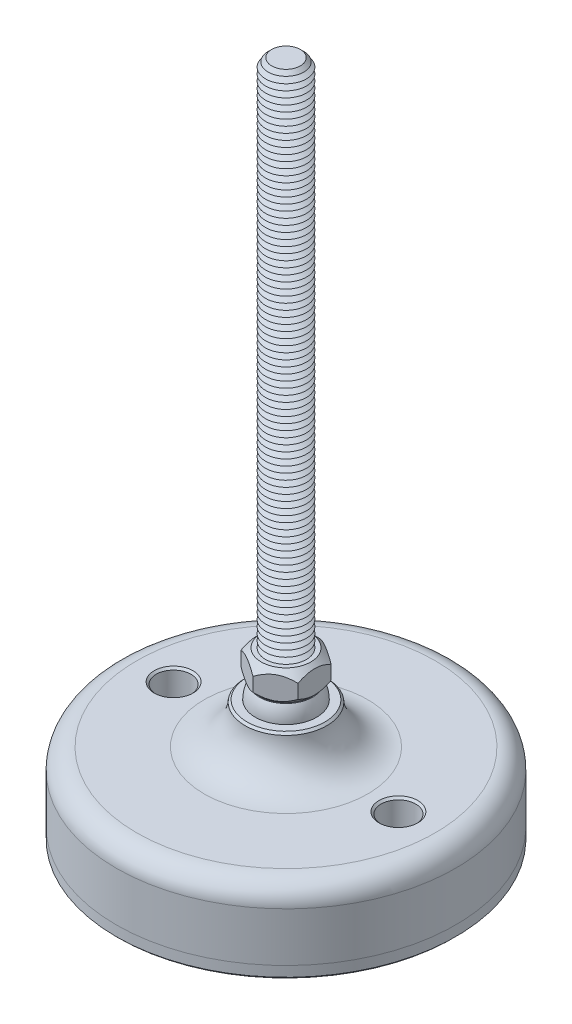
ISO-10303-21;
HEADER;
FILE_DESCRIPTION(('STEP AP214'),'2;1');
FILE_NAME('part.step','',(''),(''),'','','');
FILE_SCHEMA(('AUTOMOTIVE_DESIGN { 1 0 10303 214 1 1 1 1 }'));
ENDSEC;
DATA;
#1=APPLICATION_CONTEXT('core data for automotive mechanical design processes');
#2=APPLICATION_PROTOCOL_DEFINITION('international standard','automotive_design',2000,#1);
#3=PRODUCT_CONTEXT('',#1,'mechanical');
#4=PRODUCT('Part','Part','',(#3));
#5=PRODUCT_RELATED_PRODUCT_CATEGORY('part','',(#4));
#6=PRODUCT_DEFINITION_FORMATION('','',#4);
#7=PRODUCT_DEFINITION_CONTEXT('part definition',#1,'design');
#8=PRODUCT_DEFINITION('design','',#6,#7);
#9=PRODUCT_DEFINITION_SHAPE('','',#8);
#10=(LENGTH_UNIT() NAMED_UNIT(*) SI_UNIT(.MILLI.,.METRE.));
#11=(NAMED_UNIT(*) PLANE_ANGLE_UNIT() SI_UNIT($,.RADIAN.));
#12=(NAMED_UNIT(*) SI_UNIT($,.STERADIAN.) SOLID_ANGLE_UNIT());
#13=UNCERTAINTY_MEASURE_WITH_UNIT(LENGTH_MEASURE(1.E-05),#10,'distance_accuracy_value','');
#14=(GEOMETRIC_REPRESENTATION_CONTEXT(3) GLOBAL_UNCERTAINTY_ASSIGNED_CONTEXT((#13)) GLOBAL_UNIT_ASSIGNED_CONTEXT((#10,
#11,#12)) REPRESENTATION_CONTEXT('',''));
#15=CARTESIAN_POINT('',(0.,0.,0.));
#16=DIRECTION('',(0.,0.,1.));
#17=DIRECTION('',(1.,0.,0.));
#18=AXIS2_PLACEMENT_3D('',#15,#16,#17);
#19=CARTESIAN_POINT('',(0.,-27.,0.));
#20=DIRECTION('',(0.,1.,0.));
#21=DIRECTION('',(0.,0.,1.));
#22=AXIS2_PLACEMENT_3D('',#19,#20,#21);
#23=PLANE('',#22);
#24=CARTESIAN_POINT('',(-27.5,-27.,0.));
#25=DIRECTION('',(0.,1.,0.));
#26=DIRECTION('',(0.,0.,1.));
#27=AXIS2_PLACEMENT_3D('',#24,#25,#26);
#28=CIRCLE('',#27,4.25000000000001);
#29=CARTESIAN_POINT('',(-27.5,-27.,4.25000000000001));
#30=VERTEX_POINT('',#29);
#31=EDGE_CURVE('P0_E43',#30,#30,#28,.T.);
#32=ORIENTED_EDGE('',*,*,#31,.F.);
#33=EDGE_LOOP('',(#32));
#34=FACE_BOUND('',#33,.T.);
#35=CARTESIAN_POINT('',(27.5,-27.,0.));
#36=DIRECTION('',(0.,1.,0.));
#37=DIRECTION('',(0.,0.,1.));
#38=AXIS2_PLACEMENT_3D('',#35,#36,#37);
#39=CIRCLE('',#38,4.25000000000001);
#40=CARTESIAN_POINT('',(27.5,-27.,4.25000000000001));
#41=VERTEX_POINT('',#40);
#42=EDGE_CURVE('P0_E44',#41,#41,#39,.T.);
#43=ORIENTED_EDGE('',*,*,#42,.F.);
#44=EDGE_LOOP('',(#43));
#45=FACE_BOUND('',#44,.T.);
#46=CARTESIAN_POINT('',(0.,-27.,0.));
#47=DIRECTION('',(0.,1.,0.));
#48=DIRECTION('',(0.,0.,1.));
#49=AXIS2_PLACEMENT_3D('',#46,#47,#48);
#50=CIRCLE('',#49,41.5);
#51=CARTESIAN_POINT('',(0.,-27.,41.5));
#52=VERTEX_POINT('',#51);
#53=EDGE_CURVE('P0_E40',#52,#52,#50,.T.);
#54=ORIENTED_EDGE('',*,*,#53,.T.);
#55=EDGE_LOOP('',(#54));
#56=FACE_BOUND('',#55,.T.);
#57=ADVANCED_FACE('P0_F14',(#34,#45,#56),#23,.T.);
#58=CARTESIAN_POINT('',(0.,48.1654938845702,0.));
#59=DIRECTION('',(0.,1.,0.));
#60=DIRECTION('',(0.,0.,1.));
#61=AXIS2_PLACEMENT_3D('',#58,#59,#60);
#62=CYLINDRICAL_SURFACE('',#61,41.5);
#63=CARTESIAN_POINT('',(0.,-29.5,0.));
#64=DIRECTION('',(0.,-1.,0.));
#65=DIRECTION('',(0.,0.,-1.));
#66=AXIS2_PLACEMENT_3D('',#63,#64,#65);
#67=CIRCLE('',#66,41.5);
#68=CARTESIAN_POINT('',(0.,-29.5,-41.5));
#69=VERTEX_POINT('',#68);
#70=EDGE_CURVE('P0_E37',#69,#69,#67,.F.);
#71=ORIENTED_EDGE('',*,*,#70,.T.);
#72=EDGE_LOOP('',(#71));
#73=FACE_BOUND('',#72,.T.);
#74=ORIENTED_EDGE('',*,*,#53,.F.);
#75=EDGE_LOOP('',(#74));
#76=FACE_BOUND('',#75,.T.);
#77=ADVANCED_FACE('P0_F54',(#73,#76),#62,.T.);
#78=CARTESIAN_POINT('',(0.,-30.,41.5));
#79=DIRECTION('',(0.,-1.,0.));
#80=DIRECTION('',(0.,0.,-1.));
#81=AXIS2_PLACEMENT_3D('',#78,#79,#80);
#82=PLANE('',#81);
#83=CARTESIAN_POINT('',(27.5,-30.,0.));
#84=DIRECTION('',(0.,-1.,0.));
#85=DIRECTION('',(0.,0.,-1.));
#86=AXIS2_PLACEMENT_3D('',#83,#84,#85);
#87=CIRCLE('',#86,4.75);
#88=CARTESIAN_POINT('',(27.5,-30.,-4.75000000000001));
#89=VERTEX_POINT('',#88);
#90=EDGE_CURVE('P0_E25',#89,#89,#87,.F.);
#91=ORIENTED_EDGE('',*,*,#90,.T.);
#92=EDGE_LOOP('',(#91));
#93=FACE_BOUND('',#92,.T.);
#94=CARTESIAN_POINT('',(-27.5,-30.,0.));
#95=DIRECTION('',(0.,-1.,0.));
#96=DIRECTION('',(0.,0.,-1.));
#97=AXIS2_PLACEMENT_3D('',#94,#95,#96);
#98=CIRCLE('',#97,4.75);
#99=CARTESIAN_POINT('',(-27.5,-30.,-4.75));
#100=VERTEX_POINT('',#99);
#101=EDGE_CURVE('P0_E29',#100,#100,#98,.F.);
#102=ORIENTED_EDGE('',*,*,#101,.T.);
#103=EDGE_LOOP('',(#102));
#104=FACE_BOUND('',#103,.T.);
#105=CARTESIAN_POINT('',(0.,-30.,0.));
#106=DIRECTION('',(0.,-1.,0.));
#107=DIRECTION('',(0.,0.,-1.));
#108=AXIS2_PLACEMENT_3D('',#105,#106,#107);
#109=CIRCLE('',#108,41.);
#110=CARTESIAN_POINT('',(0.,-30.,-41.));
#111=VERTEX_POINT('',#110);
#112=EDGE_CURVE('P0_E34',#111,#111,#109,.T.);
#113=ORIENTED_EDGE('',*,*,#112,.T.);
#114=EDGE_LOOP('',(#113));
#115=FACE_BOUND('',#114,.T.);
#116=ADVANCED_FACE('P0_F61',(#93,#104,#115),#82,.T.);
#117=CARTESIAN_POINT('',(0.,-29.5,0.));
#118=DIRECTION('',(0.,1.,0.));
#119=DIRECTION('',(0.,0.,1.));
#120=AXIS2_PLACEMENT_3D('',#117,#118,#119);
#121=CONICAL_SURFACE('',#120,41.5,0.785398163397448);
#122=ORIENTED_EDGE('',*,*,#112,.F.);
#123=EDGE_LOOP('',(#122));
#124=FACE_BOUND('',#123,.T.);
#125=ORIENTED_EDGE('',*,*,#70,.F.);
#126=EDGE_LOOP('',(#125));
#127=FACE_BOUND('',#126,.T.);
#128=ADVANCED_FACE('P0_F68',(#124,#127),#121,.T.);
#129=CARTESIAN_POINT('',(27.5,-30.,0.));
#130=DIRECTION('',(0.,1.,0.));
#131=DIRECTION('',(0.,0.,1.));
#132=AXIS2_PLACEMENT_3D('',#129,#130,#131);
#133=CYLINDRICAL_SURFACE('',#132,4.25000000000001);
#134=CARTESIAN_POINT('',(27.5,-29.5,0.));
#135=DIRECTION('',(0.,-1.,0.));
#136=DIRECTION('',(0.,0.,-1.));
#137=AXIS2_PLACEMENT_3D('',#134,#135,#136);
#138=CIRCLE('',#137,4.25000000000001);
#139=CARTESIAN_POINT('',(27.5,-29.5,-4.25000000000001));
#140=VERTEX_POINT('',#139);
#141=EDGE_CURVE('P0_E21',#140,#140,#138,.T.);
#142=ORIENTED_EDGE('',*,*,#141,.T.);
#143=EDGE_LOOP('',(#142));
#144=FACE_BOUND('',#143,.T.);
#145=ORIENTED_EDGE('',*,*,#42,.T.);
#146=EDGE_LOOP('',(#145));
#147=FACE_BOUND('',#146,.T.);
#148=ADVANCED_FACE('P0_F74',(#144,#147),#133,.F.);
#149=CARTESIAN_POINT('',(-27.5,-30.,0.));
#150=DIRECTION('',(0.,1.,0.));
#151=DIRECTION('',(0.,0.,1.));
#152=AXIS2_PLACEMENT_3D('',#149,#150,#151);
#153=CYLINDRICAL_SURFACE('',#152,4.25000000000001);
#154=CARTESIAN_POINT('',(-27.5,-29.5,0.));
#155=DIRECTION('',(0.,-1.,0.));
#156=DIRECTION('',(0.,0.,-1.));
#157=AXIS2_PLACEMENT_3D('',#154,#155,#156);
#158=CIRCLE('',#157,4.25000000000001);
#159=CARTESIAN_POINT('',(-27.5,-29.5,-4.25000000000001));
#160=VERTEX_POINT('',#159);
#161=EDGE_CURVE('P0_E10',#160,#160,#158,.T.);
#162=ORIENTED_EDGE('',*,*,#161,.T.);
#163=EDGE_LOOP('',(#162));
#164=FACE_BOUND('',#163,.T.);
#165=ORIENTED_EDGE('',*,*,#31,.T.);
#166=EDGE_LOOP('',(#165));
#167=FACE_BOUND('',#166,.T.);
#168=ADVANCED_FACE('P0_F50',(#164,#167),#153,.F.);
#169=CARTESIAN_POINT('',(27.5,-30.,0.));
#170=DIRECTION('',(0.,-1.,0.));
#171=DIRECTION('',(0.,0.,-1.));
#172=AXIS2_PLACEMENT_3D('',#169,#170,#171);
#173=CONICAL_SURFACE('',#172,4.75,0.785398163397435);
#174=ORIENTED_EDGE('',*,*,#141,.F.);
#175=EDGE_LOOP('',(#174));
#176=FACE_BOUND('',#175,.T.);
#177=ORIENTED_EDGE('',*,*,#90,.F.);
#178=EDGE_LOOP('',(#177));
#179=FACE_BOUND('',#178,.T.);
#180=ADVANCED_FACE('P0_F76',(#176,#179),#173,.F.);
#181=CARTESIAN_POINT('',(-27.5,-30.,0.));
#182=DIRECTION('',(0.,-1.,0.));
#183=DIRECTION('',(0.,0.,-1.));
#184=AXIS2_PLACEMENT_3D('',#181,#182,#183);
#185=CONICAL_SURFACE('',#184,4.75,0.785398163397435);
#186=ORIENTED_EDGE('',*,*,#161,.F.);
#187=EDGE_LOOP('',(#186));
#188=FACE_BOUND('',#187,.T.);
#189=ORIENTED_EDGE('',*,*,#101,.F.);
#190=EDGE_LOOP('',(#189));
#191=FACE_BOUND('',#190,.T.);
#192=ADVANCED_FACE('P0_F16',(#188,#191),#185,.F.);
#193=CLOSED_SHELL('',(#57,#77,#116,#128,#148,#168,#180,#192));
#194=MANIFOLD_SOLID_BREP('P0_B1',#193);
#195=CARTESIAN_POINT('',(0.,0.,0.));
#196=DIRECTION('',(0.,1.,0.));
#197=DIRECTION('',(0.,0.,-1.));
#198=AXIS2_PLACEMENT_3D('',#195,#196,#197);
#199=SPHERICAL_SURFACE('',#198,7.5);
#200=CARTESIAN_POINT('',(0.,3.75,0.));
#201=DIRECTION('',(0.,-1.,0.));
#202=DIRECTION('',(0.,0.,-1.));
#203=AXIS2_PLACEMENT_3D('',#200,#201,#202);
#204=CIRCLE('',#203,6.49519052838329);
#205=CARTESIAN_POINT('',(0.,3.75,-6.49519052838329));
#206=VERTEX_POINT('',#205);
#207=EDGE_CURVE('P1_E211',#206,#206,#204,.F.);
#208=ORIENTED_EDGE('',*,*,#207,.F.);
#209=EDGE_LOOP('',(#208));
#210=FACE_BOUND('',#209,.T.);
#211=ADVANCED_FACE('P1_F16',(#210),#199,.T.);
#212=CARTESIAN_POINT('',(0.,3.75,0.));
#213=DIRECTION('',(0.,1.,0.));
#214=DIRECTION('',(0.,0.,1.));
#215=AXIS2_PLACEMENT_3D('',#212,#213,#214);
#216=CONICAL_SURFACE('',#215,6.26419292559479,0.785398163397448);
#217=CARTESIAN_POINT('',(0.,3.75,0.));
#218=DIRECTION('',(0.,1.,0.));
#219=DIRECTION('',(0.,0.,1.));
#220=AXIS2_PLACEMENT_3D('',#217,#218,#219);
#221=CIRCLE('',#220,6.26419292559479);
#222=CARTESIAN_POINT('',(0.,3.75,6.26419292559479));
#223=VERTEX_POINT('',#222);
#224=EDGE_CURVE('P1_E215',#223,#223,#221,.T.);
#225=ORIENTED_EDGE('',*,*,#224,.T.);
#226=EDGE_LOOP('',(#225));
#227=FACE_BOUND('',#226,.T.);
#228=CARTESIAN_POINT('',(-7.,8.22175145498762,-8.1400553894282));
#229=CARTESIAN_POINT('',(-7.,8.07177748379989,-7.94220937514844));
#230=CARTESIAN_POINT('',(-7.,7.92322959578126,-7.74326459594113));
#231=CARTESIAN_POINT('',(-7.,7.62962733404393,-7.34274065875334));
#232=CARTESIAN_POINT('',(-7.,7.48457383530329,-7.14116086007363));
#233=CARTESIAN_POINT('',(-7.,7.19756981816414,-6.73345531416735));
#234=CARTESIAN_POINT('',(-7.,7.05565202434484,-6.52730645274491));
#235=CARTESIAN_POINT('',(-7.,6.77703382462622,-6.11152362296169));
#236=CARTESIAN_POINT('',(-7.,6.64033305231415,-5.90188990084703));
#237=CARTESIAN_POINT('',(-7.,6.36550740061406,-5.46619755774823));
#238=CARTESIAN_POINT('',(-7.,6.22776674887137,-5.23989534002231));
#239=CARTESIAN_POINT('',(-7.,5.96123372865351,-4.78200028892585));
#240=CARTESIAN_POINT('',(-7.,5.83244279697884,-4.55040661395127));
#241=CARTESIAN_POINT('',(-7.,5.58658047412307,-4.08193183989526));
#242=CARTESIAN_POINT('',(-7.,5.46947462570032,-3.8450689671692));
#243=CARTESIAN_POINT('',(-7.,5.24960465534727,-3.36483104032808));
#244=CARTESIAN_POINT('',(-7.,5.14683397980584,-3.12145902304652));
#245=CARTESIAN_POINT('',(-7.,4.96723655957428,-2.64866791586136));
#246=CARTESIAN_POINT('',(-7.,4.88895097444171,-2.41980876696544));
#247=CARTESIAN_POINT('',(-7.,4.75072959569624,-1.9565107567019));
#248=CARTESIAN_POINT('',(-7.,4.69079504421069,-1.72207151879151));
#249=CARTESIAN_POINT('',(-7.,4.59342684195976,-1.25295119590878));
#250=CARTESIAN_POINT('',(-7.,4.5556027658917,-1.01835249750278));
#251=CARTESIAN_POINT('',(-7.,4.50320231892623,-0.546559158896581));
#252=CARTESIAN_POINT('',(-7.,4.48862178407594,-0.309364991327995));
#253=CARTESIAN_POINT('',(-7.,4.48382612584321,0.156313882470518));
#254=CARTESIAN_POINT('',(-7.,4.49271264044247,0.384789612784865));
#255=CARTESIAN_POINT('',(-7.,4.53235928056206,0.839822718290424));
#256=CARTESIAN_POINT('',(-7.,4.56312150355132,1.06637990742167));
#257=CARTESIAN_POINT('',(-7.,4.64535130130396,1.51976805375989));
#258=CARTESIAN_POINT('',(-7.,4.69717402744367,1.74653354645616));
#259=CARTESIAN_POINT('',(-7.,4.81873728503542,2.19511331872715));
#260=CARTESIAN_POINT('',(-7.,4.88847641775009,2.41692798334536));
#261=CARTESIAN_POINT('',(-7.,5.04951755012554,2.87389766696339));
#262=CARTESIAN_POINT('',(-7.,5.14215063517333,3.10857869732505));
#263=CARTESIAN_POINT('',(-7.,5.3416605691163,3.57185972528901));
#264=CARTESIAN_POINT('',(-7.,5.44854400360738,3.80045685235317));
#265=CARTESIAN_POINT('',(-7.,5.6740138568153,4.25267813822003));
#266=CARTESIAN_POINT('',(-7.,5.79263686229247,4.47628390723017));
#267=CARTESIAN_POINT('',(-7.,6.03896666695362,4.91835509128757));
#268=CARTESIAN_POINT('',(-7.,6.16667203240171,5.13682131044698));
#269=CARTESIAN_POINT('',(-7.,6.4228595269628,5.55855563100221));
#270=CARTESIAN_POINT('',(-7.,6.55098806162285,5.76203966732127));
#271=CARTESIAN_POINT('',(-7.,6.81264959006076,6.16551366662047));
#272=CARTESIAN_POINT('',(-7.,6.94618299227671,6.36550336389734));
#273=CARTESIAN_POINT('',(-7.,7.21658951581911,6.76082742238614));
#274=CARTESIAN_POINT('',(-7.,7.35342681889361,6.95618637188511));
#275=CARTESIAN_POINT('',(-7.,7.6307324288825,7.34423185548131));
#276=CARTESIAN_POINT('',(-7.,7.77119972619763,7.53691911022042));
#277=CARTESIAN_POINT('',(-7.,7.91315155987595,7.72848711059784));
#278=B_SPLINE_CURVE_WITH_KNOTS('',3,(#228,#229,#230,#231,#232,#233,#234,#235,#236,#237,#238,
#239,#240,#241,#242,#243,#244,#245,#246,#247,#248,#249,#250,#251,#252,#253,#254,#255,#256,#257,
#258,#259,#260,#261,#262,#263,#264,#265,#266,#267,#268,#269,#270,#271,#272,#273,#274,#275,#276,
#277),.UNSPECIFIED.,.F.,.F.,(4,2,2,2,2,2,2,2,2,2,2,2,2,2,2,2,2,2,2,2,2,2,2,2,4),(0.,
0.744807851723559,1.48980030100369,2.2405614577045,2.99126978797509,3.78587980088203,
4.58061708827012,5.37293691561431,6.16489332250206,6.88989369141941,7.61494312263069,
8.32676947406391,9.0384682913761,9.72332048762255,10.4082383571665,11.1052200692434,
11.8021473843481,12.5584650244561,13.3151334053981,14.0742390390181,14.8332251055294,
15.5545151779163,16.2758598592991,16.9913609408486,17.7066651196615),.UNSPECIFIED.);
#279=CARTESIAN_POINT('',(-7.,5.56871084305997,-4.04145188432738));
#280=VERTEX_POINT('',#279);
#281=CARTESIAN_POINT('',(-7.,5.56871084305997,4.04145188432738));
#282=VERTEX_POINT('',#281);
#283=EDGE_CURVE('P1_E25',#280,#282,#278,.T.);
#284=ORIENTED_EDGE('',*,*,#283,.F.);
#285=CARTESIAN_POINT('',(0.000199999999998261,5.56882631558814,-8.0830192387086));
#286=CARTESIAN_POINT('',(-0.120159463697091,5.49934419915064,-8.01352966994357));
#287=CARTESIAN_POINT('',(-0.241444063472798,5.43199440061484,-7.94350597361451));
#288=CARTESIAN_POINT('',(-0.486045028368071,5.30220807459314,-7.80228554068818));
#289=CARTESIAN_POINT('',(-0.60936245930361,5.2397742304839,-7.73108818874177));
#290=CARTESIAN_POINT('',(-0.983781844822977,5.06028719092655,-7.51491705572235));
#291=CARTESIAN_POINT('',(-1.23805341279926,4.95181416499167,-7.36811329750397));
#292=CARTESIAN_POINT('',(-1.75081233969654,4.76606165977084,-7.07207179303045));
#293=CARTESIAN_POINT('',(-2.00916864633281,4.68831421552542,-6.92290970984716));
#294=CARTESIAN_POINT('',(-2.40095049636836,4.59837958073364,-6.69671435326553));
#295=CARTESIAN_POINT('',(-2.53212124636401,4.57286115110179,-6.62098288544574));
#296=CARTESIAN_POINT('',(-2.79557335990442,4.53129725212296,-6.4688787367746));
#297=CARTESIAN_POINT('',(-2.92785455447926,4.5152503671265,-6.39250615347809));
#298=CARTESIAN_POINT('',(-3.25020698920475,4.48834537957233,-6.2063958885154));
#299=CARTESIAN_POINT('',(-3.44062555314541,4.48270029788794,-6.09645767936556));
#300=CARTESIAN_POINT('',(-3.82111946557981,4.49217587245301,-5.87677941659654));
#301=CARTESIAN_POINT('',(-4.01119467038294,4.5073038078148,-5.76703944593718));
#302=CARTESIAN_POINT('',(-4.38955306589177,4.55743368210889,-5.54859412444));
#303=CARTESIAN_POINT('',(-4.57783401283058,4.5924578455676,-5.43989006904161));
#304=CARTESIAN_POINT('',(-4.95115981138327,4.68047604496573,-5.22435031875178));
#305=CARTESIAN_POINT('',(-5.13620490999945,4.73346870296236,-5.1175144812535));
#306=CARTESIAN_POINT('',(-5.46469033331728,4.84248989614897,-4.92786333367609));
#307=CARTESIAN_POINT('',(-5.6088580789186,4.89565100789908,-4.8446280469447));
#308=CARTESIAN_POINT('',(-5.8946056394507,5.0105398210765,-4.67965161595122));
#309=CARTESIAN_POINT('',(-6.03618537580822,5.07226778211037,-4.5979105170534));
#310=CARTESIAN_POINT('',(-6.31631098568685,5.20290661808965,-4.43617992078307));
#311=CARTESIAN_POINT('',(-6.4548648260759,5.27179490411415,-4.3561858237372));
#312=CARTESIAN_POINT('',(-6.72940692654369,5.41585000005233,-4.19767886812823));
#313=CARTESIAN_POINT('',(-6.86539669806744,5.49101295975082,-4.11916513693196));
#314=CARTESIAN_POINT('',(-7.0002,5.56882631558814,-4.04133641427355));
#315=B_SPLINE_CURVE_WITH_KNOTS('',3,(#285,#286,#287,#288,#289,#290,#291,#292,#293,#294,#295,
#296,#297,#298,#299,#300,#301,#302,#303,#304,#305,#306,#307,#308,#309,#310,#311,#312,#313,#314),
.UNSPECIFIED.,.F.,.F.,(4,2,2,2,2,2,2,2,2,2,2,2,2,2,4),(0.,0.466112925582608,0.932478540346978,
1.87024464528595,2.79312018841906,3.25365289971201,3.71411676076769,4.37293813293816,
5.03199042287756,5.69178034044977,6.35151967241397,6.8755322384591,7.39956068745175,
7.92198344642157,8.44408796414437),.UNSPECIFIED.);
#316=CARTESIAN_POINT('',(0.,5.56871084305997,-8.08290376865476));
#317=VERTEX_POINT('',#316);
#318=EDGE_CURVE('P1_E116',#317,#280,#315,.T.);
#319=ORIENTED_EDGE('',*,*,#318,.F.);
#320=CARTESIAN_POINT('',(7.00019999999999,5.56882631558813,-4.04133641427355));
#321=CARTESIAN_POINT('',(6.8798405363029,5.49934419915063,-4.11082598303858));
#322=CARTESIAN_POINT('',(6.7585559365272,5.43199440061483,-4.18084967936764));
#323=CARTESIAN_POINT('',(6.51395497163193,5.30220807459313,-4.32207011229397));
#324=CARTESIAN_POINT('',(6.39063754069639,5.2397742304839,-4.39326746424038));
#325=CARTESIAN_POINT('',(6.01621815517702,5.06028719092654,-4.6094385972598));
#326=CARTESIAN_POINT('',(5.76194658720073,4.95181416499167,-4.75624235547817));
#327=CARTESIAN_POINT('',(5.24918766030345,4.76606165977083,-5.0522838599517));
#328=CARTESIAN_POINT('',(4.99083135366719,4.68831421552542,-5.20144594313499));
#329=CARTESIAN_POINT('',(4.59904950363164,4.59837958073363,-5.42764129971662));
#330=CARTESIAN_POINT('',(4.46787875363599,4.57286115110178,-5.50337276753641));
#331=CARTESIAN_POINT('',(4.20442664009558,4.53129725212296,-5.65547691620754));
#332=CARTESIAN_POINT('',(4.07214544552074,4.5152503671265,-5.73184949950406));
#333=CARTESIAN_POINT('',(3.74979301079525,4.48834537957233,-5.91795976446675));
#334=CARTESIAN_POINT('',(3.55937444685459,4.48270029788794,-6.02789797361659));
#335=CARTESIAN_POINT('',(3.17888053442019,4.49217587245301,-6.2475762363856));
#336=CARTESIAN_POINT('',(2.98880532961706,4.5073038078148,-6.35731620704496));
#337=CARTESIAN_POINT('',(2.61044693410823,4.55743368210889,-6.57576152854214));
#338=CARTESIAN_POINT('',(2.42216598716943,4.5924578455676,-6.68446558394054));
#339=CARTESIAN_POINT('',(2.04884018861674,4.68047604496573,-6.90000533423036));
#340=CARTESIAN_POINT('',(1.86379509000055,4.73346870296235,-7.00684117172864));
#341=CARTESIAN_POINT('',(1.53530966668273,4.84248989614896,-7.19649231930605));
#342=CARTESIAN_POINT('',(1.3911419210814,4.89565100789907,-7.27972760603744));
#343=CARTESIAN_POINT('',(1.1053943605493,5.0105398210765,-7.44470403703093));
#344=CARTESIAN_POINT('',(0.96381462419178,5.07226778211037,-7.52644513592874));
#345=CARTESIAN_POINT('',(0.683689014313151,5.20290661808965,-7.68817573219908));
#346=CARTESIAN_POINT('',(0.545135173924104,5.27179490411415,-7.76816982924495));
#347=CARTESIAN_POINT('',(0.270593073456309,5.41585000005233,-7.92667678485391));
#348=CARTESIAN_POINT('',(0.134603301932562,5.49101295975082,-8.00519051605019));
#349=CARTESIAN_POINT('',(-0.00020000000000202,5.56882631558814,-8.0830192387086));
#350=B_SPLINE_CURVE_WITH_KNOTS('',3,(#320,#321,#322,#323,#324,#325,#326,#327,#328,#329,#330,
#331,#332,#333,#334,#335,#336,#337,#338,#339,#340,#341,#342,#343,#344,#345,#346,#347,#348,#349),
.UNSPECIFIED.,.F.,.F.,(4,2,2,2,2,2,2,2,2,2,2,2,2,2,4),(0.,0.466112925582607,0.932478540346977,
1.87024464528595,2.79312018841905,3.25365289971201,3.71411676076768,4.37293813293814,
5.03199042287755,5.69178034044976,6.35151967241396,6.87553223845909,7.39956068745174,
7.92198344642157,8.44408796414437),.UNSPECIFIED.);
#351=CARTESIAN_POINT('',(7.,5.56871084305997,-4.04145188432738));
#352=VERTEX_POINT('',#351);
#353=EDGE_CURVE('P1_E123',#352,#317,#350,.T.);
#354=ORIENTED_EDGE('',*,*,#353,.F.);
#355=CARTESIAN_POINT('',(6.99999999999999,8.22175145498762,-8.1400553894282));
#356=CARTESIAN_POINT('',(6.99999999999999,8.07177748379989,-7.94220937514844));
#357=CARTESIAN_POINT('',(6.99999999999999,7.92322959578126,-7.74326459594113));
#358=CARTESIAN_POINT('',(6.99999999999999,7.62962733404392,-7.34274065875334));
#359=CARTESIAN_POINT('',(6.99999999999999,7.48457383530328,-7.14116086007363));
#360=CARTESIAN_POINT('',(6.99999999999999,7.19756981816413,-6.73345531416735));
#361=CARTESIAN_POINT('',(6.99999999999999,7.05565202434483,-6.52730645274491));
#362=CARTESIAN_POINT('',(6.99999999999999,6.77703382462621,-6.11152362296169));
#363=CARTESIAN_POINT('',(6.99999999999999,6.64033305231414,-5.90188990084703));
#364=CARTESIAN_POINT('',(6.99999999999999,6.36550740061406,-5.46619755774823));
#365=CARTESIAN_POINT('',(6.99999999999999,6.22776674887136,-5.23989534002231));
#366=CARTESIAN_POINT('',(6.99999999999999,5.9612337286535,-4.78200028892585));
#367=CARTESIAN_POINT('',(6.99999999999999,5.83244279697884,-4.55040661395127));
#368=CARTESIAN_POINT('',(6.99999999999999,5.58658047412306,-4.08193183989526));
#369=CARTESIAN_POINT('',(6.99999999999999,5.46947462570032,-3.8450689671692));
#370=CARTESIAN_POINT('',(6.99999999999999,5.24960465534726,-3.36483104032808));
#371=CARTESIAN_POINT('',(6.99999999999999,5.14683397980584,-3.12145902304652));
#372=CARTESIAN_POINT('',(6.99999999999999,4.96723655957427,-2.64866791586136));
#373=CARTESIAN_POINT('',(6.99999999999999,4.88895097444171,-2.41980876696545));
#374=CARTESIAN_POINT('',(6.99999999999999,4.75072959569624,-1.9565107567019));
#375=CARTESIAN_POINT('',(6.99999999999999,4.69079504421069,-1.72207151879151));
#376=CARTESIAN_POINT('',(6.99999999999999,4.59342684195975,-1.25295119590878));
#377=CARTESIAN_POINT('',(6.99999999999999,4.5556027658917,-1.01835249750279));
#378=CARTESIAN_POINT('',(6.99999999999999,4.50320231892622,-0.546559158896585));
#379=CARTESIAN_POINT('',(6.99999999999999,4.48862178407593,-0.309364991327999));
#380=CARTESIAN_POINT('',(6.99999999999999,4.48382612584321,0.156313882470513));
#381=CARTESIAN_POINT('',(6.99999999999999,4.49271264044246,0.38478961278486));
#382=CARTESIAN_POINT('',(6.99999999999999,4.53235928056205,0.83982271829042));
#383=CARTESIAN_POINT('',(6.99999999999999,4.56312150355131,1.06637990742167));
#384=CARTESIAN_POINT('',(6.99999999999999,4.64535130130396,1.51976805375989));
#385=CARTESIAN_POINT('',(6.99999999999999,4.69717402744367,1.74653354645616));
#386=CARTESIAN_POINT('',(6.99999999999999,4.81873728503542,2.19511331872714));
#387=CARTESIAN_POINT('',(7.,4.88847641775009,2.41692798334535));
#388=CARTESIAN_POINT('',(7.,5.04951755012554,2.87389766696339));
#389=CARTESIAN_POINT('',(7.,5.14215063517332,3.10857869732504));
#390=CARTESIAN_POINT('',(7.,5.34166056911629,3.571859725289));
#391=CARTESIAN_POINT('',(7.,5.44854400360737,3.80045685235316));
#392=CARTESIAN_POINT('',(7.,5.67401385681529,4.25267813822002));
#393=CARTESIAN_POINT('',(7.,5.79263686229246,4.47628390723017));
#394=CARTESIAN_POINT('',(7.,6.03896666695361,4.91835509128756));
#395=CARTESIAN_POINT('',(7.,6.1666720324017,5.13682131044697));
#396=CARTESIAN_POINT('',(7.,6.42285952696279,5.5585556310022));
#397=CARTESIAN_POINT('',(7.,6.55098806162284,5.76203966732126));
#398=CARTESIAN_POINT('',(7.,6.81264959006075,6.16551366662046));
#399=CARTESIAN_POINT('',(7.,6.9461829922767,6.36550336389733));
#400=CARTESIAN_POINT('',(7.,7.21658951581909,6.76082742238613));
#401=CARTESIAN_POINT('',(7.,7.3534268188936,6.9561863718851));
#402=CARTESIAN_POINT('',(7.,7.63073242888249,7.3442318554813));
#403=CARTESIAN_POINT('',(7.,7.77119972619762,7.53691911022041));
#404=CARTESIAN_POINT('',(7.,7.91315155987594,7.72848711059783));
#405=B_SPLINE_CURVE_WITH_KNOTS('',3,(#355,#356,#357,#358,#359,#360,#361,#362,#363,#364,#365,
#366,#367,#368,#369,#370,#371,#372,#373,#374,#375,#376,#377,#378,#379,#380,#381,#382,#383,#384,
#385,#386,#387,#388,#389,#390,#391,#392,#393,#394,#395,#396,#397,#398,#399,#400,#401,#402,#403,
#404),.UNSPECIFIED.,.F.,.F.,(4,2,2,2,2,2,2,2,2,2,2,2,2,2,2,2,2,2,2,2,2,2,2,2,4),(0.,
0.744807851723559,1.48980030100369,2.2405614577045,2.9912697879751,3.78587980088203,
4.58061708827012,5.3729369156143,6.16489332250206,6.8898936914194,7.61494312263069,
8.32676947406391,9.03846829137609,9.72332048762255,10.4082383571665,11.1052200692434,
11.8021473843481,12.5584650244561,13.3151334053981,14.0742390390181,14.8332251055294,
15.5545151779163,16.275859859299,16.9913609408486,17.7066651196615),.UNSPECIFIED.);
#406=CARTESIAN_POINT('',(6.99999999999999,5.56871084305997,4.04145188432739));
#407=VERTEX_POINT('',#406);
#408=EDGE_CURVE('P1_E71',#407,#352,#405,.F.);
#409=ORIENTED_EDGE('',*,*,#408,.F.);
#410=CARTESIAN_POINT('',(-0.000200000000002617,5.56882631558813,8.0830192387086));
#411=CARTESIAN_POINT('',(0.120159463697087,5.49934419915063,8.01352966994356));
#412=CARTESIAN_POINT('',(0.241444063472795,5.43199440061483,7.9435059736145));
#413=CARTESIAN_POINT('',(0.486045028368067,5.30220807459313,7.80228554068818));
#414=CARTESIAN_POINT('',(0.609362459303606,5.2397742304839,7.73108818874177));
#415=CARTESIAN_POINT('',(0.983781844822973,5.06028719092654,7.51491705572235));
#416=CARTESIAN_POINT('',(1.23805341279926,4.95181416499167,7.36811329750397));
#417=CARTESIAN_POINT('',(1.75081233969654,4.76606165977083,7.07207179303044));
#418=CARTESIAN_POINT('',(2.00916864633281,4.68831421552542,6.92290970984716));
#419=CARTESIAN_POINT('',(2.40095049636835,4.59837958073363,6.69671435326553));
#420=CARTESIAN_POINT('',(2.53212124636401,4.57286115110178,6.62098288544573));
#421=CARTESIAN_POINT('',(2.79557335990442,4.53129725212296,6.4688787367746));
#422=CARTESIAN_POINT('',(2.92785455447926,4.5152503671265,6.39250615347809));
#423=CARTESIAN_POINT('',(3.25020698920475,4.48834537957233,6.2063958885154));
#424=CARTESIAN_POINT('',(3.44062555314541,4.48270029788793,6.09645767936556));
#425=CARTESIAN_POINT('',(3.82111946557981,4.492175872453,5.87677941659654));
#426=CARTESIAN_POINT('',(4.01119467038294,4.5073038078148,5.76703944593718));
#427=CARTESIAN_POINT('',(4.38955306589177,4.55743368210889,5.54859412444));
#428=CARTESIAN_POINT('',(4.57783401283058,4.5924578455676,5.4398900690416));
#429=CARTESIAN_POINT('',(4.95115981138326,4.68047604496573,5.22435031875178));
#430=CARTESIAN_POINT('',(5.13620490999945,4.73346870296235,5.1175144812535));
#431=CARTESIAN_POINT('',(5.46469033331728,4.84248989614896,4.92786333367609));
#432=CARTESIAN_POINT('',(5.6088580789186,4.89565100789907,4.8446280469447));
#433=CARTESIAN_POINT('',(5.8946056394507,5.01053982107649,4.67965161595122));
#434=CARTESIAN_POINT('',(6.03618537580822,5.07226778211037,4.5979105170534));
#435=CARTESIAN_POINT('',(6.31631098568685,5.20290661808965,4.43617992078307));
#436=CARTESIAN_POINT('',(6.45486482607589,5.27179490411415,4.3561858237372));
#437=CARTESIAN_POINT('',(6.72940692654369,5.41585000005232,4.19767886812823));
#438=CARTESIAN_POINT('',(6.86539669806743,5.49101295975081,4.11916513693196));
#439=CARTESIAN_POINT('',(7.00019999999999,5.56882631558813,4.04133641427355));
#440=B_SPLINE_CURVE_WITH_KNOTS('',3,(#410,#411,#412,#413,#414,#415,#416,#417,#418,#419,#420,
#421,#422,#423,#424,#425,#426,#427,#428,#429,#430,#431,#432,#433,#434,#435,#436,#437,#438,#439),
.UNSPECIFIED.,.F.,.F.,(4,2,2,2,2,2,2,2,2,2,2,2,2,2,4),(0.,0.466112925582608,0.932478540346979,
1.87024464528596,2.79312018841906,3.25365289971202,3.71411676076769,4.37293813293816,
5.03199042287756,5.69178034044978,6.35151967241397,6.8755322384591,7.39956068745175,
7.92198344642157,8.44408796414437),.UNSPECIFIED.);
#441=CARTESIAN_POINT('',(0.,5.56871084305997,8.08290376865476));
#442=VERTEX_POINT('',#441);
#443=EDGE_CURVE('P1_E68',#442,#407,#440,.T.);
#444=ORIENTED_EDGE('',*,*,#443,.F.);
#445=CARTESIAN_POINT('',(-7.0002,5.56882631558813,4.04133641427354));
#446=CARTESIAN_POINT('',(-6.87984053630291,5.49934419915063,4.11082598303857));
#447=CARTESIAN_POINT('',(-6.7585559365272,5.43199440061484,4.18084967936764));
#448=CARTESIAN_POINT('',(-6.51395497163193,5.30220807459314,4.32207011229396));
#449=CARTESIAN_POINT('',(-6.39063754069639,5.2397742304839,4.39326746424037));
#450=CARTESIAN_POINT('',(-6.01621815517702,5.06028719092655,4.60943859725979));
#451=CARTESIAN_POINT('',(-5.76194658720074,4.95181416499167,4.75624235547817));
#452=CARTESIAN_POINT('',(-5.24918766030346,4.76606165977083,5.0522838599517));
#453=CARTESIAN_POINT('',(-4.99083135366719,4.68831421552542,5.20144594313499));
#454=CARTESIAN_POINT('',(-4.59904950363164,4.59837958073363,5.42764129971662));
#455=CARTESIAN_POINT('',(-4.46787875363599,4.57286115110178,5.50337276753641));
#456=CARTESIAN_POINT('',(-4.20442664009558,4.53129725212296,5.65547691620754));
#457=CARTESIAN_POINT('',(-4.07214544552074,4.5152503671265,5.73184949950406));
#458=CARTESIAN_POINT('',(-3.74979301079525,4.48834537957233,5.91795976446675));
#459=CARTESIAN_POINT('',(-3.55937444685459,4.48270029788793,6.02789797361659));
#460=CARTESIAN_POINT('',(-3.17888053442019,4.492175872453,6.2475762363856));
#461=CARTESIAN_POINT('',(-2.98880532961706,4.5073038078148,6.35731620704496));
#462=CARTESIAN_POINT('',(-2.61044693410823,4.55743368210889,6.57576152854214));
#463=CARTESIAN_POINT('',(-2.42216598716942,4.5924578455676,6.68446558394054));
#464=CARTESIAN_POINT('',(-2.04884018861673,4.68047604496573,6.90000533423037));
#465=CARTESIAN_POINT('',(-1.86379509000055,4.73346870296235,7.00684117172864));
#466=CARTESIAN_POINT('',(-1.53530966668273,4.84248989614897,7.19649231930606));
#467=CARTESIAN_POINT('',(-1.3911419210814,4.89565100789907,7.27972760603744));
#468=CARTESIAN_POINT('',(-1.1053943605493,5.01053982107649,7.44470403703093));
#469=CARTESIAN_POINT('',(-0.963814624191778,5.07226778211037,7.52644513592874));
#470=CARTESIAN_POINT('',(-0.683689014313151,5.20290661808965,7.68817573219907));
#471=CARTESIAN_POINT('',(-0.545135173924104,5.27179490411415,7.76816982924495));
#472=CARTESIAN_POINT('',(-0.270593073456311,5.41585000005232,7.92667678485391));
#473=CARTESIAN_POINT('',(-0.134603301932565,5.49101295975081,8.00519051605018));
#474=CARTESIAN_POINT('',(0.000199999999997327,5.56882631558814,8.0830192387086));
#475=B_SPLINE_CURVE_WITH_KNOTS('',3,(#445,#446,#447,#448,#449,#450,#451,#452,#453,#454,#455,
#456,#457,#458,#459,#460,#461,#462,#463,#464,#465,#466,#467,#468,#469,#470,#471,#472,#473,#474),
.UNSPECIFIED.,.F.,.F.,(4,2,2,2,2,2,2,2,2,2,2,2,2,2,4),(0.,0.466112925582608,0.93247854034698,
1.87024464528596,2.79312018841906,3.25365289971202,3.71411676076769,4.37293813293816,
5.03199042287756,5.69178034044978,6.35151967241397,6.8755322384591,7.39956068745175,
7.92198344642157,8.44408796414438),.UNSPECIFIED.);
#476=EDGE_CURVE('P1_E40',#282,#442,#475,.T.);
#477=ORIENTED_EDGE('',*,*,#476,.F.);
#478=EDGE_LOOP('',(#284,#319,#354,#409,#444,#477));
#479=FACE_BOUND('',#478,.T.);
#480=ADVANCED_FACE('P1_F69',(#227,#479),#216,.T.);
#481=CARTESIAN_POINT('',(0.,3.75,6.26419292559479));
#482=DIRECTION('',(0.,-1.,0.));
#483=DIRECTION('',(0.,0.,-1.));
#484=AXIS2_PLACEMENT_3D('',#481,#482,#483);
#485=PLANE('',#484);
#486=ORIENTED_EDGE('',*,*,#207,.T.);
#487=EDGE_LOOP('',(#486));
#488=FACE_BOUND('',#487,.T.);
#489=ORIENTED_EDGE('',*,*,#224,.F.);
#490=EDGE_LOOP('',(#489));
#491=FACE_BOUND('',#490,.T.);
#492=ADVANCED_FACE('P1_F107',(#488,#491),#485,.F.);
#493=CARTESIAN_POINT('',(-7.,11.,4.04145188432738));
#494=DIRECTION('',(0.5,0.,-0.866025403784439));
#495=DIRECTION('',(-0.866025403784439,0.,-0.5));
#496=AXIS2_PLACEMENT_3D('',#493,#494,#495);
#497=PLANE('',#496);
#498=DIRECTION('',(0.,-1.,0.));
#499=VECTOR('',#498,1.);
#500=CARTESIAN_POINT('',(0.,11.,8.08290376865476));
#501=LINE('',#500,#499);
#502=CARTESIAN_POINT('',(0.,8.97927405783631,8.08290376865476));
#503=VERTEX_POINT('',#502);
#504=EDGE_CURVE('P1_E82',#503,#442,#501,.T.);
#505=ORIENTED_EDGE('',*,*,#504,.F.);
#506=CARTESIAN_POINT('',(0.000199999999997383,8.97915858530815,8.0830192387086));
#507=CARTESIAN_POINT('',(-0.120159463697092,9.04864070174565,8.01352966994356));
#508=CARTESIAN_POINT('',(-0.241444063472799,9.11599050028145,7.9435059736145));
#509=CARTESIAN_POINT('',(-0.486045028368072,9.24577682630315,7.80228554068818));
#510=CARTESIAN_POINT('',(-0.609362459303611,9.30821067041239,7.73108818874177));
#511=CARTESIAN_POINT('',(-0.983781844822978,9.48769770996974,7.51491705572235));
#512=CARTESIAN_POINT('',(-1.23805341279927,9.59617073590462,7.36811329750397));
#513=CARTESIAN_POINT('',(-1.75081233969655,9.78192324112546,7.07207179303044));
#514=CARTESIAN_POINT('',(-2.00916864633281,9.85967068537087,6.92290970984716));
#515=CARTESIAN_POINT('',(-2.40095049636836,9.94960532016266,6.69671435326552));
#516=CARTESIAN_POINT('',(-2.53212124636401,9.9751237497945,6.62098288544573));
#517=CARTESIAN_POINT('',(-2.79557335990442,10.0166876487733,6.4688787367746));
#518=CARTESIAN_POINT('',(-2.92785455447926,10.0327345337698,6.39250615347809));
#519=CARTESIAN_POINT('',(-3.25020698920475,10.059639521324,6.2063958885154));
#520=CARTESIAN_POINT('',(-3.44062555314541,10.0652846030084,6.09645767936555));
#521=CARTESIAN_POINT('',(-3.82111946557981,10.0558090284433,5.87677941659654));
#522=CARTESIAN_POINT('',(-4.01119467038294,10.0406810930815,5.76703944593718));
#523=CARTESIAN_POINT('',(-4.38955306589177,9.9905512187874,5.54859412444));
#524=CARTESIAN_POINT('',(-4.57783401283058,9.95552705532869,5.4398900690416));
#525=CARTESIAN_POINT('',(-4.95115981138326,9.86750885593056,5.22435031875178));
#526=CARTESIAN_POINT('',(-5.13620490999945,9.81451619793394,5.1175144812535));
#527=CARTESIAN_POINT('',(-5.46469033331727,9.70549500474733,4.92786333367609));
#528=CARTESIAN_POINT('',(-5.6088580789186,9.65233389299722,4.8446280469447));
#529=CARTESIAN_POINT('',(-5.8946056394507,9.5374450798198,4.67965161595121));
#530=CARTESIAN_POINT('',(-6.03618537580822,9.47571711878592,4.5979105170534));
#531=CARTESIAN_POINT('',(-6.31631098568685,9.34507828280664,4.43617992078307));
#532=CARTESIAN_POINT('',(-6.4548648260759,9.27618999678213,4.35618582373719));
#533=CARTESIAN_POINT('',(-6.72940692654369,9.13213490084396,4.19767886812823));
#534=CARTESIAN_POINT('',(-6.86539669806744,9.05697194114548,4.11916513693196));
#535=CARTESIAN_POINT('',(-7.0002,8.97915858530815,4.04133641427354));
#536=B_SPLINE_CURVE_WITH_KNOTS('',3,(#506,#507,#508,#509,#510,#511,#512,#513,#514,#515,#516,
#517,#518,#519,#520,#521,#522,#523,#524,#525,#526,#527,#528,#529,#530,#531,#532,#533,#534,#535),
.UNSPECIFIED.,.F.,.F.,(4,2,2,2,2,2,2,2,2,2,2,2,2,2,4),(0.,0.466112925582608,0.932478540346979,
1.87024464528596,2.79312018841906,3.25365289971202,3.71411676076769,4.37293813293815,
5.03199042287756,5.69178034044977,6.35151967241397,6.87553223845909,7.39956068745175,
7.92198344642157,8.44408796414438),.UNSPECIFIED.);
#537=CARTESIAN_POINT('',(-7.,8.97927405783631,4.04145188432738));
#538=VERTEX_POINT('',#537);
#539=EDGE_CURVE('P1_E153',#503,#538,#536,.T.);
#540=ORIENTED_EDGE('',*,*,#539,.T.);
#541=DIRECTION('',(0.,-1.,0.));
#542=VECTOR('',#541,1.);
#543=CARTESIAN_POINT('',(-7.,11.,4.04145188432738));
#544=LINE('',#543,#542);
#545=EDGE_CURVE('P1_E84',#538,#282,#544,.T.);
#546=ORIENTED_EDGE('',*,*,#545,.T.);
#547=ORIENTED_EDGE('',*,*,#476,.T.);
#548=EDGE_LOOP('',(#505,#540,#546,#547));
#549=FACE_BOUND('',#548,.T.);
#550=ADVANCED_FACE('P1_F80',(#549),#497,.F.);
#551=CARTESIAN_POINT('',(0.,11.,8.08290376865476));
#552=DIRECTION('',(-0.5,0.,-0.866025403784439));
#553=DIRECTION('',(-0.866025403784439,0.,0.5));
#554=AXIS2_PLACEMENT_3D('',#551,#552,#553);
#555=PLANE('',#554);
#556=DIRECTION('',(0.,-1.,0.));
#557=VECTOR('',#556,1.);
#558=CARTESIAN_POINT('',(7.,11.,4.04145188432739));
#559=LINE('',#558,#557);
#560=CARTESIAN_POINT('',(7.,8.97927405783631,4.04145188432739));
#561=VERTEX_POINT('',#560);
#562=EDGE_CURVE('P1_E89',#561,#407,#559,.T.);
#563=ORIENTED_EDGE('',*,*,#562,.F.);
#564=CARTESIAN_POINT('',(7.0002,8.97915858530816,4.04133641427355));
#565=CARTESIAN_POINT('',(6.87984053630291,9.04864070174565,4.11082598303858));
#566=CARTESIAN_POINT('',(6.7585559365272,9.11599050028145,4.18084967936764));
#567=CARTESIAN_POINT('',(6.51395497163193,9.24577682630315,4.32207011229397));
#568=CARTESIAN_POINT('',(6.39063754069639,9.30821067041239,4.39326746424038));
#569=CARTESIAN_POINT('',(6.01621815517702,9.48769770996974,4.6094385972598));
#570=CARTESIAN_POINT('',(5.76194658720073,9.59617073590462,4.75624235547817));
#571=CARTESIAN_POINT('',(5.24918766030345,9.78192324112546,5.0522838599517));
#572=CARTESIAN_POINT('',(4.99083135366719,9.85967068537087,5.20144594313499));
#573=CARTESIAN_POINT('',(4.59904950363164,9.94960532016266,5.42764129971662));
#574=CARTESIAN_POINT('',(4.46787875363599,9.9751237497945,5.50337276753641));
#575=CARTESIAN_POINT('',(4.20442664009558,10.0166876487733,5.65547691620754));
#576=CARTESIAN_POINT('',(4.07214544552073,10.0327345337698,5.73184949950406));
#577=CARTESIAN_POINT('',(3.74979301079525,10.059639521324,5.91795976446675));
#578=CARTESIAN_POINT('',(3.55937444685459,10.0652846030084,6.02789797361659));
#579=CARTESIAN_POINT('',(3.17888053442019,10.0558090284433,6.2475762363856));
#580=CARTESIAN_POINT('',(2.98880532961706,10.0406810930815,6.35731620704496));
#581=CARTESIAN_POINT('',(2.61044693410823,9.9905512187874,6.57576152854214));
#582=CARTESIAN_POINT('',(2.42216598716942,9.95552705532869,6.68446558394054));
#583=CARTESIAN_POINT('',(2.04884018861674,9.86750885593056,6.90000533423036));
#584=CARTESIAN_POINT('',(1.86379509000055,9.81451619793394,7.00684117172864));
#585=CARTESIAN_POINT('',(1.53530966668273,9.70549500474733,7.19649231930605));
#586=CARTESIAN_POINT('',(1.3911419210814,9.65233389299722,7.27972760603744));
#587=CARTESIAN_POINT('',(1.1053943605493,9.5374450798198,7.44470403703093));
#588=CARTESIAN_POINT('',(0.963814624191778,9.47571711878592,7.52644513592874));
#589=CARTESIAN_POINT('',(0.683689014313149,9.34507828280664,7.68817573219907));
#590=CARTESIAN_POINT('',(0.545135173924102,9.27618999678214,7.76816982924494));
#591=CARTESIAN_POINT('',(0.270593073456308,9.13213490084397,7.92667678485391));
#592=CARTESIAN_POINT('',(0.134603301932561,9.05697194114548,8.00519051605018));
#593=CARTESIAN_POINT('',(-0.000200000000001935,8.97915858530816,8.0830192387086));
#594=B_SPLINE_CURVE_WITH_KNOTS('',3,(#564,#565,#566,#567,#568,#569,#570,#571,#572,#573,#574,
#575,#576,#577,#578,#579,#580,#581,#582,#583,#584,#585,#586,#587,#588,#589,#590,#591,#592,#593),
.UNSPECIFIED.,.F.,.F.,(4,2,2,2,2,2,2,2,2,2,2,2,2,2,4),(0.,0.466112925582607,0.932478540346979,
1.87024464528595,2.79312018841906,3.25365289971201,3.71411676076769,4.37293813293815,
5.03199042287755,5.69178034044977,6.35151967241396,6.87553223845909,7.39956068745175,
7.92198344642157,8.44408796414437),.UNSPECIFIED.);
#595=EDGE_CURVE('P1_E88',#561,#503,#594,.T.);
#596=ORIENTED_EDGE('',*,*,#595,.T.);
#597=ORIENTED_EDGE('',*,*,#504,.T.);
#598=ORIENTED_EDGE('',*,*,#443,.T.);
#599=EDGE_LOOP('',(#563,#596,#597,#598));
#600=FACE_BOUND('',#599,.T.);
#601=ADVANCED_FACE('P1_F87',(#600),#555,.F.);
#602=CARTESIAN_POINT('',(7.,11.,4.04145188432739));
#603=DIRECTION('',(-1.,0.,0.));
#604=DIRECTION('',(0.,0.,1.));
#605=AXIS2_PLACEMENT_3D('',#602,#603,#604);
#606=PLANE('',#605);
#607=DIRECTION('',(0.,-1.,0.));
#608=VECTOR('',#607,1.);
#609=CARTESIAN_POINT('',(6.99999999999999,11.,-4.04145188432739));
#610=LINE('',#609,#608);
#611=CARTESIAN_POINT('',(7.,8.97927405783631,-4.04145188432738));
#612=VERTEX_POINT('',#611);
#613=EDGE_CURVE('P1_E92',#612,#352,#610,.T.);
#614=ORIENTED_EDGE('',*,*,#613,.F.);
#615=CARTESIAN_POINT('',(6.99999999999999,6.38657431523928,-8.06030460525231));
#616=CARTESIAN_POINT('',(6.99999999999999,6.53472070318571,-7.86404504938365));
#617=CARTESIAN_POINT('',(6.99999999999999,6.68143506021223,-7.66668664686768));
#618=CARTESIAN_POINT('',(6.99999999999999,6.97135854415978,-7.26933868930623));
#619=CARTESIAN_POINT('',(6.99999999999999,7.1145667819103,-7.06934848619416));
#620=CARTESIAN_POINT('',(6.99999999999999,7.39785506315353,-6.66484054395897));
#621=CARTESIAN_POINT('',(6.99999999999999,7.53790227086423,-6.4602997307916));
#622=CARTESIAN_POINT('',(6.99999999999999,7.81276929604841,-6.04774624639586));
#623=CARTESIAN_POINT('',(6.99999999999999,7.94758948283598,-5.83973382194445));
#624=CARTESIAN_POINT('',(6.99999999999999,8.21836349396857,-5.40767991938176));
#625=CARTESIAN_POINT('',(6.99999999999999,8.35394167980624,-5.18340182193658));
#626=CARTESIAN_POINT('',(6.99999999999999,8.61617794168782,-4.72961052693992));
#627=CARTESIAN_POINT('',(6.99999999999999,8.74283460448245,-4.50009650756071));
#628=CARTESIAN_POINT('',(6.99999999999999,8.98449500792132,-4.03585471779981));
#629=CARTESIAN_POINT('',(6.99999999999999,9.09953301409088,-3.80114492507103));
#630=CARTESIAN_POINT('',(6.99999999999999,9.31538083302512,-3.32532417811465));
#631=CARTESIAN_POINT('',(6.99999999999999,9.41619708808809,-3.08421618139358));
#632=CARTESIAN_POINT('',(6.99999999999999,9.59261477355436,-2.61490679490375));
#633=CARTESIAN_POINT('',(6.99999999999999,9.66959244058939,-2.38722816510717));
#634=CARTESIAN_POINT('',(6.99999999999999,9.80528213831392,-1.92638931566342));
#635=CARTESIAN_POINT('',(6.99999999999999,9.86399291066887,-1.69322871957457));
#636=CARTESIAN_POINT('',(6.99999999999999,9.95910606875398,-1.22669621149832));
#637=CARTESIAN_POINT('',(6.99999999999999,9.9958906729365,-0.993403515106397));
#638=CARTESIAN_POINT('',(6.99999999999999,10.0464375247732,-0.524324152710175));
#639=CARTESIAN_POINT('',(6.99999999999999,10.0602037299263,-0.288537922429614));
#640=CARTESIAN_POINT('',(6.99999999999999,10.0636914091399,0.174669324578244));
#641=CARTESIAN_POINT('',(6.99999999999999,10.0542651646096,0.402084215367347));
#642=CARTESIAN_POINT('',(6.99999999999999,10.0137689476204,0.854966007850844));
#643=CARTESIAN_POINT('',(6.99999999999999,9.98269687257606,1.080432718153));
#644=CARTESIAN_POINT('',(6.99999999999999,9.90007567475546,1.53159825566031));
#645=CARTESIAN_POINT('',(6.99999999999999,9.84817808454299,1.75723223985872));
#646=CARTESIAN_POINT('',(6.99999999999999,9.72667364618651,2.20358388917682));
#647=CARTESIAN_POINT('',(7.,9.65706827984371,2.42430196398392));
#648=CARTESIAN_POINT('',(7.,9.49585307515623,2.88081008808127));
#649=CARTESIAN_POINT('',(7.,9.40279568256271,3.11608373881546));
#650=CARTESIAN_POINT('',(7.,9.20239444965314,3.58051976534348));
#651=CARTESIAN_POINT('',(7.,9.09504395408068,3.8096792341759));
#652=CARTESIAN_POINT('',(7.,8.86861061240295,4.26300681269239));
#653=CARTESIAN_POINT('',(7.,8.74949092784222,4.48715637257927));
#654=CARTESIAN_POINT('',(7.,8.50215207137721,4.93029722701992));
#655=CARTESIAN_POINT('',(7.,8.37393434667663,5.14928933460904));
#656=CARTESIAN_POINT('',(7.,8.11675254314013,5.57201416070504));
#657=CARTESIAN_POINT('',(7.,7.98814324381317,5.7759638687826));
#658=CARTESIAN_POINT('',(7.,7.72551640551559,6.1803619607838));
#659=CARTESIAN_POINT('',(7.,7.59149845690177,6.3808100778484));
#660=CARTESIAN_POINT('',(7.,7.32012806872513,6.77703781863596));
#661=CARTESIAN_POINT('',(7.,7.18281155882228,6.97284213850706));
#662=CARTESIAN_POINT('',(7.,6.90454718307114,7.36177489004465));
#663=CARTESIAN_POINT('',(7.,6.76360032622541,7.55490404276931));
#664=CARTESIAN_POINT('',(7.,6.62116922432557,7.74691297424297));
#665=B_SPLINE_CURVE_WITH_KNOTS('',3,(#615,#616,#617,#618,#619,#620,#621,#622,#623,#624,#625,
#626,#627,#628,#629,#630,#631,#632,#633,#634,#635,#636,#637,#638,#639,#640,#641,#642,#643,#644,
#645,#646,#647,#648,#649,#650,#651,#652,#653,#654,#655,#656,#657,#658,#659,#660,#661,#662,#663,
#664),.UNSPECIFIED.,.F.,.F.,(4,2,2,2,2,2,2,2,2,2,2,2,2,2,2,2,2,2,2,2,2,2,2,2,4),(0.,
0.73770456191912,1.47559431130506,2.21920144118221,2.96275593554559,3.74880908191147,
4.53498646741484,5.31877306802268,6.10220347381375,6.82258884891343,7.54302383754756,
8.2505020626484,8.95785864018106,9.63961191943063,10.3214314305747,11.0151699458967,
11.7088504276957,12.4672854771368,13.2260749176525,13.9873195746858,14.7484434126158,
15.4716843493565,16.1949801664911,16.912400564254,17.6296236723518),.UNSPECIFIED.);
#666=EDGE_CURVE('P1_E154',#612,#561,#665,.T.);
#667=ORIENTED_EDGE('',*,*,#666,.T.);
#668=ORIENTED_EDGE('',*,*,#562,.T.);
#669=ORIENTED_EDGE('',*,*,#408,.T.);
#670=EDGE_LOOP('',(#614,#667,#668,#669));
#671=FACE_BOUND('',#670,.T.);
#672=ADVANCED_FACE('P1_F144',(#671),#606,.F.);
#673=CARTESIAN_POINT('',(6.99999999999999,11.,-4.04145188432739));
#674=DIRECTION('',(-0.5,0.,0.866025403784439));
#675=DIRECTION('',(0.866025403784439,0.,0.5));
#676=AXIS2_PLACEMENT_3D('',#673,#674,#675);
#677=PLANE('',#676);
#678=DIRECTION('',(0.,-1.,0.));
#679=VECTOR('',#678,1.);
#680=CARTESIAN_POINT('',(0.,11.,-8.08290376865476));
#681=LINE('',#680,#679);
#682=CARTESIAN_POINT('',(0.,8.97927405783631,-8.08290376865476));
#683=VERTEX_POINT('',#682);
#684=EDGE_CURVE('P1_E1718',#683,#317,#681,.T.);
#685=ORIENTED_EDGE('',*,*,#684,.F.);
#686=CARTESIAN_POINT('',(-0.000200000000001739,8.97915858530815,-8.0830192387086));
#687=CARTESIAN_POINT('',(0.120159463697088,9.04864070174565,-8.01352966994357));
#688=CARTESIAN_POINT('',(0.241444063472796,9.11599050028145,-7.94350597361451));
#689=CARTESIAN_POINT('',(0.48604502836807,9.24577682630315,-7.80228554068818));
#690=CARTESIAN_POINT('',(0.609362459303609,9.30821067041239,-7.73108818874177));
#691=CARTESIAN_POINT('',(0.983781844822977,9.48769770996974,-7.51491705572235));
#692=CARTESIAN_POINT('',(1.23805341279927,9.59617073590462,-7.36811329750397));
#693=CARTESIAN_POINT('',(1.75081233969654,9.78192324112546,-7.07207179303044));
#694=CARTESIAN_POINT('',(2.00916864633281,9.85967068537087,-6.92290970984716));
#695=CARTESIAN_POINT('',(2.40095049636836,9.94960532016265,-6.69671435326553));
#696=CARTESIAN_POINT('',(2.53212124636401,9.9751237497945,-6.62098288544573));
#697=CARTESIAN_POINT('',(2.79557335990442,10.0166876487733,-6.4688787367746));
#698=CARTESIAN_POINT('',(2.92785455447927,10.0327345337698,-6.39250615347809));
#699=CARTESIAN_POINT('',(3.25020698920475,10.059639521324,-6.2063958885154));
#700=CARTESIAN_POINT('',(3.44062555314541,10.0652846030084,-6.09645767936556));
#701=CARTESIAN_POINT('',(3.82111946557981,10.0558090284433,-5.87677941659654));
#702=CARTESIAN_POINT('',(4.01119467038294,10.0406810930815,-5.76703944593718));
#703=CARTESIAN_POINT('',(4.38955306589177,9.9905512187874,-5.54859412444));
#704=CARTESIAN_POINT('',(4.57783401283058,9.95552705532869,-5.4398900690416));
#705=CARTESIAN_POINT('',(4.95115981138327,9.86750885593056,-5.22435031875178));
#706=CARTESIAN_POINT('',(5.13620490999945,9.81451619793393,-5.1175144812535));
#707=CARTESIAN_POINT('',(5.46469033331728,9.70549500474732,-4.92786333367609));
#708=CARTESIAN_POINT('',(5.6088580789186,9.65233389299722,-4.8446280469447));
#709=CARTESIAN_POINT('',(5.8946056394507,9.5374450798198,-4.67965161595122));
#710=CARTESIAN_POINT('',(6.03618537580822,9.47571711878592,-4.5979105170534));
#711=CARTESIAN_POINT('',(6.31631098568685,9.34507828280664,-4.43617992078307));
#712=CARTESIAN_POINT('',(6.45486482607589,9.27618999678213,-4.3561858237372));
#713=CARTESIAN_POINT('',(6.72940692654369,9.13213490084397,-4.19767886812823));
#714=CARTESIAN_POINT('',(6.86539669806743,9.05697194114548,-4.11916513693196));
#715=CARTESIAN_POINT('',(7.00019999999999,8.97915858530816,-4.04133641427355));
#716=B_SPLINE_CURVE_WITH_KNOTS('',3,(#686,#687,#688,#689,#690,#691,#692,#693,#694,#695,#696,
#697,#698,#699,#700,#701,#702,#703,#704,#705,#706,#707,#708,#709,#710,#711,#712,#713,#714,#715),
.UNSPECIFIED.,.F.,.F.,(4,2,2,2,2,2,2,2,2,2,2,2,2,2,4),(0.,0.466112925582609,0.932478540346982,
1.87024464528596,2.79312018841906,3.25365289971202,3.7141167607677,4.37293813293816,
5.03199042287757,5.69178034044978,6.35151967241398,6.8755322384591,7.39956068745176,
7.92198344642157,8.44408796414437),.UNSPECIFIED.);
#717=EDGE_CURVE('P1_E184',#683,#612,#716,.T.);
#718=ORIENTED_EDGE('',*,*,#717,.T.);
#719=ORIENTED_EDGE('',*,*,#613,.T.);
#720=ORIENTED_EDGE('',*,*,#353,.T.);
#721=EDGE_LOOP('',(#685,#718,#719,#720));
#722=FACE_BOUND('',#721,.T.);
#723=ADVANCED_FACE('P1_F189',(#722),#677,.F.);
#724=CARTESIAN_POINT('',(0.,11.,-8.08290376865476));
#725=DIRECTION('',(0.5,0.,0.866025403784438));
#726=DIRECTION('',(0.866025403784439,0.,-0.5));
#727=AXIS2_PLACEMENT_3D('',#724,#725,#726);
#728=PLANE('',#727);
#729=DIRECTION('',(0.,-1.,0.));
#730=VECTOR('',#729,1.);
#731=CARTESIAN_POINT('',(-7.,11.,-4.04145188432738));
#732=LINE('',#731,#730);
#733=CARTESIAN_POINT('',(-7.,8.97927405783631,-4.04145188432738));
#734=VERTEX_POINT('',#733);
#735=EDGE_CURVE('P1_E1720',#734,#280,#732,.T.);
#736=ORIENTED_EDGE('',*,*,#735,.F.);
#737=CARTESIAN_POINT('',(-7.0002,8.97915858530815,-4.04133641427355));
#738=CARTESIAN_POINT('',(-6.87984053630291,9.04864070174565,-4.11082598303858));
#739=CARTESIAN_POINT('',(-6.7585559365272,9.11599050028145,-4.18084967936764));
#740=CARTESIAN_POINT('',(-6.51395497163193,9.24577682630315,-4.32207011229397));
#741=CARTESIAN_POINT('',(-6.39063754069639,9.30821067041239,-4.39326746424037));
#742=CARTESIAN_POINT('',(-6.01621815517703,9.48769770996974,-4.6094385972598));
#743=CARTESIAN_POINT('',(-5.76194658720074,9.59617073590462,-4.75624235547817));
#744=CARTESIAN_POINT('',(-5.24918766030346,9.78192324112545,-5.0522838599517));
#745=CARTESIAN_POINT('',(-4.99083135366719,9.85967068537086,-5.20144594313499));
#746=CARTESIAN_POINT('',(-4.59904950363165,9.94960532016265,-5.42764129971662));
#747=CARTESIAN_POINT('',(-4.467878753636,9.9751237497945,-5.50337276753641));
#748=CARTESIAN_POINT('',(-4.20442664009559,10.0166876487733,-5.65547691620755));
#749=CARTESIAN_POINT('',(-4.07214544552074,10.0327345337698,-5.73184949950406));
#750=CARTESIAN_POINT('',(-3.74979301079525,10.059639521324,-5.91795976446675));
#751=CARTESIAN_POINT('',(-3.55937444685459,10.0652846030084,-6.02789797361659));
#752=CARTESIAN_POINT('',(-3.17888053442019,10.0558090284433,-6.24757623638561));
#753=CARTESIAN_POINT('',(-2.98880532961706,10.0406810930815,-6.35731620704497));
#754=CARTESIAN_POINT('',(-2.61044693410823,9.9905512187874,-6.57576152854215));
#755=CARTESIAN_POINT('',(-2.42216598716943,9.95552705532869,-6.68446558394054));
#756=CARTESIAN_POINT('',(-2.04884018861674,9.86750885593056,-6.90000533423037));
#757=CARTESIAN_POINT('',(-1.86379509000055,9.81451619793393,-7.00684117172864));
#758=CARTESIAN_POINT('',(-1.53530966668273,9.70549500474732,-7.19649231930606));
#759=CARTESIAN_POINT('',(-1.39114192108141,9.65233389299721,-7.27972760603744));
#760=CARTESIAN_POINT('',(-1.10539436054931,9.53744507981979,-7.44470403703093));
#761=CARTESIAN_POINT('',(-0.963814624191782,9.47571711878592,-7.52644513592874));
#762=CARTESIAN_POINT('',(-0.683689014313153,9.34507828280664,-7.68817573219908));
#763=CARTESIAN_POINT('',(-0.545135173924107,9.27618999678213,-7.76816982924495));
#764=CARTESIAN_POINT('',(-0.270593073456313,9.13213490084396,-7.92667678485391));
#765=CARTESIAN_POINT('',(-0.134603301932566,9.05697194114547,-8.00519051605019));
#766=CARTESIAN_POINT('',(0.000199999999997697,8.97915858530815,-8.0830192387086));
#767=B_SPLINE_CURVE_WITH_KNOTS('',3,(#737,#738,#739,#740,#741,#742,#743,#744,#745,#746,#747,
#748,#749,#750,#751,#752,#753,#754,#755,#756,#757,#758,#759,#760,#761,#762,#763,#764,#765,#766),
.UNSPECIFIED.,.F.,.F.,(4,2,2,2,2,2,2,2,2,2,2,2,2,2,4),(0.,0.466112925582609,0.932478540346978,
1.87024464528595,2.79312018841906,3.25365289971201,3.71411676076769,4.37293813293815,
5.03199042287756,5.69178034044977,6.35151967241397,6.87553223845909,7.39956068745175,
7.92198344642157,8.44408796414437),.UNSPECIFIED.);
#768=EDGE_CURVE('P1_E32',#734,#683,#767,.T.);
#769=ORIENTED_EDGE('',*,*,#768,.T.);
#770=ORIENTED_EDGE('',*,*,#684,.T.);
#771=ORIENTED_EDGE('',*,*,#318,.T.);
#772=EDGE_LOOP('',(#736,#769,#770,#771));
#773=FACE_BOUND('',#772,.T.);
#774=ADVANCED_FACE('P1_F192',(#773),#728,.F.);
#775=CARTESIAN_POINT('',(-7.,11.,-4.04145188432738));
#776=DIRECTION('',(1.,0.,0.));
#777=DIRECTION('',(0.,0.,-1.));
#778=AXIS2_PLACEMENT_3D('',#775,#776,#777);
#779=PLANE('',#778);
#780=ORIENTED_EDGE('',*,*,#545,.F.);
#781=CARTESIAN_POINT('',(-7.,6.38657431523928,-8.06030460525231));
#782=CARTESIAN_POINT('',(-7.,6.53472070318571,-7.86404504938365));
#783=CARTESIAN_POINT('',(-7.,6.68143506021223,-7.66668664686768));
#784=CARTESIAN_POINT('',(-7.,6.97135854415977,-7.26933868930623));
#785=CARTESIAN_POINT('',(-7.,7.11456678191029,-7.06934848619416));
#786=CARTESIAN_POINT('',(-7.,7.39785506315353,-6.66484054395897));
#787=CARTESIAN_POINT('',(-7.,7.53790227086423,-6.4602997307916));
#788=CARTESIAN_POINT('',(-7.,7.81276929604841,-6.04774624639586));
#789=CARTESIAN_POINT('',(-7.,7.94758948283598,-5.83973382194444));
#790=CARTESIAN_POINT('',(-7.,8.21836349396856,-5.40767991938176));
#791=CARTESIAN_POINT('',(-7.,8.35394167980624,-5.18340182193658));
#792=CARTESIAN_POINT('',(-7.,8.61617794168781,-4.72961052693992));
#793=CARTESIAN_POINT('',(-7.,8.74283460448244,-4.50009650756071));
#794=CARTESIAN_POINT('',(-7.,8.98449500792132,-4.03585471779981));
#795=CARTESIAN_POINT('',(-7.,9.09953301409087,-3.80114492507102));
#796=CARTESIAN_POINT('',(-7.,9.31538083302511,-3.32532417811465));
#797=CARTESIAN_POINT('',(-7.,9.41619708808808,-3.08421618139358));
#798=CARTESIAN_POINT('',(-7.,9.59261477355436,-2.61490679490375));
#799=CARTESIAN_POINT('',(-7.,9.66959244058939,-2.38722816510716));
#800=CARTESIAN_POINT('',(-7.,9.80528213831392,-1.92638931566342));
#801=CARTESIAN_POINT('',(-7.,9.86399291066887,-1.69322871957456));
#802=CARTESIAN_POINT('',(-7.,9.95910606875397,-1.22669621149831));
#803=CARTESIAN_POINT('',(-7.,9.99589067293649,-0.993403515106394));
#804=CARTESIAN_POINT('',(-7.,10.0464375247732,-0.524324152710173));
#805=CARTESIAN_POINT('',(-7.,10.0602037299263,-0.288537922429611));
#806=CARTESIAN_POINT('',(-7.,10.0636914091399,0.174669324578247));
#807=CARTESIAN_POINT('',(-7.,10.0542651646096,0.402084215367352));
#808=CARTESIAN_POINT('',(-7.,10.0137689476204,0.854966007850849));
#809=CARTESIAN_POINT('',(-7.,9.98269687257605,1.08043271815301));
#810=CARTESIAN_POINT('',(-7.,9.90007567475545,1.53159825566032));
#811=CARTESIAN_POINT('',(-7.,9.84817808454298,1.75723223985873));
#812=CARTESIAN_POINT('',(-7.,9.72667364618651,2.20358388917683));
#813=CARTESIAN_POINT('',(-7.,9.65706827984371,2.42430196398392));
#814=CARTESIAN_POINT('',(-7.,9.49585307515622,2.88081008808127));
#815=CARTESIAN_POINT('',(-7.,9.40279568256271,3.11608373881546));
#816=CARTESIAN_POINT('',(-7.,9.20239444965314,3.58051976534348));
#817=CARTESIAN_POINT('',(-7.,9.09504395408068,3.80967923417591));
#818=CARTESIAN_POINT('',(-7.,8.86861061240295,4.2630068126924));
#819=CARTESIAN_POINT('',(-7.,8.74949092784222,4.48715637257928));
#820=CARTESIAN_POINT('',(-7.,8.5021520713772,4.93029722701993));
#821=CARTESIAN_POINT('',(-7.,8.37393434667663,5.14928933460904));
#822=CARTESIAN_POINT('',(-7.,8.11675254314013,5.57201416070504));
#823=CARTESIAN_POINT('',(-7.,7.98814324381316,5.7759638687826));
#824=CARTESIAN_POINT('',(-7.,7.72551640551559,6.1803619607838));
#825=CARTESIAN_POINT('',(-7.,7.59149845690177,6.3808100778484));
#826=CARTESIAN_POINT('',(-7.,7.32012806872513,6.77703781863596));
#827=CARTESIAN_POINT('',(-7.,7.18281155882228,6.97284213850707));
#828=CARTESIAN_POINT('',(-7.,6.90454718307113,7.36177489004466));
#829=CARTESIAN_POINT('',(-7.,6.7636003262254,7.55490404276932));
#830=CARTESIAN_POINT('',(-7.,6.62116922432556,7.74691297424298));
#831=B_SPLINE_CURVE_WITH_KNOTS('',3,(#781,#782,#783,#784,#785,#786,#787,#788,#789,#790,#791,
#792,#793,#794,#795,#796,#797,#798,#799,#800,#801,#802,#803,#804,#805,#806,#807,#808,#809,#810,
#811,#812,#813,#814,#815,#816,#817,#818,#819,#820,#821,#822,#823,#824,#825,#826,#827,#828,#829,
#830),.UNSPECIFIED.,.F.,.F.,(4,2,2,2,2,2,2,2,2,2,2,2,2,2,2,2,2,2,2,2,2,2,2,2,4),(0.,
0.737704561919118,1.47559431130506,2.21920144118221,2.96275593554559,3.74880908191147,
4.53498646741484,5.31877306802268,6.10220347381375,6.82258884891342,7.54302383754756,
8.2505020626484,8.95785864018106,9.63961191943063,10.3214314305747,11.0151699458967,
11.7088504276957,12.4672854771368,13.2260749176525,13.9873195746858,14.7484434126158,
15.4716843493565,16.1949801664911,16.912400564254,17.6296236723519),.UNSPECIFIED.);
#832=EDGE_CURVE('P1_E172',#538,#734,#831,.F.);
#833=ORIENTED_EDGE('',*,*,#832,.T.);
#834=ORIENTED_EDGE('',*,*,#735,.T.);
#835=ORIENTED_EDGE('',*,*,#283,.T.);
#836=EDGE_LOOP('',(#780,#833,#834,#835));
#837=FACE_BOUND('',#836,.T.);
#838=ADVANCED_FACE('P1_F100',(#837),#779,.F.);
#839=CARTESIAN_POINT('',(0.,8.97927405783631,0.));
#840=DIRECTION('',(0.,-1.,0.));
#841=DIRECTION('',(0.,0.,-1.));
#842=AXIS2_PLACEMENT_3D('',#839,#840,#841);
#843=CONICAL_SURFACE('',#842,8.08290376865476,0.785398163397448);
#844=CARTESIAN_POINT('',(0.,11.,0.));
#845=DIRECTION('',(0.,1.,0.));
#846=DIRECTION('',(0.,0.,1.));
#847=AXIS2_PLACEMENT_3D('',#844,#845,#846);
#848=CIRCLE('',#847,6.06217782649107);
#849=CARTESIAN_POINT('',(0.,11.,6.06217782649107));
#850=VERTEX_POINT('',#849);
#851=EDGE_CURVE('P1_E213',#850,#850,#848,.T.);
#852=ORIENTED_EDGE('',*,*,#851,.F.);
#853=EDGE_LOOP('',(#852));
#854=FACE_BOUND('',#853,.T.);
#855=ORIENTED_EDGE('',*,*,#595,.F.);
#856=ORIENTED_EDGE('',*,*,#666,.F.);
#857=ORIENTED_EDGE('',*,*,#717,.F.);
#858=ORIENTED_EDGE('',*,*,#768,.F.);
#859=ORIENTED_EDGE('',*,*,#832,.F.);
#860=ORIENTED_EDGE('',*,*,#539,.F.);
#861=EDGE_LOOP('',(#855,#856,#857,#858,#859,#860));
#862=FACE_BOUND('',#861,.T.);
#863=ADVANCED_FACE('P1_F162',(#854,#862),#843,.T.);
#864=CARTESIAN_POINT('',(0.,11.,0.));
#865=DIRECTION('',(0.,1.,0.));
#866=DIRECTION('',(0.,0.,1.));
#867=AXIS2_PLACEMENT_3D('',#864,#865,#866);
#868=PLANE('',#867);
#869=CARTESIAN_POINT('',(0.,11.,0.));
#870=DIRECTION('',(0.,1.,0.));
#871=DIRECTION('',(0.,0.,1.));
#872=AXIS2_PLACEMENT_3D('',#869,#870,#871);
#873=CIRCLE('',#872,5.);
#874=CARTESIAN_POINT('',(0.,11.,5.));
#875=VERTEX_POINT('',#874);
#876=EDGE_CURVE('P1_E219',#875,#875,#873,.T.);
#877=ORIENTED_EDGE('',*,*,#876,.F.);
#878=EDGE_LOOP('',(#877));
#879=FACE_BOUND('',#878,.T.);
#880=ORIENTED_EDGE('',*,*,#851,.T.);
#881=EDGE_LOOP('',(#880));
#882=FACE_BOUND('',#881,.T.);
#883=ADVANCED_FACE('P1_F110',(#879,#882),#868,.T.);
#884=CARTESIAN_POINT('',(0.,11.,0.));
#885=DIRECTION('',(0.,-1.,0.));
#886=DIRECTION('',(0.,0.,-1.));
#887=AXIS2_PLACEMENT_3D('',#884,#885,#886);
#888=CONICAL_SURFACE('',#887,5.,1.0471975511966);
#889=CARTESIAN_POINT('',(0.,11.75,0.));
#890=DIRECTION('',(0.,1.,0.));
#891=DIRECTION('',(0.,0.,1.));
#892=AXIS2_PLACEMENT_3D('',#889,#890,#891);
#893=CIRCLE('',#892,3.70096189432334);
#894=CARTESIAN_POINT('',(0.,11.75,3.70096189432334));
#895=VERTEX_POINT('',#894);
#896=EDGE_CURVE('P1_E223',#895,#895,#893,.T.);
#897=ORIENTED_EDGE('',*,*,#896,.F.);
#898=EDGE_LOOP('',(#897));
#899=FACE_BOUND('',#898,.T.);
#900=ORIENTED_EDGE('',*,*,#876,.T.);
#901=EDGE_LOOP('',(#900));
#902=FACE_BOUND('',#901,.T.);
#903=ADVANCED_FACE('P1_F1702',(#899,#902),#888,.T.);
#904=CARTESIAN_POINT('',(0.,11.75,0.));
#905=DIRECTION('',(0.,1.,0.));
#906=DIRECTION('',(0.,0.,1.));
#907=AXIS2_PLACEMENT_3D('',#904,#905,#906);
#908=CONICAL_SURFACE('',#907,3.70096189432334,1.0471975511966);
#909=CARTESIAN_POINT('',(0.,12.5,0.));
#910=DIRECTION('',(0.,1.,0.));
#911=DIRECTION('',(0.,0.,1.));
#912=AXIS2_PLACEMENT_3D('',#909,#910,#911);
#913=CIRCLE('',#912,5.);
#914=CARTESIAN_POINT('',(0.,12.5,5.));
#915=VERTEX_POINT('',#914);
#916=EDGE_CURVE('P1_E226',#915,#915,#913,.T.);
#917=ORIENTED_EDGE('',*,*,#916,.F.);
#918=EDGE_LOOP('',(#917));
#919=FACE_BOUND('',#918,.T.);
#920=ORIENTED_EDGE('',*,*,#896,.T.);
#921=EDGE_LOOP('',(#920));
#922=FACE_BOUND('',#921,.T.);
#923=ADVANCED_FACE('P1_F1696',(#919,#922),#908,.T.);
#924=CARTESIAN_POINT('',(0.,12.5,0.));
#925=DIRECTION('',(0.,-1.,0.));
#926=DIRECTION('',(0.,0.,-1.));
#927=AXIS2_PLACEMENT_3D('',#924,#925,#926);
#928=CONICAL_SURFACE('',#927,5.,1.0471975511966);
#929=CARTESIAN_POINT('',(0.,13.25,0.));
#930=DIRECTION('',(0.,1.,0.));
#931=DIRECTION('',(0.,0.,1.));
#932=AXIS2_PLACEMENT_3D('',#929,#930,#931);
#933=CIRCLE('',#932,3.70096189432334);
#934=CARTESIAN_POINT('',(0.,13.25,3.70096189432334));
#935=VERTEX_POINT('',#934);
#936=EDGE_CURVE('P1_E229',#935,#935,#933,.T.);
#937=ORIENTED_EDGE('',*,*,#936,.F.);
#938=EDGE_LOOP('',(#937));
#939=FACE_BOUND('',#938,.T.);
#940=ORIENTED_EDGE('',*,*,#916,.T.);
#941=EDGE_LOOP('',(#940));
#942=FACE_BOUND('',#941,.T.);
#943=ADVANCED_FACE('P1_F1690',(#939,#942),#928,.T.);
#944=CARTESIAN_POINT('',(0.,13.25,0.));
#945=DIRECTION('',(0.,1.,0.));
#946=DIRECTION('',(0.,0.,1.));
#947=AXIS2_PLACEMENT_3D('',#944,#945,#946);
#948=CONICAL_SURFACE('',#947,3.70096189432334,1.0471975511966);
#949=CARTESIAN_POINT('',(0.,14.,0.));
#950=DIRECTION('',(0.,1.,0.));
#951=DIRECTION('',(0.,0.,1.));
#952=AXIS2_PLACEMENT_3D('',#949,#950,#951);
#953=CIRCLE('',#952,5.);
#954=CARTESIAN_POINT('',(0.,14.,5.));
#955=VERTEX_POINT('',#954);
#956=EDGE_CURVE('P1_E232',#955,#955,#953,.T.);
#957=ORIENTED_EDGE('',*,*,#956,.F.);
#958=EDGE_LOOP('',(#957));
#959=FACE_BOUND('',#958,.T.);
#960=ORIENTED_EDGE('',*,*,#936,.T.);
#961=EDGE_LOOP('',(#960));
#962=FACE_BOUND('',#961,.T.);
#963=ADVANCED_FACE('P1_F1684',(#959,#962),#948,.T.);
#964=CARTESIAN_POINT('',(0.,14.,0.));
#965=DIRECTION('',(0.,-1.,0.));
#966=DIRECTION('',(0.,0.,-1.));
#967=AXIS2_PLACEMENT_3D('',#964,#965,#966);
#968=CONICAL_SURFACE('',#967,5.,1.0471975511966);
#969=CARTESIAN_POINT('',(0.,14.75,0.));
#970=DIRECTION('',(0.,1.,0.));
#971=DIRECTION('',(0.,0.,1.));
#972=AXIS2_PLACEMENT_3D('',#969,#970,#971);
#973=CIRCLE('',#972,3.70096189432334);
#974=CARTESIAN_POINT('',(0.,14.75,3.70096189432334));
#975=VERTEX_POINT('',#974);
#976=EDGE_CURVE('P1_E235',#975,#975,#973,.T.);
#977=ORIENTED_EDGE('',*,*,#976,.F.);
#978=EDGE_LOOP('',(#977));
#979=FACE_BOUND('',#978,.T.);
#980=ORIENTED_EDGE('',*,*,#956,.T.);
#981=EDGE_LOOP('',(#980));
#982=FACE_BOUND('',#981,.T.);
#983=ADVANCED_FACE('P1_F1678',(#979,#982),#968,.T.);
#984=CARTESIAN_POINT('',(0.,14.75,0.));
#985=DIRECTION('',(0.,1.,0.));
#986=DIRECTION('',(0.,0.,1.));
#987=AXIS2_PLACEMENT_3D('',#984,#985,#986);
#988=CONICAL_SURFACE('',#987,3.70096189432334,1.0471975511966);
#989=CARTESIAN_POINT('',(0.,15.5,0.));
#990=DIRECTION('',(0.,1.,0.));
#991=DIRECTION('',(0.,0.,1.));
#992=AXIS2_PLACEMENT_3D('',#989,#990,#991);
#993=CIRCLE('',#992,5.);
#994=CARTESIAN_POINT('',(0.,15.5,5.));
#995=VERTEX_POINT('',#994);
#996=EDGE_CURVE('P1_E238',#995,#995,#993,.T.);
#997=ORIENTED_EDGE('',*,*,#996,.F.);
#998=EDGE_LOOP('',(#997));
#999=FACE_BOUND('',#998,.T.);
#1000=ORIENTED_EDGE('',*,*,#976,.T.);
#1001=EDGE_LOOP('',(#1000));
#1002=FACE_BOUND('',#1001,.T.);
#1003=ADVANCED_FACE('P1_F1672',(#999,#1002),#988,.T.);
#1004=CARTESIAN_POINT('',(0.,15.5,0.));
#1005=DIRECTION('',(0.,-1.,0.));
#1006=DIRECTION('',(0.,0.,-1.));
#1007=AXIS2_PLACEMENT_3D('',#1004,#1005,#1006);
#1008=CONICAL_SURFACE('',#1007,5.,1.0471975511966);
#1009=CARTESIAN_POINT('',(0.,16.25,0.));
#1010=DIRECTION('',(0.,1.,0.));
#1011=DIRECTION('',(0.,0.,1.));
#1012=AXIS2_PLACEMENT_3D('',#1009,#1010,#1011);
#1013=CIRCLE('',#1012,3.70096189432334);
#1014=CARTESIAN_POINT('',(0.,16.25,3.70096189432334));
#1015=VERTEX_POINT('',#1014);
#1016=EDGE_CURVE('P1_E241',#1015,#1015,#1013,.T.);
#1017=ORIENTED_EDGE('',*,*,#1016,.F.);
#1018=EDGE_LOOP('',(#1017));
#1019=FACE_BOUND('',#1018,.T.);
#1020=ORIENTED_EDGE('',*,*,#996,.T.);
#1021=EDGE_LOOP('',(#1020));
#1022=FACE_BOUND('',#1021,.T.);
#1023=ADVANCED_FACE('P1_F1666',(#1019,#1022),#1008,.T.);
#1024=CARTESIAN_POINT('',(0.,16.25,0.));
#1025=DIRECTION('',(0.,1.,0.));
#1026=DIRECTION('',(0.,0.,1.));
#1027=AXIS2_PLACEMENT_3D('',#1024,#1025,#1026);
#1028=CONICAL_SURFACE('',#1027,3.70096189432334,1.0471975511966);
#1029=CARTESIAN_POINT('',(0.,17.,0.));
#1030=DIRECTION('',(0.,1.,0.));
#1031=DIRECTION('',(0.,0.,1.));
#1032=AXIS2_PLACEMENT_3D('',#1029,#1030,#1031);
#1033=CIRCLE('',#1032,5.);
#1034=CARTESIAN_POINT('',(0.,17.,5.));
#1035=VERTEX_POINT('',#1034);
#1036=EDGE_CURVE('P1_E244',#1035,#1035,#1033,.T.);
#1037=ORIENTED_EDGE('',*,*,#1036,.F.);
#1038=EDGE_LOOP('',(#1037));
#1039=FACE_BOUND('',#1038,.T.);
#1040=ORIENTED_EDGE('',*,*,#1016,.T.);
#1041=EDGE_LOOP('',(#1040));
#1042=FACE_BOUND('',#1041,.T.);
#1043=ADVANCED_FACE('P1_F1660',(#1039,#1042),#1028,.T.);
#1044=CARTESIAN_POINT('',(0.,17.,0.));
#1045=DIRECTION('',(0.,-1.,0.));
#1046=DIRECTION('',(0.,0.,-1.));
#1047=AXIS2_PLACEMENT_3D('',#1044,#1045,#1046);
#1048=CONICAL_SURFACE('',#1047,5.,1.0471975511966);
#1049=CARTESIAN_POINT('',(0.,17.75,0.));
#1050=DIRECTION('',(0.,1.,0.));
#1051=DIRECTION('',(0.,0.,1.));
#1052=AXIS2_PLACEMENT_3D('',#1049,#1050,#1051);
#1053=CIRCLE('',#1052,3.70096189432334);
#1054=CARTESIAN_POINT('',(0.,17.75,3.70096189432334));
#1055=VERTEX_POINT('',#1054);
#1056=EDGE_CURVE('P1_E247',#1055,#1055,#1053,.T.);
#1057=ORIENTED_EDGE('',*,*,#1056,.F.);
#1058=EDGE_LOOP('',(#1057));
#1059=FACE_BOUND('',#1058,.T.);
#1060=ORIENTED_EDGE('',*,*,#1036,.T.);
#1061=EDGE_LOOP('',(#1060));
#1062=FACE_BOUND('',#1061,.T.);
#1063=ADVANCED_FACE('P1_F1654',(#1059,#1062),#1048,.T.);
#1064=CARTESIAN_POINT('',(0.,17.75,0.));
#1065=DIRECTION('',(0.,1.,0.));
#1066=DIRECTION('',(0.,0.,1.));
#1067=AXIS2_PLACEMENT_3D('',#1064,#1065,#1066);
#1068=CONICAL_SURFACE('',#1067,3.70096189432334,1.0471975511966);
#1069=CARTESIAN_POINT('',(0.,18.5,0.));
#1070=DIRECTION('',(0.,1.,0.));
#1071=DIRECTION('',(0.,0.,1.));
#1072=AXIS2_PLACEMENT_3D('',#1069,#1070,#1071);
#1073=CIRCLE('',#1072,5.);
#1074=CARTESIAN_POINT('',(0.,18.5,5.));
#1075=VERTEX_POINT('',#1074);
#1076=EDGE_CURVE('P1_E250',#1075,#1075,#1073,.T.);
#1077=ORIENTED_EDGE('',*,*,#1076,.F.);
#1078=EDGE_LOOP('',(#1077));
#1079=FACE_BOUND('',#1078,.T.);
#1080=ORIENTED_EDGE('',*,*,#1056,.T.);
#1081=EDGE_LOOP('',(#1080));
#1082=FACE_BOUND('',#1081,.T.);
#1083=ADVANCED_FACE('P1_F1648',(#1079,#1082),#1068,.T.);
#1084=CARTESIAN_POINT('',(0.,18.5,0.));
#1085=DIRECTION('',(0.,-1.,0.));
#1086=DIRECTION('',(0.,0.,-1.));
#1087=AXIS2_PLACEMENT_3D('',#1084,#1085,#1086);
#1088=CONICAL_SURFACE('',#1087,5.,1.0471975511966);
#1089=CARTESIAN_POINT('',(0.,19.25,0.));
#1090=DIRECTION('',(0.,1.,0.));
#1091=DIRECTION('',(0.,0.,1.));
#1092=AXIS2_PLACEMENT_3D('',#1089,#1090,#1091);
#1093=CIRCLE('',#1092,3.70096189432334);
#1094=CARTESIAN_POINT('',(0.,19.25,3.70096189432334));
#1095=VERTEX_POINT('',#1094);
#1096=EDGE_CURVE('P1_E253',#1095,#1095,#1093,.T.);
#1097=ORIENTED_EDGE('',*,*,#1096,.F.);
#1098=EDGE_LOOP('',(#1097));
#1099=FACE_BOUND('',#1098,.T.);
#1100=ORIENTED_EDGE('',*,*,#1076,.T.);
#1101=EDGE_LOOP('',(#1100));
#1102=FACE_BOUND('',#1101,.T.);
#1103=ADVANCED_FACE('P1_F1642',(#1099,#1102),#1088,.T.);
#1104=CARTESIAN_POINT('',(0.,19.25,0.));
#1105=DIRECTION('',(0.,1.,0.));
#1106=DIRECTION('',(0.,0.,1.));
#1107=AXIS2_PLACEMENT_3D('',#1104,#1105,#1106);
#1108=CONICAL_SURFACE('',#1107,3.70096189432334,1.0471975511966);
#1109=CARTESIAN_POINT('',(0.,20.,0.));
#1110=DIRECTION('',(0.,1.,0.));
#1111=DIRECTION('',(0.,0.,1.));
#1112=AXIS2_PLACEMENT_3D('',#1109,#1110,#1111);
#1113=CIRCLE('',#1112,5.);
#1114=CARTESIAN_POINT('',(0.,20.,5.));
#1115=VERTEX_POINT('',#1114);
#1116=EDGE_CURVE('P1_E256',#1115,#1115,#1113,.T.);
#1117=ORIENTED_EDGE('',*,*,#1116,.F.);
#1118=EDGE_LOOP('',(#1117));
#1119=FACE_BOUND('',#1118,.T.);
#1120=ORIENTED_EDGE('',*,*,#1096,.T.);
#1121=EDGE_LOOP('',(#1120));
#1122=FACE_BOUND('',#1121,.T.);
#1123=ADVANCED_FACE('P1_F1636',(#1119,#1122),#1108,.T.);
#1124=CARTESIAN_POINT('',(0.,20.,0.));
#1125=DIRECTION('',(0.,-1.,0.));
#1126=DIRECTION('',(0.,0.,-1.));
#1127=AXIS2_PLACEMENT_3D('',#1124,#1125,#1126);
#1128=CONICAL_SURFACE('',#1127,5.,1.0471975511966);
#1129=CARTESIAN_POINT('',(0.,20.75,0.));
#1130=DIRECTION('',(0.,1.,0.));
#1131=DIRECTION('',(0.,0.,1.));
#1132=AXIS2_PLACEMENT_3D('',#1129,#1130,#1131);
#1133=CIRCLE('',#1132,3.70096189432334);
#1134=CARTESIAN_POINT('',(0.,20.75,3.70096189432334));
#1135=VERTEX_POINT('',#1134);
#1136=EDGE_CURVE('P1_E259',#1135,#1135,#1133,.T.);
#1137=ORIENTED_EDGE('',*,*,#1136,.F.);
#1138=EDGE_LOOP('',(#1137));
#1139=FACE_BOUND('',#1138,.T.);
#1140=ORIENTED_EDGE('',*,*,#1116,.T.);
#1141=EDGE_LOOP('',(#1140));
#1142=FACE_BOUND('',#1141,.T.);
#1143=ADVANCED_FACE('P1_F1630',(#1139,#1142),#1128,.T.);
#1144=CARTESIAN_POINT('',(0.,20.75,0.));
#1145=DIRECTION('',(0.,1.,0.));
#1146=DIRECTION('',(0.,0.,1.));
#1147=AXIS2_PLACEMENT_3D('',#1144,#1145,#1146);
#1148=CONICAL_SURFACE('',#1147,3.70096189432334,1.0471975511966);
#1149=CARTESIAN_POINT('',(0.,21.5,0.));
#1150=DIRECTION('',(0.,1.,0.));
#1151=DIRECTION('',(0.,0.,1.));
#1152=AXIS2_PLACEMENT_3D('',#1149,#1150,#1151);
#1153=CIRCLE('',#1152,5.);
#1154=CARTESIAN_POINT('',(0.,21.5,5.));
#1155=VERTEX_POINT('',#1154);
#1156=EDGE_CURVE('P1_E262',#1155,#1155,#1153,.T.);
#1157=ORIENTED_EDGE('',*,*,#1156,.F.);
#1158=EDGE_LOOP('',(#1157));
#1159=FACE_BOUND('',#1158,.T.);
#1160=ORIENTED_EDGE('',*,*,#1136,.T.);
#1161=EDGE_LOOP('',(#1160));
#1162=FACE_BOUND('',#1161,.T.);
#1163=ADVANCED_FACE('P1_F1624',(#1159,#1162),#1148,.T.);
#1164=CARTESIAN_POINT('',(0.,21.5,0.));
#1165=DIRECTION('',(0.,-1.,0.));
#1166=DIRECTION('',(0.,0.,-1.));
#1167=AXIS2_PLACEMENT_3D('',#1164,#1165,#1166);
#1168=CONICAL_SURFACE('',#1167,5.,1.0471975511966);
#1169=CARTESIAN_POINT('',(0.,22.25,0.));
#1170=DIRECTION('',(0.,1.,0.));
#1171=DIRECTION('',(0.,0.,1.));
#1172=AXIS2_PLACEMENT_3D('',#1169,#1170,#1171);
#1173=CIRCLE('',#1172,3.70096189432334);
#1174=CARTESIAN_POINT('',(0.,22.25,3.70096189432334));
#1175=VERTEX_POINT('',#1174);
#1176=EDGE_CURVE('P1_E265',#1175,#1175,#1173,.T.);
#1177=ORIENTED_EDGE('',*,*,#1176,.F.);
#1178=EDGE_LOOP('',(#1177));
#1179=FACE_BOUND('',#1178,.T.);
#1180=ORIENTED_EDGE('',*,*,#1156,.T.);
#1181=EDGE_LOOP('',(#1180));
#1182=FACE_BOUND('',#1181,.T.);
#1183=ADVANCED_FACE('P1_F1618',(#1179,#1182),#1168,.T.);
#1184=CARTESIAN_POINT('',(0.,22.25,0.));
#1185=DIRECTION('',(0.,1.,0.));
#1186=DIRECTION('',(0.,0.,1.));
#1187=AXIS2_PLACEMENT_3D('',#1184,#1185,#1186);
#1188=CONICAL_SURFACE('',#1187,3.70096189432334,1.0471975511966);
#1189=CARTESIAN_POINT('',(0.,23.,0.));
#1190=DIRECTION('',(0.,1.,0.));
#1191=DIRECTION('',(0.,0.,1.));
#1192=AXIS2_PLACEMENT_3D('',#1189,#1190,#1191);
#1193=CIRCLE('',#1192,5.);
#1194=CARTESIAN_POINT('',(0.,23.,5.));
#1195=VERTEX_POINT('',#1194);
#1196=EDGE_CURVE('P1_E268',#1195,#1195,#1193,.T.);
#1197=ORIENTED_EDGE('',*,*,#1196,.F.);
#1198=EDGE_LOOP('',(#1197));
#1199=FACE_BOUND('',#1198,.T.);
#1200=ORIENTED_EDGE('',*,*,#1176,.T.);
#1201=EDGE_LOOP('',(#1200));
#1202=FACE_BOUND('',#1201,.T.);
#1203=ADVANCED_FACE('P1_F1612',(#1199,#1202),#1188,.T.);
#1204=CARTESIAN_POINT('',(0.,23.,0.));
#1205=DIRECTION('',(0.,-1.,0.));
#1206=DIRECTION('',(0.,0.,-1.));
#1207=AXIS2_PLACEMENT_3D('',#1204,#1205,#1206);
#1208=CONICAL_SURFACE('',#1207,5.,1.0471975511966);
#1209=CARTESIAN_POINT('',(0.,23.75,0.));
#1210=DIRECTION('',(0.,1.,0.));
#1211=DIRECTION('',(0.,0.,1.));
#1212=AXIS2_PLACEMENT_3D('',#1209,#1210,#1211);
#1213=CIRCLE('',#1212,3.70096189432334);
#1214=CARTESIAN_POINT('',(0.,23.75,3.70096189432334));
#1215=VERTEX_POINT('',#1214);
#1216=EDGE_CURVE('P1_E271',#1215,#1215,#1213,.T.);
#1217=ORIENTED_EDGE('',*,*,#1216,.F.);
#1218=EDGE_LOOP('',(#1217));
#1219=FACE_BOUND('',#1218,.T.);
#1220=ORIENTED_EDGE('',*,*,#1196,.T.);
#1221=EDGE_LOOP('',(#1220));
#1222=FACE_BOUND('',#1221,.T.);
#1223=ADVANCED_FACE('P1_F1606',(#1219,#1222),#1208,.T.);
#1224=CARTESIAN_POINT('',(0.,23.75,0.));
#1225=DIRECTION('',(0.,1.,0.));
#1226=DIRECTION('',(0.,0.,1.));
#1227=AXIS2_PLACEMENT_3D('',#1224,#1225,#1226);
#1228=CONICAL_SURFACE('',#1227,3.70096189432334,1.0471975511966);
#1229=CARTESIAN_POINT('',(0.,24.5,0.));
#1230=DIRECTION('',(0.,1.,0.));
#1231=DIRECTION('',(0.,0.,1.));
#1232=AXIS2_PLACEMENT_3D('',#1229,#1230,#1231);
#1233=CIRCLE('',#1232,5.);
#1234=CARTESIAN_POINT('',(0.,24.5,5.));
#1235=VERTEX_POINT('',#1234);
#1236=EDGE_CURVE('P1_E274',#1235,#1235,#1233,.T.);
#1237=ORIENTED_EDGE('',*,*,#1236,.F.);
#1238=EDGE_LOOP('',(#1237));
#1239=FACE_BOUND('',#1238,.T.);
#1240=ORIENTED_EDGE('',*,*,#1216,.T.);
#1241=EDGE_LOOP('',(#1240));
#1242=FACE_BOUND('',#1241,.T.);
#1243=ADVANCED_FACE('P1_F1600',(#1239,#1242),#1228,.T.);
#1244=CARTESIAN_POINT('',(0.,24.5,0.));
#1245=DIRECTION('',(0.,-1.,0.));
#1246=DIRECTION('',(0.,0.,-1.));
#1247=AXIS2_PLACEMENT_3D('',#1244,#1245,#1246);
#1248=CONICAL_SURFACE('',#1247,5.,1.0471975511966);
#1249=CARTESIAN_POINT('',(0.,25.25,0.));
#1250=DIRECTION('',(0.,1.,0.));
#1251=DIRECTION('',(0.,0.,1.));
#1252=AXIS2_PLACEMENT_3D('',#1249,#1250,#1251);
#1253=CIRCLE('',#1252,3.70096189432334);
#1254=CARTESIAN_POINT('',(0.,25.25,3.70096189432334));
#1255=VERTEX_POINT('',#1254);
#1256=EDGE_CURVE('P1_E277',#1255,#1255,#1253,.T.);
#1257=ORIENTED_EDGE('',*,*,#1256,.F.);
#1258=EDGE_LOOP('',(#1257));
#1259=FACE_BOUND('',#1258,.T.);
#1260=ORIENTED_EDGE('',*,*,#1236,.T.);
#1261=EDGE_LOOP('',(#1260));
#1262=FACE_BOUND('',#1261,.T.);
#1263=ADVANCED_FACE('P1_F1594',(#1259,#1262),#1248,.T.);
#1264=CARTESIAN_POINT('',(0.,25.25,0.));
#1265=DIRECTION('',(0.,1.,0.));
#1266=DIRECTION('',(0.,0.,1.));
#1267=AXIS2_PLACEMENT_3D('',#1264,#1265,#1266);
#1268=CONICAL_SURFACE('',#1267,3.70096189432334,1.0471975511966);
#1269=CARTESIAN_POINT('',(0.,26.,0.));
#1270=DIRECTION('',(0.,1.,0.));
#1271=DIRECTION('',(0.,0.,1.));
#1272=AXIS2_PLACEMENT_3D('',#1269,#1270,#1271);
#1273=CIRCLE('',#1272,5.);
#1274=CARTESIAN_POINT('',(0.,26.,5.));
#1275=VERTEX_POINT('',#1274);
#1276=EDGE_CURVE('P1_E280',#1275,#1275,#1273,.T.);
#1277=ORIENTED_EDGE('',*,*,#1276,.F.);
#1278=EDGE_LOOP('',(#1277));
#1279=FACE_BOUND('',#1278,.T.);
#1280=ORIENTED_EDGE('',*,*,#1256,.T.);
#1281=EDGE_LOOP('',(#1280));
#1282=FACE_BOUND('',#1281,.T.);
#1283=ADVANCED_FACE('P1_F1588',(#1279,#1282),#1268,.T.);
#1284=CARTESIAN_POINT('',(0.,26.,0.));
#1285=DIRECTION('',(0.,-1.,0.));
#1286=DIRECTION('',(0.,0.,-1.));
#1287=AXIS2_PLACEMENT_3D('',#1284,#1285,#1286);
#1288=CONICAL_SURFACE('',#1287,5.,1.0471975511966);
#1289=CARTESIAN_POINT('',(0.,26.75,0.));
#1290=DIRECTION('',(0.,1.,0.));
#1291=DIRECTION('',(0.,0.,1.));
#1292=AXIS2_PLACEMENT_3D('',#1289,#1290,#1291);
#1293=CIRCLE('',#1292,3.70096189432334);
#1294=CARTESIAN_POINT('',(0.,26.75,3.70096189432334));
#1295=VERTEX_POINT('',#1294);
#1296=EDGE_CURVE('P1_E283',#1295,#1295,#1293,.T.);
#1297=ORIENTED_EDGE('',*,*,#1296,.F.);
#1298=EDGE_LOOP('',(#1297));
#1299=FACE_BOUND('',#1298,.T.);
#1300=ORIENTED_EDGE('',*,*,#1276,.T.);
#1301=EDGE_LOOP('',(#1300));
#1302=FACE_BOUND('',#1301,.T.);
#1303=ADVANCED_FACE('P1_F1582',(#1299,#1302),#1288,.T.);
#1304=CARTESIAN_POINT('',(0.,26.75,0.));
#1305=DIRECTION('',(0.,1.,0.));
#1306=DIRECTION('',(0.,0.,1.));
#1307=AXIS2_PLACEMENT_3D('',#1304,#1305,#1306);
#1308=CONICAL_SURFACE('',#1307,3.70096189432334,1.0471975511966);
#1309=CARTESIAN_POINT('',(0.,27.5,0.));
#1310=DIRECTION('',(0.,1.,0.));
#1311=DIRECTION('',(0.,0.,1.));
#1312=AXIS2_PLACEMENT_3D('',#1309,#1310,#1311);
#1313=CIRCLE('',#1312,5.);
#1314=CARTESIAN_POINT('',(0.,27.5,5.));
#1315=VERTEX_POINT('',#1314);
#1316=EDGE_CURVE('P1_E286',#1315,#1315,#1313,.T.);
#1317=ORIENTED_EDGE('',*,*,#1316,.F.);
#1318=EDGE_LOOP('',(#1317));
#1319=FACE_BOUND('',#1318,.T.);
#1320=ORIENTED_EDGE('',*,*,#1296,.T.);
#1321=EDGE_LOOP('',(#1320));
#1322=FACE_BOUND('',#1321,.T.);
#1323=ADVANCED_FACE('P1_F1576',(#1319,#1322),#1308,.T.);
#1324=CARTESIAN_POINT('',(0.,27.5,0.));
#1325=DIRECTION('',(0.,-1.,0.));
#1326=DIRECTION('',(0.,0.,-1.));
#1327=AXIS2_PLACEMENT_3D('',#1324,#1325,#1326);
#1328=CONICAL_SURFACE('',#1327,5.,1.0471975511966);
#1329=CARTESIAN_POINT('',(0.,28.25,0.));
#1330=DIRECTION('',(0.,1.,0.));
#1331=DIRECTION('',(0.,0.,1.));
#1332=AXIS2_PLACEMENT_3D('',#1329,#1330,#1331);
#1333=CIRCLE('',#1332,3.70096189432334);
#1334=CARTESIAN_POINT('',(0.,28.25,3.70096189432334));
#1335=VERTEX_POINT('',#1334);
#1336=EDGE_CURVE('P1_E289',#1335,#1335,#1333,.T.);
#1337=ORIENTED_EDGE('',*,*,#1336,.F.);
#1338=EDGE_LOOP('',(#1337));
#1339=FACE_BOUND('',#1338,.T.);
#1340=ORIENTED_EDGE('',*,*,#1316,.T.);
#1341=EDGE_LOOP('',(#1340));
#1342=FACE_BOUND('',#1341,.T.);
#1343=ADVANCED_FACE('P1_F1570',(#1339,#1342),#1328,.T.);
#1344=CARTESIAN_POINT('',(0.,28.25,0.));
#1345=DIRECTION('',(0.,1.,0.));
#1346=DIRECTION('',(0.,0.,1.));
#1347=AXIS2_PLACEMENT_3D('',#1344,#1345,#1346);
#1348=CONICAL_SURFACE('',#1347,3.70096189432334,1.0471975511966);
#1349=CARTESIAN_POINT('',(0.,29.,0.));
#1350=DIRECTION('',(0.,1.,0.));
#1351=DIRECTION('',(0.,0.,1.));
#1352=AXIS2_PLACEMENT_3D('',#1349,#1350,#1351);
#1353=CIRCLE('',#1352,5.);
#1354=CARTESIAN_POINT('',(0.,29.,5.));
#1355=VERTEX_POINT('',#1354);
#1356=EDGE_CURVE('P1_E292',#1355,#1355,#1353,.T.);
#1357=ORIENTED_EDGE('',*,*,#1356,.F.);
#1358=EDGE_LOOP('',(#1357));
#1359=FACE_BOUND('',#1358,.T.);
#1360=ORIENTED_EDGE('',*,*,#1336,.T.);
#1361=EDGE_LOOP('',(#1360));
#1362=FACE_BOUND('',#1361,.T.);
#1363=ADVANCED_FACE('P1_F1564',(#1359,#1362),#1348,.T.);
#1364=CARTESIAN_POINT('',(0.,29.,0.));
#1365=DIRECTION('',(0.,-1.,0.));
#1366=DIRECTION('',(0.,0.,-1.));
#1367=AXIS2_PLACEMENT_3D('',#1364,#1365,#1366);
#1368=CONICAL_SURFACE('',#1367,5.,1.0471975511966);
#1369=CARTESIAN_POINT('',(0.,29.75,0.));
#1370=DIRECTION('',(0.,1.,0.));
#1371=DIRECTION('',(0.,0.,1.));
#1372=AXIS2_PLACEMENT_3D('',#1369,#1370,#1371);
#1373=CIRCLE('',#1372,3.70096189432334);
#1374=CARTESIAN_POINT('',(0.,29.75,3.70096189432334));
#1375=VERTEX_POINT('',#1374);
#1376=EDGE_CURVE('P1_E295',#1375,#1375,#1373,.T.);
#1377=ORIENTED_EDGE('',*,*,#1376,.F.);
#1378=EDGE_LOOP('',(#1377));
#1379=FACE_BOUND('',#1378,.T.);
#1380=ORIENTED_EDGE('',*,*,#1356,.T.);
#1381=EDGE_LOOP('',(#1380));
#1382=FACE_BOUND('',#1381,.T.);
#1383=ADVANCED_FACE('P1_F1558',(#1379,#1382),#1368,.T.);
#1384=CARTESIAN_POINT('',(0.,29.75,0.));
#1385=DIRECTION('',(0.,1.,0.));
#1386=DIRECTION('',(0.,0.,1.));
#1387=AXIS2_PLACEMENT_3D('',#1384,#1385,#1386);
#1388=CONICAL_SURFACE('',#1387,3.70096189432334,1.0471975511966);
#1389=CARTESIAN_POINT('',(0.,30.5,0.));
#1390=DIRECTION('',(0.,1.,0.));
#1391=DIRECTION('',(0.,0.,1.));
#1392=AXIS2_PLACEMENT_3D('',#1389,#1390,#1391);
#1393=CIRCLE('',#1392,5.);
#1394=CARTESIAN_POINT('',(0.,30.5,5.));
#1395=VERTEX_POINT('',#1394);
#1396=EDGE_CURVE('P1_E298',#1395,#1395,#1393,.T.);
#1397=ORIENTED_EDGE('',*,*,#1396,.F.);
#1398=EDGE_LOOP('',(#1397));
#1399=FACE_BOUND('',#1398,.T.);
#1400=ORIENTED_EDGE('',*,*,#1376,.T.);
#1401=EDGE_LOOP('',(#1400));
#1402=FACE_BOUND('',#1401,.T.);
#1403=ADVANCED_FACE('P1_F1552',(#1399,#1402),#1388,.T.);
#1404=CARTESIAN_POINT('',(0.,30.5,0.));
#1405=DIRECTION('',(0.,-1.,0.));
#1406=DIRECTION('',(0.,0.,-1.));
#1407=AXIS2_PLACEMENT_3D('',#1404,#1405,#1406);
#1408=CONICAL_SURFACE('',#1407,5.,1.0471975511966);
#1409=CARTESIAN_POINT('',(0.,31.25,0.));
#1410=DIRECTION('',(0.,1.,0.));
#1411=DIRECTION('',(0.,0.,1.));
#1412=AXIS2_PLACEMENT_3D('',#1409,#1410,#1411);
#1413=CIRCLE('',#1412,3.70096189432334);
#1414=CARTESIAN_POINT('',(0.,31.25,3.70096189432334));
#1415=VERTEX_POINT('',#1414);
#1416=EDGE_CURVE('P1_E301',#1415,#1415,#1413,.T.);
#1417=ORIENTED_EDGE('',*,*,#1416,.F.);
#1418=EDGE_LOOP('',(#1417));
#1419=FACE_BOUND('',#1418,.T.);
#1420=ORIENTED_EDGE('',*,*,#1396,.T.);
#1421=EDGE_LOOP('',(#1420));
#1422=FACE_BOUND('',#1421,.T.);
#1423=ADVANCED_FACE('P1_F1546',(#1419,#1422),#1408,.T.);
#1424=CARTESIAN_POINT('',(0.,31.25,0.));
#1425=DIRECTION('',(0.,1.,0.));
#1426=DIRECTION('',(0.,0.,1.));
#1427=AXIS2_PLACEMENT_3D('',#1424,#1425,#1426);
#1428=CONICAL_SURFACE('',#1427,3.70096189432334,1.0471975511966);
#1429=CARTESIAN_POINT('',(0.,32.,0.));
#1430=DIRECTION('',(0.,1.,0.));
#1431=DIRECTION('',(0.,0.,1.));
#1432=AXIS2_PLACEMENT_3D('',#1429,#1430,#1431);
#1433=CIRCLE('',#1432,5.);
#1434=CARTESIAN_POINT('',(0.,32.,5.));
#1435=VERTEX_POINT('',#1434);
#1436=EDGE_CURVE('P1_E304',#1435,#1435,#1433,.T.);
#1437=ORIENTED_EDGE('',*,*,#1436,.F.);
#1438=EDGE_LOOP('',(#1437));
#1439=FACE_BOUND('',#1438,.T.);
#1440=ORIENTED_EDGE('',*,*,#1416,.T.);
#1441=EDGE_LOOP('',(#1440));
#1442=FACE_BOUND('',#1441,.T.);
#1443=ADVANCED_FACE('P1_F1540',(#1439,#1442),#1428,.T.);
#1444=CARTESIAN_POINT('',(0.,32.,0.));
#1445=DIRECTION('',(0.,-1.,0.));
#1446=DIRECTION('',(0.,0.,-1.));
#1447=AXIS2_PLACEMENT_3D('',#1444,#1445,#1446);
#1448=CONICAL_SURFACE('',#1447,5.,1.0471975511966);
#1449=CARTESIAN_POINT('',(0.,32.75,0.));
#1450=DIRECTION('',(0.,1.,0.));
#1451=DIRECTION('',(0.,0.,1.));
#1452=AXIS2_PLACEMENT_3D('',#1449,#1450,#1451);
#1453=CIRCLE('',#1452,3.70096189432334);
#1454=CARTESIAN_POINT('',(0.,32.75,3.70096189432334));
#1455=VERTEX_POINT('',#1454);
#1456=EDGE_CURVE('P1_E307',#1455,#1455,#1453,.T.);
#1457=ORIENTED_EDGE('',*,*,#1456,.F.);
#1458=EDGE_LOOP('',(#1457));
#1459=FACE_BOUND('',#1458,.T.);
#1460=ORIENTED_EDGE('',*,*,#1436,.T.);
#1461=EDGE_LOOP('',(#1460));
#1462=FACE_BOUND('',#1461,.T.);
#1463=ADVANCED_FACE('P1_F1534',(#1459,#1462),#1448,.T.);
#1464=CARTESIAN_POINT('',(0.,32.75,0.));
#1465=DIRECTION('',(0.,1.,0.));
#1466=DIRECTION('',(0.,0.,1.));
#1467=AXIS2_PLACEMENT_3D('',#1464,#1465,#1466);
#1468=CONICAL_SURFACE('',#1467,3.70096189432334,1.0471975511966);
#1469=CARTESIAN_POINT('',(0.,33.5,0.));
#1470=DIRECTION('',(0.,1.,0.));
#1471=DIRECTION('',(0.,0.,1.));
#1472=AXIS2_PLACEMENT_3D('',#1469,#1470,#1471);
#1473=CIRCLE('',#1472,5.);
#1474=CARTESIAN_POINT('',(0.,33.5,5.));
#1475=VERTEX_POINT('',#1474);
#1476=EDGE_CURVE('P1_E310',#1475,#1475,#1473,.T.);
#1477=ORIENTED_EDGE('',*,*,#1476,.F.);
#1478=EDGE_LOOP('',(#1477));
#1479=FACE_BOUND('',#1478,.T.);
#1480=ORIENTED_EDGE('',*,*,#1456,.T.);
#1481=EDGE_LOOP('',(#1480));
#1482=FACE_BOUND('',#1481,.T.);
#1483=ADVANCED_FACE('P1_F1528',(#1479,#1482),#1468,.T.);
#1484=CARTESIAN_POINT('',(0.,33.5,0.));
#1485=DIRECTION('',(0.,-1.,0.));
#1486=DIRECTION('',(0.,0.,-1.));
#1487=AXIS2_PLACEMENT_3D('',#1484,#1485,#1486);
#1488=CONICAL_SURFACE('',#1487,5.,1.0471975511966);
#1489=CARTESIAN_POINT('',(0.,34.25,0.));
#1490=DIRECTION('',(0.,1.,0.));
#1491=DIRECTION('',(0.,0.,1.));
#1492=AXIS2_PLACEMENT_3D('',#1489,#1490,#1491);
#1493=CIRCLE('',#1492,3.70096189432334);
#1494=CARTESIAN_POINT('',(0.,34.25,3.70096189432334));
#1495=VERTEX_POINT('',#1494);
#1496=EDGE_CURVE('P1_E313',#1495,#1495,#1493,.T.);
#1497=ORIENTED_EDGE('',*,*,#1496,.F.);
#1498=EDGE_LOOP('',(#1497));
#1499=FACE_BOUND('',#1498,.T.);
#1500=ORIENTED_EDGE('',*,*,#1476,.T.);
#1501=EDGE_LOOP('',(#1500));
#1502=FACE_BOUND('',#1501,.T.);
#1503=ADVANCED_FACE('P1_F1522',(#1499,#1502),#1488,.T.);
#1504=CARTESIAN_POINT('',(0.,34.25,0.));
#1505=DIRECTION('',(0.,1.,0.));
#1506=DIRECTION('',(0.,0.,1.));
#1507=AXIS2_PLACEMENT_3D('',#1504,#1505,#1506);
#1508=CONICAL_SURFACE('',#1507,3.70096189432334,1.0471975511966);
#1509=CARTESIAN_POINT('',(0.,35.,0.));
#1510=DIRECTION('',(0.,1.,0.));
#1511=DIRECTION('',(0.,0.,1.));
#1512=AXIS2_PLACEMENT_3D('',#1509,#1510,#1511);
#1513=CIRCLE('',#1512,5.);
#1514=CARTESIAN_POINT('',(0.,35.,5.));
#1515=VERTEX_POINT('',#1514);
#1516=EDGE_CURVE('P1_E316',#1515,#1515,#1513,.T.);
#1517=ORIENTED_EDGE('',*,*,#1516,.F.);
#1518=EDGE_LOOP('',(#1517));
#1519=FACE_BOUND('',#1518,.T.);
#1520=ORIENTED_EDGE('',*,*,#1496,.T.);
#1521=EDGE_LOOP('',(#1520));
#1522=FACE_BOUND('',#1521,.T.);
#1523=ADVANCED_FACE('P1_F1516',(#1519,#1522),#1508,.T.);
#1524=CARTESIAN_POINT('',(0.,35.,0.));
#1525=DIRECTION('',(0.,-1.,0.));
#1526=DIRECTION('',(0.,0.,-1.));
#1527=AXIS2_PLACEMENT_3D('',#1524,#1525,#1526);
#1528=CONICAL_SURFACE('',#1527,5.,1.0471975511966);
#1529=CARTESIAN_POINT('',(0.,35.75,0.));
#1530=DIRECTION('',(0.,1.,0.));
#1531=DIRECTION('',(0.,0.,1.));
#1532=AXIS2_PLACEMENT_3D('',#1529,#1530,#1531);
#1533=CIRCLE('',#1532,3.70096189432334);
#1534=CARTESIAN_POINT('',(0.,35.75,3.70096189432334));
#1535=VERTEX_POINT('',#1534);
#1536=EDGE_CURVE('P1_E319',#1535,#1535,#1533,.T.);
#1537=ORIENTED_EDGE('',*,*,#1536,.F.);
#1538=EDGE_LOOP('',(#1537));
#1539=FACE_BOUND('',#1538,.T.);
#1540=ORIENTED_EDGE('',*,*,#1516,.T.);
#1541=EDGE_LOOP('',(#1540));
#1542=FACE_BOUND('',#1541,.T.);
#1543=ADVANCED_FACE('P1_F1510',(#1539,#1542),#1528,.T.);
#1544=CARTESIAN_POINT('',(0.,35.75,0.));
#1545=DIRECTION('',(0.,1.,0.));
#1546=DIRECTION('',(0.,0.,1.));
#1547=AXIS2_PLACEMENT_3D('',#1544,#1545,#1546);
#1548=CONICAL_SURFACE('',#1547,3.70096189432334,1.0471975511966);
#1549=CARTESIAN_POINT('',(0.,36.5,0.));
#1550=DIRECTION('',(0.,1.,0.));
#1551=DIRECTION('',(0.,0.,1.));
#1552=AXIS2_PLACEMENT_3D('',#1549,#1550,#1551);
#1553=CIRCLE('',#1552,5.);
#1554=CARTESIAN_POINT('',(0.,36.5,5.));
#1555=VERTEX_POINT('',#1554);
#1556=EDGE_CURVE('P1_E322',#1555,#1555,#1553,.T.);
#1557=ORIENTED_EDGE('',*,*,#1556,.F.);
#1558=EDGE_LOOP('',(#1557));
#1559=FACE_BOUND('',#1558,.T.);
#1560=ORIENTED_EDGE('',*,*,#1536,.T.);
#1561=EDGE_LOOP('',(#1560));
#1562=FACE_BOUND('',#1561,.T.);
#1563=ADVANCED_FACE('P1_F1504',(#1559,#1562),#1548,.T.);
#1564=CARTESIAN_POINT('',(0.,36.5,0.));
#1565=DIRECTION('',(0.,-1.,0.));
#1566=DIRECTION('',(0.,0.,-1.));
#1567=AXIS2_PLACEMENT_3D('',#1564,#1565,#1566);
#1568=CONICAL_SURFACE('',#1567,5.,1.0471975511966);
#1569=CARTESIAN_POINT('',(0.,37.25,0.));
#1570=DIRECTION('',(0.,1.,0.));
#1571=DIRECTION('',(0.,0.,1.));
#1572=AXIS2_PLACEMENT_3D('',#1569,#1570,#1571);
#1573=CIRCLE('',#1572,3.70096189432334);
#1574=CARTESIAN_POINT('',(0.,37.25,3.70096189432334));
#1575=VERTEX_POINT('',#1574);
#1576=EDGE_CURVE('P1_E325',#1575,#1575,#1573,.T.);
#1577=ORIENTED_EDGE('',*,*,#1576,.F.);
#1578=EDGE_LOOP('',(#1577));
#1579=FACE_BOUND('',#1578,.T.);
#1580=ORIENTED_EDGE('',*,*,#1556,.T.);
#1581=EDGE_LOOP('',(#1580));
#1582=FACE_BOUND('',#1581,.T.);
#1583=ADVANCED_FACE('P1_F1498',(#1579,#1582),#1568,.T.);
#1584=CARTESIAN_POINT('',(0.,37.25,0.));
#1585=DIRECTION('',(0.,1.,0.));
#1586=DIRECTION('',(0.,0.,1.));
#1587=AXIS2_PLACEMENT_3D('',#1584,#1585,#1586);
#1588=CONICAL_SURFACE('',#1587,3.70096189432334,1.0471975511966);
#1589=CARTESIAN_POINT('',(0.,38.,0.));
#1590=DIRECTION('',(0.,1.,0.));
#1591=DIRECTION('',(0.,0.,1.));
#1592=AXIS2_PLACEMENT_3D('',#1589,#1590,#1591);
#1593=CIRCLE('',#1592,5.);
#1594=CARTESIAN_POINT('',(0.,38.,5.));
#1595=VERTEX_POINT('',#1594);
#1596=EDGE_CURVE('P1_E328',#1595,#1595,#1593,.T.);
#1597=ORIENTED_EDGE('',*,*,#1596,.F.);
#1598=EDGE_LOOP('',(#1597));
#1599=FACE_BOUND('',#1598,.T.);
#1600=ORIENTED_EDGE('',*,*,#1576,.T.);
#1601=EDGE_LOOP('',(#1600));
#1602=FACE_BOUND('',#1601,.T.);
#1603=ADVANCED_FACE('P1_F1492',(#1599,#1602),#1588,.T.);
#1604=CARTESIAN_POINT('',(0.,38.,0.));
#1605=DIRECTION('',(0.,-1.,0.));
#1606=DIRECTION('',(0.,0.,-1.));
#1607=AXIS2_PLACEMENT_3D('',#1604,#1605,#1606);
#1608=CONICAL_SURFACE('',#1607,5.,1.0471975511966);
#1609=CARTESIAN_POINT('',(0.,38.75,0.));
#1610=DIRECTION('',(0.,1.,0.));
#1611=DIRECTION('',(0.,0.,1.));
#1612=AXIS2_PLACEMENT_3D('',#1609,#1610,#1611);
#1613=CIRCLE('',#1612,3.70096189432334);
#1614=CARTESIAN_POINT('',(0.,38.75,3.70096189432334));
#1615=VERTEX_POINT('',#1614);
#1616=EDGE_CURVE('P1_E331',#1615,#1615,#1613,.T.);
#1617=ORIENTED_EDGE('',*,*,#1616,.F.);
#1618=EDGE_LOOP('',(#1617));
#1619=FACE_BOUND('',#1618,.T.);
#1620=ORIENTED_EDGE('',*,*,#1596,.T.);
#1621=EDGE_LOOP('',(#1620));
#1622=FACE_BOUND('',#1621,.T.);
#1623=ADVANCED_FACE('P1_F1486',(#1619,#1622),#1608,.T.);
#1624=CARTESIAN_POINT('',(0.,38.75,0.));
#1625=DIRECTION('',(0.,1.,0.));
#1626=DIRECTION('',(0.,0.,1.));
#1627=AXIS2_PLACEMENT_3D('',#1624,#1625,#1626);
#1628=CONICAL_SURFACE('',#1627,3.70096189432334,1.0471975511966);
#1629=CARTESIAN_POINT('',(0.,39.5,0.));
#1630=DIRECTION('',(0.,1.,0.));
#1631=DIRECTION('',(0.,0.,1.));
#1632=AXIS2_PLACEMENT_3D('',#1629,#1630,#1631);
#1633=CIRCLE('',#1632,5.);
#1634=CARTESIAN_POINT('',(0.,39.5,5.));
#1635=VERTEX_POINT('',#1634);
#1636=EDGE_CURVE('P1_E334',#1635,#1635,#1633,.T.);
#1637=ORIENTED_EDGE('',*,*,#1636,.F.);
#1638=EDGE_LOOP('',(#1637));
#1639=FACE_BOUND('',#1638,.T.);
#1640=ORIENTED_EDGE('',*,*,#1616,.T.);
#1641=EDGE_LOOP('',(#1640));
#1642=FACE_BOUND('',#1641,.T.);
#1643=ADVANCED_FACE('P1_F1480',(#1639,#1642),#1628,.T.);
#1644=CARTESIAN_POINT('',(0.,39.5,0.));
#1645=DIRECTION('',(0.,-1.,0.));
#1646=DIRECTION('',(0.,0.,-1.));
#1647=AXIS2_PLACEMENT_3D('',#1644,#1645,#1646);
#1648=CONICAL_SURFACE('',#1647,5.,1.0471975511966);
#1649=CARTESIAN_POINT('',(0.,40.25,0.));
#1650=DIRECTION('',(0.,1.,0.));
#1651=DIRECTION('',(0.,0.,1.));
#1652=AXIS2_PLACEMENT_3D('',#1649,#1650,#1651);
#1653=CIRCLE('',#1652,3.70096189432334);
#1654=CARTESIAN_POINT('',(0.,40.25,3.70096189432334));
#1655=VERTEX_POINT('',#1654);
#1656=EDGE_CURVE('P1_E337',#1655,#1655,#1653,.T.);
#1657=ORIENTED_EDGE('',*,*,#1656,.F.);
#1658=EDGE_LOOP('',(#1657));
#1659=FACE_BOUND('',#1658,.T.);
#1660=ORIENTED_EDGE('',*,*,#1636,.T.);
#1661=EDGE_LOOP('',(#1660));
#1662=FACE_BOUND('',#1661,.T.);
#1663=ADVANCED_FACE('P1_F1474',(#1659,#1662),#1648,.T.);
#1664=CARTESIAN_POINT('',(0.,40.25,0.));
#1665=DIRECTION('',(0.,1.,0.));
#1666=DIRECTION('',(0.,0.,1.));
#1667=AXIS2_PLACEMENT_3D('',#1664,#1665,#1666);
#1668=CONICAL_SURFACE('',#1667,3.70096189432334,1.0471975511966);
#1669=CARTESIAN_POINT('',(0.,41.,0.));
#1670=DIRECTION('',(0.,1.,0.));
#1671=DIRECTION('',(0.,0.,1.));
#1672=AXIS2_PLACEMENT_3D('',#1669,#1670,#1671);
#1673=CIRCLE('',#1672,5.);
#1674=CARTESIAN_POINT('',(0.,41.,5.));
#1675=VERTEX_POINT('',#1674);
#1676=EDGE_CURVE('P1_E340',#1675,#1675,#1673,.T.);
#1677=ORIENTED_EDGE('',*,*,#1676,.F.);
#1678=EDGE_LOOP('',(#1677));
#1679=FACE_BOUND('',#1678,.T.);
#1680=ORIENTED_EDGE('',*,*,#1656,.T.);
#1681=EDGE_LOOP('',(#1680));
#1682=FACE_BOUND('',#1681,.T.);
#1683=ADVANCED_FACE('P1_F1468',(#1679,#1682),#1668,.T.);
#1684=CARTESIAN_POINT('',(0.,41.,0.));
#1685=DIRECTION('',(0.,-1.,0.));
#1686=DIRECTION('',(0.,0.,-1.));
#1687=AXIS2_PLACEMENT_3D('',#1684,#1685,#1686);
#1688=CONICAL_SURFACE('',#1687,5.,1.0471975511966);
#1689=CARTESIAN_POINT('',(0.,41.75,0.));
#1690=DIRECTION('',(0.,1.,0.));
#1691=DIRECTION('',(0.,0.,1.));
#1692=AXIS2_PLACEMENT_3D('',#1689,#1690,#1691);
#1693=CIRCLE('',#1692,3.70096189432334);
#1694=CARTESIAN_POINT('',(0.,41.75,3.70096189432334));
#1695=VERTEX_POINT('',#1694);
#1696=EDGE_CURVE('P1_E343',#1695,#1695,#1693,.T.);
#1697=ORIENTED_EDGE('',*,*,#1696,.F.);
#1698=EDGE_LOOP('',(#1697));
#1699=FACE_BOUND('',#1698,.T.);
#1700=ORIENTED_EDGE('',*,*,#1676,.T.);
#1701=EDGE_LOOP('',(#1700));
#1702=FACE_BOUND('',#1701,.T.);
#1703=ADVANCED_FACE('P1_F1462',(#1699,#1702),#1688,.T.);
#1704=CARTESIAN_POINT('',(0.,41.75,0.));
#1705=DIRECTION('',(0.,1.,0.));
#1706=DIRECTION('',(0.,0.,1.));
#1707=AXIS2_PLACEMENT_3D('',#1704,#1705,#1706);
#1708=CONICAL_SURFACE('',#1707,3.70096189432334,1.0471975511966);
#1709=CARTESIAN_POINT('',(0.,42.5,0.));
#1710=DIRECTION('',(0.,1.,0.));
#1711=DIRECTION('',(0.,0.,1.));
#1712=AXIS2_PLACEMENT_3D('',#1709,#1710,#1711);
#1713=CIRCLE('',#1712,5.);
#1714=CARTESIAN_POINT('',(0.,42.5,5.));
#1715=VERTEX_POINT('',#1714);
#1716=EDGE_CURVE('P1_E346',#1715,#1715,#1713,.T.);
#1717=ORIENTED_EDGE('',*,*,#1716,.F.);
#1718=EDGE_LOOP('',(#1717));
#1719=FACE_BOUND('',#1718,.T.);
#1720=ORIENTED_EDGE('',*,*,#1696,.T.);
#1721=EDGE_LOOP('',(#1720));
#1722=FACE_BOUND('',#1721,.T.);
#1723=ADVANCED_FACE('P1_F1456',(#1719,#1722),#1708,.T.);
#1724=CARTESIAN_POINT('',(0.,42.5,0.));
#1725=DIRECTION('',(0.,-1.,0.));
#1726=DIRECTION('',(0.,0.,-1.));
#1727=AXIS2_PLACEMENT_3D('',#1724,#1725,#1726);
#1728=CONICAL_SURFACE('',#1727,5.,1.0471975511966);
#1729=CARTESIAN_POINT('',(0.,43.25,0.));
#1730=DIRECTION('',(0.,1.,0.));
#1731=DIRECTION('',(0.,0.,1.));
#1732=AXIS2_PLACEMENT_3D('',#1729,#1730,#1731);
#1733=CIRCLE('',#1732,3.70096189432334);
#1734=CARTESIAN_POINT('',(0.,43.25,3.70096189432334));
#1735=VERTEX_POINT('',#1734);
#1736=EDGE_CURVE('P1_E349',#1735,#1735,#1733,.T.);
#1737=ORIENTED_EDGE('',*,*,#1736,.F.);
#1738=EDGE_LOOP('',(#1737));
#1739=FACE_BOUND('',#1738,.T.);
#1740=ORIENTED_EDGE('',*,*,#1716,.T.);
#1741=EDGE_LOOP('',(#1740));
#1742=FACE_BOUND('',#1741,.T.);
#1743=ADVANCED_FACE('P1_F1450',(#1739,#1742),#1728,.T.);
#1744=CARTESIAN_POINT('',(0.,43.25,0.));
#1745=DIRECTION('',(0.,1.,0.));
#1746=DIRECTION('',(0.,0.,1.));
#1747=AXIS2_PLACEMENT_3D('',#1744,#1745,#1746);
#1748=CONICAL_SURFACE('',#1747,3.70096189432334,1.0471975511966);
#1749=CARTESIAN_POINT('',(0.,44.,0.));
#1750=DIRECTION('',(0.,1.,0.));
#1751=DIRECTION('',(0.,0.,1.));
#1752=AXIS2_PLACEMENT_3D('',#1749,#1750,#1751);
#1753=CIRCLE('',#1752,5.);
#1754=CARTESIAN_POINT('',(0.,44.,5.));
#1755=VERTEX_POINT('',#1754);
#1756=EDGE_CURVE('P1_E352',#1755,#1755,#1753,.T.);
#1757=ORIENTED_EDGE('',*,*,#1756,.F.);
#1758=EDGE_LOOP('',(#1757));
#1759=FACE_BOUND('',#1758,.T.);
#1760=ORIENTED_EDGE('',*,*,#1736,.T.);
#1761=EDGE_LOOP('',(#1760));
#1762=FACE_BOUND('',#1761,.T.);
#1763=ADVANCED_FACE('P1_F1444',(#1759,#1762),#1748,.T.);
#1764=CARTESIAN_POINT('',(0.,44.,0.));
#1765=DIRECTION('',(0.,-1.,0.));
#1766=DIRECTION('',(0.,0.,-1.));
#1767=AXIS2_PLACEMENT_3D('',#1764,#1765,#1766);
#1768=CONICAL_SURFACE('',#1767,5.,1.0471975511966);
#1769=CARTESIAN_POINT('',(0.,44.75,0.));
#1770=DIRECTION('',(0.,1.,0.));
#1771=DIRECTION('',(0.,0.,1.));
#1772=AXIS2_PLACEMENT_3D('',#1769,#1770,#1771);
#1773=CIRCLE('',#1772,3.70096189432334);
#1774=CARTESIAN_POINT('',(0.,44.75,3.70096189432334));
#1775=VERTEX_POINT('',#1774);
#1776=EDGE_CURVE('P1_E355',#1775,#1775,#1773,.T.);
#1777=ORIENTED_EDGE('',*,*,#1776,.F.);
#1778=EDGE_LOOP('',(#1777));
#1779=FACE_BOUND('',#1778,.T.);
#1780=ORIENTED_EDGE('',*,*,#1756,.T.);
#1781=EDGE_LOOP('',(#1780));
#1782=FACE_BOUND('',#1781,.T.);
#1783=ADVANCED_FACE('P1_F1438',(#1779,#1782),#1768,.T.);
#1784=CARTESIAN_POINT('',(0.,44.75,0.));
#1785=DIRECTION('',(0.,1.,0.));
#1786=DIRECTION('',(0.,0.,1.));
#1787=AXIS2_PLACEMENT_3D('',#1784,#1785,#1786);
#1788=CONICAL_SURFACE('',#1787,3.70096189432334,1.0471975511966);
#1789=CARTESIAN_POINT('',(0.,45.5,0.));
#1790=DIRECTION('',(0.,1.,0.));
#1791=DIRECTION('',(0.,0.,1.));
#1792=AXIS2_PLACEMENT_3D('',#1789,#1790,#1791);
#1793=CIRCLE('',#1792,5.);
#1794=CARTESIAN_POINT('',(0.,45.5,5.));
#1795=VERTEX_POINT('',#1794);
#1796=EDGE_CURVE('P1_E358',#1795,#1795,#1793,.T.);
#1797=ORIENTED_EDGE('',*,*,#1796,.F.);
#1798=EDGE_LOOP('',(#1797));
#1799=FACE_BOUND('',#1798,.T.);
#1800=ORIENTED_EDGE('',*,*,#1776,.T.);
#1801=EDGE_LOOP('',(#1800));
#1802=FACE_BOUND('',#1801,.T.);
#1803=ADVANCED_FACE('P1_F1432',(#1799,#1802),#1788,.T.);
#1804=CARTESIAN_POINT('',(0.,45.5,0.));
#1805=DIRECTION('',(0.,-1.,0.));
#1806=DIRECTION('',(0.,0.,-1.));
#1807=AXIS2_PLACEMENT_3D('',#1804,#1805,#1806);
#1808=CONICAL_SURFACE('',#1807,5.,1.0471975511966);
#1809=CARTESIAN_POINT('',(0.,46.25,0.));
#1810=DIRECTION('',(0.,1.,0.));
#1811=DIRECTION('',(0.,0.,1.));
#1812=AXIS2_PLACEMENT_3D('',#1809,#1810,#1811);
#1813=CIRCLE('',#1812,3.70096189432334);
#1814=CARTESIAN_POINT('',(0.,46.25,3.70096189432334));
#1815=VERTEX_POINT('',#1814);
#1816=EDGE_CURVE('P1_E361',#1815,#1815,#1813,.T.);
#1817=ORIENTED_EDGE('',*,*,#1816,.F.);
#1818=EDGE_LOOP('',(#1817));
#1819=FACE_BOUND('',#1818,.T.);
#1820=ORIENTED_EDGE('',*,*,#1796,.T.);
#1821=EDGE_LOOP('',(#1820));
#1822=FACE_BOUND('',#1821,.T.);
#1823=ADVANCED_FACE('P1_F1426',(#1819,#1822),#1808,.T.);
#1824=CARTESIAN_POINT('',(0.,46.25,0.));
#1825=DIRECTION('',(0.,1.,0.));
#1826=DIRECTION('',(0.,0.,1.));
#1827=AXIS2_PLACEMENT_3D('',#1824,#1825,#1826);
#1828=CONICAL_SURFACE('',#1827,3.70096189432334,1.0471975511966);
#1829=CARTESIAN_POINT('',(0.,47.,0.));
#1830=DIRECTION('',(0.,1.,0.));
#1831=DIRECTION('',(0.,0.,1.));
#1832=AXIS2_PLACEMENT_3D('',#1829,#1830,#1831);
#1833=CIRCLE('',#1832,5.);
#1834=CARTESIAN_POINT('',(0.,47.,5.));
#1835=VERTEX_POINT('',#1834);
#1836=EDGE_CURVE('P1_E364',#1835,#1835,#1833,.T.);
#1837=ORIENTED_EDGE('',*,*,#1836,.F.);
#1838=EDGE_LOOP('',(#1837));
#1839=FACE_BOUND('',#1838,.T.);
#1840=ORIENTED_EDGE('',*,*,#1816,.T.);
#1841=EDGE_LOOP('',(#1840));
#1842=FACE_BOUND('',#1841,.T.);
#1843=ADVANCED_FACE('P1_F1420',(#1839,#1842),#1828,.T.);
#1844=CARTESIAN_POINT('',(0.,47.,0.));
#1845=DIRECTION('',(0.,-1.,0.));
#1846=DIRECTION('',(0.,0.,-1.));
#1847=AXIS2_PLACEMENT_3D('',#1844,#1845,#1846);
#1848=CONICAL_SURFACE('',#1847,5.,1.0471975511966);
#1849=CARTESIAN_POINT('',(0.,47.75,0.));
#1850=DIRECTION('',(0.,1.,0.));
#1851=DIRECTION('',(0.,0.,1.));
#1852=AXIS2_PLACEMENT_3D('',#1849,#1850,#1851);
#1853=CIRCLE('',#1852,3.70096189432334);
#1854=CARTESIAN_POINT('',(0.,47.75,3.70096189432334));
#1855=VERTEX_POINT('',#1854);
#1856=EDGE_CURVE('P1_E367',#1855,#1855,#1853,.T.);
#1857=ORIENTED_EDGE('',*,*,#1856,.F.);
#1858=EDGE_LOOP('',(#1857));
#1859=FACE_BOUND('',#1858,.T.);
#1860=ORIENTED_EDGE('',*,*,#1836,.T.);
#1861=EDGE_LOOP('',(#1860));
#1862=FACE_BOUND('',#1861,.T.);
#1863=ADVANCED_FACE('P1_F1414',(#1859,#1862),#1848,.T.);
#1864=CARTESIAN_POINT('',(0.,47.75,0.));
#1865=DIRECTION('',(0.,1.,0.));
#1866=DIRECTION('',(0.,0.,1.));
#1867=AXIS2_PLACEMENT_3D('',#1864,#1865,#1866);
#1868=CONICAL_SURFACE('',#1867,3.70096189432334,1.0471975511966);
#1869=CARTESIAN_POINT('',(0.,48.5,0.));
#1870=DIRECTION('',(0.,1.,0.));
#1871=DIRECTION('',(0.,0.,1.));
#1872=AXIS2_PLACEMENT_3D('',#1869,#1870,#1871);
#1873=CIRCLE('',#1872,5.);
#1874=CARTESIAN_POINT('',(0.,48.5,5.));
#1875=VERTEX_POINT('',#1874);
#1876=EDGE_CURVE('P1_E370',#1875,#1875,#1873,.T.);
#1877=ORIENTED_EDGE('',*,*,#1876,.F.);
#1878=EDGE_LOOP('',(#1877));
#1879=FACE_BOUND('',#1878,.T.);
#1880=ORIENTED_EDGE('',*,*,#1856,.T.);
#1881=EDGE_LOOP('',(#1880));
#1882=FACE_BOUND('',#1881,.T.);
#1883=ADVANCED_FACE('P1_F1408',(#1879,#1882),#1868,.T.);
#1884=CARTESIAN_POINT('',(0.,48.5,0.));
#1885=DIRECTION('',(0.,-1.,0.));
#1886=DIRECTION('',(0.,0.,-1.));
#1887=AXIS2_PLACEMENT_3D('',#1884,#1885,#1886);
#1888=CONICAL_SURFACE('',#1887,5.,1.0471975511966);
#1889=CARTESIAN_POINT('',(0.,49.25,0.));
#1890=DIRECTION('',(0.,1.,0.));
#1891=DIRECTION('',(0.,0.,1.));
#1892=AXIS2_PLACEMENT_3D('',#1889,#1890,#1891);
#1893=CIRCLE('',#1892,3.70096189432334);
#1894=CARTESIAN_POINT('',(0.,49.25,3.70096189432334));
#1895=VERTEX_POINT('',#1894);
#1896=EDGE_CURVE('P1_E373',#1895,#1895,#1893,.T.);
#1897=ORIENTED_EDGE('',*,*,#1896,.F.);
#1898=EDGE_LOOP('',(#1897));
#1899=FACE_BOUND('',#1898,.T.);
#1900=ORIENTED_EDGE('',*,*,#1876,.T.);
#1901=EDGE_LOOP('',(#1900));
#1902=FACE_BOUND('',#1901,.T.);
#1903=ADVANCED_FACE('P1_F1402',(#1899,#1902),#1888,.T.);
#1904=CARTESIAN_POINT('',(0.,49.25,0.));
#1905=DIRECTION('',(0.,1.,0.));
#1906=DIRECTION('',(0.,0.,1.));
#1907=AXIS2_PLACEMENT_3D('',#1904,#1905,#1906);
#1908=CONICAL_SURFACE('',#1907,3.70096189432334,1.0471975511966);
#1909=CARTESIAN_POINT('',(0.,50.,0.));
#1910=DIRECTION('',(0.,1.,0.));
#1911=DIRECTION('',(0.,0.,1.));
#1912=AXIS2_PLACEMENT_3D('',#1909,#1910,#1911);
#1913=CIRCLE('',#1912,5.);
#1914=CARTESIAN_POINT('',(0.,50.,5.));
#1915=VERTEX_POINT('',#1914);
#1916=EDGE_CURVE('P1_E376',#1915,#1915,#1913,.T.);
#1917=ORIENTED_EDGE('',*,*,#1916,.F.);
#1918=EDGE_LOOP('',(#1917));
#1919=FACE_BOUND('',#1918,.T.);
#1920=ORIENTED_EDGE('',*,*,#1896,.T.);
#1921=EDGE_LOOP('',(#1920));
#1922=FACE_BOUND('',#1921,.T.);
#1923=ADVANCED_FACE('P1_F1396',(#1919,#1922),#1908,.T.);
#1924=CARTESIAN_POINT('',(0.,50.,0.));
#1925=DIRECTION('',(0.,-1.,0.));
#1926=DIRECTION('',(0.,0.,-1.));
#1927=AXIS2_PLACEMENT_3D('',#1924,#1925,#1926);
#1928=CONICAL_SURFACE('',#1927,5.,1.0471975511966);
#1929=CARTESIAN_POINT('',(0.,50.75,0.));
#1930=DIRECTION('',(0.,1.,0.));
#1931=DIRECTION('',(0.,0.,1.));
#1932=AXIS2_PLACEMENT_3D('',#1929,#1930,#1931);
#1933=CIRCLE('',#1932,3.70096189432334);
#1934=CARTESIAN_POINT('',(0.,50.75,3.70096189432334));
#1935=VERTEX_POINT('',#1934);
#1936=EDGE_CURVE('P1_E379',#1935,#1935,#1933,.T.);
#1937=ORIENTED_EDGE('',*,*,#1936,.F.);
#1938=EDGE_LOOP('',(#1937));
#1939=FACE_BOUND('',#1938,.T.);
#1940=ORIENTED_EDGE('',*,*,#1916,.T.);
#1941=EDGE_LOOP('',(#1940));
#1942=FACE_BOUND('',#1941,.T.);
#1943=ADVANCED_FACE('P1_F1390',(#1939,#1942),#1928,.T.);
#1944=CARTESIAN_POINT('',(0.,50.75,0.));
#1945=DIRECTION('',(0.,1.,0.));
#1946=DIRECTION('',(0.,0.,1.));
#1947=AXIS2_PLACEMENT_3D('',#1944,#1945,#1946);
#1948=CONICAL_SURFACE('',#1947,3.70096189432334,1.0471975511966);
#1949=CARTESIAN_POINT('',(0.,51.5,0.));
#1950=DIRECTION('',(0.,1.,0.));
#1951=DIRECTION('',(0.,0.,1.));
#1952=AXIS2_PLACEMENT_3D('',#1949,#1950,#1951);
#1953=CIRCLE('',#1952,5.);
#1954=CARTESIAN_POINT('',(0.,51.5,5.));
#1955=VERTEX_POINT('',#1954);
#1956=EDGE_CURVE('P1_E382',#1955,#1955,#1953,.T.);
#1957=ORIENTED_EDGE('',*,*,#1956,.F.);
#1958=EDGE_LOOP('',(#1957));
#1959=FACE_BOUND('',#1958,.T.);
#1960=ORIENTED_EDGE('',*,*,#1936,.T.);
#1961=EDGE_LOOP('',(#1960));
#1962=FACE_BOUND('',#1961,.T.);
#1963=ADVANCED_FACE('P1_F1384',(#1959,#1962),#1948,.T.);
#1964=CARTESIAN_POINT('',(0.,51.5,0.));
#1965=DIRECTION('',(0.,-1.,0.));
#1966=DIRECTION('',(0.,0.,-1.));
#1967=AXIS2_PLACEMENT_3D('',#1964,#1965,#1966);
#1968=CONICAL_SURFACE('',#1967,5.,1.0471975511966);
#1969=CARTESIAN_POINT('',(0.,52.25,0.));
#1970=DIRECTION('',(0.,1.,0.));
#1971=DIRECTION('',(0.,0.,1.));
#1972=AXIS2_PLACEMENT_3D('',#1969,#1970,#1971);
#1973=CIRCLE('',#1972,3.70096189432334);
#1974=CARTESIAN_POINT('',(0.,52.25,3.70096189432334));
#1975=VERTEX_POINT('',#1974);
#1976=EDGE_CURVE('P1_E385',#1975,#1975,#1973,.T.);
#1977=ORIENTED_EDGE('',*,*,#1976,.F.);
#1978=EDGE_LOOP('',(#1977));
#1979=FACE_BOUND('',#1978,.T.);
#1980=ORIENTED_EDGE('',*,*,#1956,.T.);
#1981=EDGE_LOOP('',(#1980));
#1982=FACE_BOUND('',#1981,.T.);
#1983=ADVANCED_FACE('P1_F1378',(#1979,#1982),#1968,.T.);
#1984=CARTESIAN_POINT('',(0.,52.25,0.));
#1985=DIRECTION('',(0.,1.,0.));
#1986=DIRECTION('',(0.,0.,1.));
#1987=AXIS2_PLACEMENT_3D('',#1984,#1985,#1986);
#1988=CONICAL_SURFACE('',#1987,3.70096189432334,1.0471975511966);
#1989=CARTESIAN_POINT('',(0.,53.,0.));
#1990=DIRECTION('',(0.,1.,0.));
#1991=DIRECTION('',(0.,0.,1.));
#1992=AXIS2_PLACEMENT_3D('',#1989,#1990,#1991);
#1993=CIRCLE('',#1992,5.);
#1994=CARTESIAN_POINT('',(0.,53.,5.));
#1995=VERTEX_POINT('',#1994);
#1996=EDGE_CURVE('P1_E388',#1995,#1995,#1993,.T.);
#1997=ORIENTED_EDGE('',*,*,#1996,.F.);
#1998=EDGE_LOOP('',(#1997));
#1999=FACE_BOUND('',#1998,.T.);
#2000=ORIENTED_EDGE('',*,*,#1976,.T.);
#2001=EDGE_LOOP('',(#2000));
#2002=FACE_BOUND('',#2001,.T.);
#2003=ADVANCED_FACE('P1_F1372',(#1999,#2002),#1988,.T.);
#2004=CARTESIAN_POINT('',(0.,53.,0.));
#2005=DIRECTION('',(0.,-1.,0.));
#2006=DIRECTION('',(0.,0.,-1.));
#2007=AXIS2_PLACEMENT_3D('',#2004,#2005,#2006);
#2008=CONICAL_SURFACE('',#2007,5.,1.0471975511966);
#2009=CARTESIAN_POINT('',(0.,53.75,0.));
#2010=DIRECTION('',(0.,1.,0.));
#2011=DIRECTION('',(0.,0.,1.));
#2012=AXIS2_PLACEMENT_3D('',#2009,#2010,#2011);
#2013=CIRCLE('',#2012,3.70096189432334);
#2014=CARTESIAN_POINT('',(0.,53.75,3.70096189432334));
#2015=VERTEX_POINT('',#2014);
#2016=EDGE_CURVE('P1_E391',#2015,#2015,#2013,.T.);
#2017=ORIENTED_EDGE('',*,*,#2016,.F.);
#2018=EDGE_LOOP('',(#2017));
#2019=FACE_BOUND('',#2018,.T.);
#2020=ORIENTED_EDGE('',*,*,#1996,.T.);
#2021=EDGE_LOOP('',(#2020));
#2022=FACE_BOUND('',#2021,.T.);
#2023=ADVANCED_FACE('P1_F1366',(#2019,#2022),#2008,.T.);
#2024=CARTESIAN_POINT('',(0.,53.75,0.));
#2025=DIRECTION('',(0.,1.,0.));
#2026=DIRECTION('',(0.,0.,1.));
#2027=AXIS2_PLACEMENT_3D('',#2024,#2025,#2026);
#2028=CONICAL_SURFACE('',#2027,3.70096189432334,1.0471975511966);
#2029=CARTESIAN_POINT('',(0.,54.5,0.));
#2030=DIRECTION('',(0.,1.,0.));
#2031=DIRECTION('',(0.,0.,1.));
#2032=AXIS2_PLACEMENT_3D('',#2029,#2030,#2031);
#2033=CIRCLE('',#2032,5.);
#2034=CARTESIAN_POINT('',(0.,54.5,5.));
#2035=VERTEX_POINT('',#2034);
#2036=EDGE_CURVE('P1_E394',#2035,#2035,#2033,.T.);
#2037=ORIENTED_EDGE('',*,*,#2036,.F.);
#2038=EDGE_LOOP('',(#2037));
#2039=FACE_BOUND('',#2038,.T.);
#2040=ORIENTED_EDGE('',*,*,#2016,.T.);
#2041=EDGE_LOOP('',(#2040));
#2042=FACE_BOUND('',#2041,.T.);
#2043=ADVANCED_FACE('P1_F1360',(#2039,#2042),#2028,.T.);
#2044=CARTESIAN_POINT('',(0.,54.5,0.));
#2045=DIRECTION('',(0.,-1.,0.));
#2046=DIRECTION('',(0.,0.,-1.));
#2047=AXIS2_PLACEMENT_3D('',#2044,#2045,#2046);
#2048=CONICAL_SURFACE('',#2047,5.,1.0471975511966);
#2049=CARTESIAN_POINT('',(0.,55.25,0.));
#2050=DIRECTION('',(0.,1.,0.));
#2051=DIRECTION('',(0.,0.,1.));
#2052=AXIS2_PLACEMENT_3D('',#2049,#2050,#2051);
#2053=CIRCLE('',#2052,3.70096189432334);
#2054=CARTESIAN_POINT('',(0.,55.25,3.70096189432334));
#2055=VERTEX_POINT('',#2054);
#2056=EDGE_CURVE('P1_E397',#2055,#2055,#2053,.T.);
#2057=ORIENTED_EDGE('',*,*,#2056,.F.);
#2058=EDGE_LOOP('',(#2057));
#2059=FACE_BOUND('',#2058,.T.);
#2060=ORIENTED_EDGE('',*,*,#2036,.T.);
#2061=EDGE_LOOP('',(#2060));
#2062=FACE_BOUND('',#2061,.T.);
#2063=ADVANCED_FACE('P1_F1354',(#2059,#2062),#2048,.T.);
#2064=CARTESIAN_POINT('',(0.,55.25,0.));
#2065=DIRECTION('',(0.,1.,0.));
#2066=DIRECTION('',(0.,0.,1.));
#2067=AXIS2_PLACEMENT_3D('',#2064,#2065,#2066);
#2068=CONICAL_SURFACE('',#2067,3.70096189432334,1.0471975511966);
#2069=CARTESIAN_POINT('',(0.,56.,0.));
#2070=DIRECTION('',(0.,1.,0.));
#2071=DIRECTION('',(0.,0.,1.));
#2072=AXIS2_PLACEMENT_3D('',#2069,#2070,#2071);
#2073=CIRCLE('',#2072,5.);
#2074=CARTESIAN_POINT('',(0.,56.,5.));
#2075=VERTEX_POINT('',#2074);
#2076=EDGE_CURVE('P1_E400',#2075,#2075,#2073,.T.);
#2077=ORIENTED_EDGE('',*,*,#2076,.F.);
#2078=EDGE_LOOP('',(#2077));
#2079=FACE_BOUND('',#2078,.T.);
#2080=ORIENTED_EDGE('',*,*,#2056,.T.);
#2081=EDGE_LOOP('',(#2080));
#2082=FACE_BOUND('',#2081,.T.);
#2083=ADVANCED_FACE('P1_F1348',(#2079,#2082),#2068,.T.);
#2084=CARTESIAN_POINT('',(0.,56.,0.));
#2085=DIRECTION('',(0.,-1.,0.));
#2086=DIRECTION('',(0.,0.,-1.));
#2087=AXIS2_PLACEMENT_3D('',#2084,#2085,#2086);
#2088=CONICAL_SURFACE('',#2087,5.,1.0471975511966);
#2089=CARTESIAN_POINT('',(0.,56.75,0.));
#2090=DIRECTION('',(0.,1.,0.));
#2091=DIRECTION('',(0.,0.,1.));
#2092=AXIS2_PLACEMENT_3D('',#2089,#2090,#2091);
#2093=CIRCLE('',#2092,3.70096189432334);
#2094=CARTESIAN_POINT('',(0.,56.75,3.70096189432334));
#2095=VERTEX_POINT('',#2094);
#2096=EDGE_CURVE('P1_E403',#2095,#2095,#2093,.T.);
#2097=ORIENTED_EDGE('',*,*,#2096,.F.);
#2098=EDGE_LOOP('',(#2097));
#2099=FACE_BOUND('',#2098,.T.);
#2100=ORIENTED_EDGE('',*,*,#2076,.T.);
#2101=EDGE_LOOP('',(#2100));
#2102=FACE_BOUND('',#2101,.T.);
#2103=ADVANCED_FACE('P1_F1342',(#2099,#2102),#2088,.T.);
#2104=CARTESIAN_POINT('',(0.,56.75,0.));
#2105=DIRECTION('',(0.,1.,0.));
#2106=DIRECTION('',(0.,0.,1.));
#2107=AXIS2_PLACEMENT_3D('',#2104,#2105,#2106);
#2108=CONICAL_SURFACE('',#2107,3.70096189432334,1.0471975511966);
#2109=CARTESIAN_POINT('',(0.,57.5,0.));
#2110=DIRECTION('',(0.,1.,0.));
#2111=DIRECTION('',(0.,0.,1.));
#2112=AXIS2_PLACEMENT_3D('',#2109,#2110,#2111);
#2113=CIRCLE('',#2112,5.);
#2114=CARTESIAN_POINT('',(0.,57.5,5.));
#2115=VERTEX_POINT('',#2114);
#2116=EDGE_CURVE('P1_E406',#2115,#2115,#2113,.T.);
#2117=ORIENTED_EDGE('',*,*,#2116,.F.);
#2118=EDGE_LOOP('',(#2117));
#2119=FACE_BOUND('',#2118,.T.);
#2120=ORIENTED_EDGE('',*,*,#2096,.T.);
#2121=EDGE_LOOP('',(#2120));
#2122=FACE_BOUND('',#2121,.T.);
#2123=ADVANCED_FACE('P1_F1336',(#2119,#2122),#2108,.T.);
#2124=CARTESIAN_POINT('',(0.,57.5,0.));
#2125=DIRECTION('',(0.,-1.,0.));
#2126=DIRECTION('',(0.,0.,-1.));
#2127=AXIS2_PLACEMENT_3D('',#2124,#2125,#2126);
#2128=CONICAL_SURFACE('',#2127,5.,1.0471975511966);
#2129=CARTESIAN_POINT('',(0.,58.25,0.));
#2130=DIRECTION('',(0.,1.,0.));
#2131=DIRECTION('',(0.,0.,1.));
#2132=AXIS2_PLACEMENT_3D('',#2129,#2130,#2131);
#2133=CIRCLE('',#2132,3.70096189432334);
#2134=CARTESIAN_POINT('',(0.,58.25,3.70096189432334));
#2135=VERTEX_POINT('',#2134);
#2136=EDGE_CURVE('P1_E409',#2135,#2135,#2133,.T.);
#2137=ORIENTED_EDGE('',*,*,#2136,.F.);
#2138=EDGE_LOOP('',(#2137));
#2139=FACE_BOUND('',#2138,.T.);
#2140=ORIENTED_EDGE('',*,*,#2116,.T.);
#2141=EDGE_LOOP('',(#2140));
#2142=FACE_BOUND('',#2141,.T.);
#2143=ADVANCED_FACE('P1_F1330',(#2139,#2142),#2128,.T.);
#2144=CARTESIAN_POINT('',(0.,58.25,0.));
#2145=DIRECTION('',(0.,1.,0.));
#2146=DIRECTION('',(0.,0.,1.));
#2147=AXIS2_PLACEMENT_3D('',#2144,#2145,#2146);
#2148=CONICAL_SURFACE('',#2147,3.70096189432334,1.0471975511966);
#2149=CARTESIAN_POINT('',(0.,59.,0.));
#2150=DIRECTION('',(0.,1.,0.));
#2151=DIRECTION('',(0.,0.,1.));
#2152=AXIS2_PLACEMENT_3D('',#2149,#2150,#2151);
#2153=CIRCLE('',#2152,5.);
#2154=CARTESIAN_POINT('',(0.,59.,5.));
#2155=VERTEX_POINT('',#2154);
#2156=EDGE_CURVE('P1_E412',#2155,#2155,#2153,.T.);
#2157=ORIENTED_EDGE('',*,*,#2156,.F.);
#2158=EDGE_LOOP('',(#2157));
#2159=FACE_BOUND('',#2158,.T.);
#2160=ORIENTED_EDGE('',*,*,#2136,.T.);
#2161=EDGE_LOOP('',(#2160));
#2162=FACE_BOUND('',#2161,.T.);
#2163=ADVANCED_FACE('P1_F1324',(#2159,#2162),#2148,.T.);
#2164=CARTESIAN_POINT('',(0.,59.,0.));
#2165=DIRECTION('',(0.,-1.,0.));
#2166=DIRECTION('',(0.,0.,-1.));
#2167=AXIS2_PLACEMENT_3D('',#2164,#2165,#2166);
#2168=CONICAL_SURFACE('',#2167,5.,1.0471975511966);
#2169=CARTESIAN_POINT('',(0.,59.75,0.));
#2170=DIRECTION('',(0.,1.,0.));
#2171=DIRECTION('',(0.,0.,1.));
#2172=AXIS2_PLACEMENT_3D('',#2169,#2170,#2171);
#2173=CIRCLE('',#2172,3.70096189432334);
#2174=CARTESIAN_POINT('',(0.,59.75,3.70096189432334));
#2175=VERTEX_POINT('',#2174);
#2176=EDGE_CURVE('P1_E415',#2175,#2175,#2173,.T.);
#2177=ORIENTED_EDGE('',*,*,#2176,.F.);
#2178=EDGE_LOOP('',(#2177));
#2179=FACE_BOUND('',#2178,.T.);
#2180=ORIENTED_EDGE('',*,*,#2156,.T.);
#2181=EDGE_LOOP('',(#2180));
#2182=FACE_BOUND('',#2181,.T.);
#2183=ADVANCED_FACE('P1_F1318',(#2179,#2182),#2168,.T.);
#2184=CARTESIAN_POINT('',(0.,59.75,0.));
#2185=DIRECTION('',(0.,1.,0.));
#2186=DIRECTION('',(0.,0.,1.));
#2187=AXIS2_PLACEMENT_3D('',#2184,#2185,#2186);
#2188=CONICAL_SURFACE('',#2187,3.70096189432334,1.0471975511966);
#2189=CARTESIAN_POINT('',(0.,60.5,0.));
#2190=DIRECTION('',(0.,1.,0.));
#2191=DIRECTION('',(0.,0.,1.));
#2192=AXIS2_PLACEMENT_3D('',#2189,#2190,#2191);
#2193=CIRCLE('',#2192,5.);
#2194=CARTESIAN_POINT('',(0.,60.5,5.));
#2195=VERTEX_POINT('',#2194);
#2196=EDGE_CURVE('P1_E418',#2195,#2195,#2193,.T.);
#2197=ORIENTED_EDGE('',*,*,#2196,.F.);
#2198=EDGE_LOOP('',(#2197));
#2199=FACE_BOUND('',#2198,.T.);
#2200=ORIENTED_EDGE('',*,*,#2176,.T.);
#2201=EDGE_LOOP('',(#2200));
#2202=FACE_BOUND('',#2201,.T.);
#2203=ADVANCED_FACE('P1_F1312',(#2199,#2202),#2188,.T.);
#2204=CARTESIAN_POINT('',(0.,60.5,0.));
#2205=DIRECTION('',(0.,-1.,0.));
#2206=DIRECTION('',(0.,0.,-1.));
#2207=AXIS2_PLACEMENT_3D('',#2204,#2205,#2206);
#2208=CONICAL_SURFACE('',#2207,5.,1.0471975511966);
#2209=CARTESIAN_POINT('',(0.,61.25,0.));
#2210=DIRECTION('',(0.,1.,0.));
#2211=DIRECTION('',(0.,0.,1.));
#2212=AXIS2_PLACEMENT_3D('',#2209,#2210,#2211);
#2213=CIRCLE('',#2212,3.70096189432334);
#2214=CARTESIAN_POINT('',(0.,61.25,3.70096189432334));
#2215=VERTEX_POINT('',#2214);
#2216=EDGE_CURVE('P1_E421',#2215,#2215,#2213,.T.);
#2217=ORIENTED_EDGE('',*,*,#2216,.F.);
#2218=EDGE_LOOP('',(#2217));
#2219=FACE_BOUND('',#2218,.T.);
#2220=ORIENTED_EDGE('',*,*,#2196,.T.);
#2221=EDGE_LOOP('',(#2220));
#2222=FACE_BOUND('',#2221,.T.);
#2223=ADVANCED_FACE('P1_F1306',(#2219,#2222),#2208,.T.);
#2224=CARTESIAN_POINT('',(0.,61.25,0.));
#2225=DIRECTION('',(0.,1.,0.));
#2226=DIRECTION('',(0.,0.,1.));
#2227=AXIS2_PLACEMENT_3D('',#2224,#2225,#2226);
#2228=CONICAL_SURFACE('',#2227,3.70096189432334,1.0471975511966);
#2229=CARTESIAN_POINT('',(0.,62.,0.));
#2230=DIRECTION('',(0.,1.,0.));
#2231=DIRECTION('',(0.,0.,1.));
#2232=AXIS2_PLACEMENT_3D('',#2229,#2230,#2231);
#2233=CIRCLE('',#2232,5.);
#2234=CARTESIAN_POINT('',(0.,62.,5.));
#2235=VERTEX_POINT('',#2234);
#2236=EDGE_CURVE('P1_E424',#2235,#2235,#2233,.T.);
#2237=ORIENTED_EDGE('',*,*,#2236,.F.);
#2238=EDGE_LOOP('',(#2237));
#2239=FACE_BOUND('',#2238,.T.);
#2240=ORIENTED_EDGE('',*,*,#2216,.T.);
#2241=EDGE_LOOP('',(#2240));
#2242=FACE_BOUND('',#2241,.T.);
#2243=ADVANCED_FACE('P1_F1300',(#2239,#2242),#2228,.T.);
#2244=CARTESIAN_POINT('',(0.,62.,0.));
#2245=DIRECTION('',(0.,-1.,0.));
#2246=DIRECTION('',(0.,0.,-1.));
#2247=AXIS2_PLACEMENT_3D('',#2244,#2245,#2246);
#2248=CONICAL_SURFACE('',#2247,5.,1.0471975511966);
#2249=CARTESIAN_POINT('',(0.,62.75,0.));
#2250=DIRECTION('',(0.,1.,0.));
#2251=DIRECTION('',(0.,0.,1.));
#2252=AXIS2_PLACEMENT_3D('',#2249,#2250,#2251);
#2253=CIRCLE('',#2252,3.70096189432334);
#2254=CARTESIAN_POINT('',(0.,62.75,3.70096189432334));
#2255=VERTEX_POINT('',#2254);
#2256=EDGE_CURVE('P1_E427',#2255,#2255,#2253,.T.);
#2257=ORIENTED_EDGE('',*,*,#2256,.F.);
#2258=EDGE_LOOP('',(#2257));
#2259=FACE_BOUND('',#2258,.T.);
#2260=ORIENTED_EDGE('',*,*,#2236,.T.);
#2261=EDGE_LOOP('',(#2260));
#2262=FACE_BOUND('',#2261,.T.);
#2263=ADVANCED_FACE('P1_F1294',(#2259,#2262),#2248,.T.);
#2264=CARTESIAN_POINT('',(0.,62.75,0.));
#2265=DIRECTION('',(0.,1.,0.));
#2266=DIRECTION('',(0.,0.,1.));
#2267=AXIS2_PLACEMENT_3D('',#2264,#2265,#2266);
#2268=CONICAL_SURFACE('',#2267,3.70096189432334,1.0471975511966);
#2269=CARTESIAN_POINT('',(0.,63.5,0.));
#2270=DIRECTION('',(0.,1.,0.));
#2271=DIRECTION('',(0.,0.,1.));
#2272=AXIS2_PLACEMENT_3D('',#2269,#2270,#2271);
#2273=CIRCLE('',#2272,5.);
#2274=CARTESIAN_POINT('',(0.,63.5,5.));
#2275=VERTEX_POINT('',#2274);
#2276=EDGE_CURVE('P1_E430',#2275,#2275,#2273,.T.);
#2277=ORIENTED_EDGE('',*,*,#2276,.F.);
#2278=EDGE_LOOP('',(#2277));
#2279=FACE_BOUND('',#2278,.T.);
#2280=ORIENTED_EDGE('',*,*,#2256,.T.);
#2281=EDGE_LOOP('',(#2280));
#2282=FACE_BOUND('',#2281,.T.);
#2283=ADVANCED_FACE('P1_F1288',(#2279,#2282),#2268,.T.);
#2284=CARTESIAN_POINT('',(0.,63.5,0.));
#2285=DIRECTION('',(0.,-1.,0.));
#2286=DIRECTION('',(0.,0.,-1.));
#2287=AXIS2_PLACEMENT_3D('',#2284,#2285,#2286);
#2288=CONICAL_SURFACE('',#2287,5.,1.0471975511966);
#2289=CARTESIAN_POINT('',(0.,64.25,0.));
#2290=DIRECTION('',(0.,1.,0.));
#2291=DIRECTION('',(0.,0.,1.));
#2292=AXIS2_PLACEMENT_3D('',#2289,#2290,#2291);
#2293=CIRCLE('',#2292,3.70096189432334);
#2294=CARTESIAN_POINT('',(0.,64.25,3.70096189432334));
#2295=VERTEX_POINT('',#2294);
#2296=EDGE_CURVE('P1_E433',#2295,#2295,#2293,.T.);
#2297=ORIENTED_EDGE('',*,*,#2296,.F.);
#2298=EDGE_LOOP('',(#2297));
#2299=FACE_BOUND('',#2298,.T.);
#2300=ORIENTED_EDGE('',*,*,#2276,.T.);
#2301=EDGE_LOOP('',(#2300));
#2302=FACE_BOUND('',#2301,.T.);
#2303=ADVANCED_FACE('P1_F1282',(#2299,#2302),#2288,.T.);
#2304=CARTESIAN_POINT('',(0.,64.25,0.));
#2305=DIRECTION('',(0.,1.,0.));
#2306=DIRECTION('',(0.,0.,1.));
#2307=AXIS2_PLACEMENT_3D('',#2304,#2305,#2306);
#2308=CONICAL_SURFACE('',#2307,3.70096189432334,1.0471975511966);
#2309=CARTESIAN_POINT('',(0.,65.,0.));
#2310=DIRECTION('',(0.,1.,0.));
#2311=DIRECTION('',(0.,0.,1.));
#2312=AXIS2_PLACEMENT_3D('',#2309,#2310,#2311);
#2313=CIRCLE('',#2312,5.);
#2314=CARTESIAN_POINT('',(0.,65.,5.));
#2315=VERTEX_POINT('',#2314);
#2316=EDGE_CURVE('P1_E436',#2315,#2315,#2313,.T.);
#2317=ORIENTED_EDGE('',*,*,#2316,.F.);
#2318=EDGE_LOOP('',(#2317));
#2319=FACE_BOUND('',#2318,.T.);
#2320=ORIENTED_EDGE('',*,*,#2296,.T.);
#2321=EDGE_LOOP('',(#2320));
#2322=FACE_BOUND('',#2321,.T.);
#2323=ADVANCED_FACE('P1_F1276',(#2319,#2322),#2308,.T.);
#2324=CARTESIAN_POINT('',(0.,65.,0.));
#2325=DIRECTION('',(0.,-1.,0.));
#2326=DIRECTION('',(0.,0.,-1.));
#2327=AXIS2_PLACEMENT_3D('',#2324,#2325,#2326);
#2328=CONICAL_SURFACE('',#2327,5.,1.0471975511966);
#2329=CARTESIAN_POINT('',(0.,65.75,0.));
#2330=DIRECTION('',(0.,1.,0.));
#2331=DIRECTION('',(0.,0.,1.));
#2332=AXIS2_PLACEMENT_3D('',#2329,#2330,#2331);
#2333=CIRCLE('',#2332,3.70096189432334);
#2334=CARTESIAN_POINT('',(0.,65.75,3.70096189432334));
#2335=VERTEX_POINT('',#2334);
#2336=EDGE_CURVE('P1_E439',#2335,#2335,#2333,.T.);
#2337=ORIENTED_EDGE('',*,*,#2336,.F.);
#2338=EDGE_LOOP('',(#2337));
#2339=FACE_BOUND('',#2338,.T.);
#2340=ORIENTED_EDGE('',*,*,#2316,.T.);
#2341=EDGE_LOOP('',(#2340));
#2342=FACE_BOUND('',#2341,.T.);
#2343=ADVANCED_FACE('P1_F1270',(#2339,#2342),#2328,.T.);
#2344=CARTESIAN_POINT('',(0.,65.75,0.));
#2345=DIRECTION('',(0.,1.,0.));
#2346=DIRECTION('',(0.,0.,1.));
#2347=AXIS2_PLACEMENT_3D('',#2344,#2345,#2346);
#2348=CONICAL_SURFACE('',#2347,3.70096189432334,1.0471975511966);
#2349=CARTESIAN_POINT('',(0.,66.5,0.));
#2350=DIRECTION('',(0.,1.,0.));
#2351=DIRECTION('',(0.,0.,1.));
#2352=AXIS2_PLACEMENT_3D('',#2349,#2350,#2351);
#2353=CIRCLE('',#2352,5.);
#2354=CARTESIAN_POINT('',(0.,66.5,5.));
#2355=VERTEX_POINT('',#2354);
#2356=EDGE_CURVE('P1_E442',#2355,#2355,#2353,.T.);
#2357=ORIENTED_EDGE('',*,*,#2356,.F.);
#2358=EDGE_LOOP('',(#2357));
#2359=FACE_BOUND('',#2358,.T.);
#2360=ORIENTED_EDGE('',*,*,#2336,.T.);
#2361=EDGE_LOOP('',(#2360));
#2362=FACE_BOUND('',#2361,.T.);
#2363=ADVANCED_FACE('P1_F1264',(#2359,#2362),#2348,.T.);
#2364=CARTESIAN_POINT('',(0.,66.5,0.));
#2365=DIRECTION('',(0.,-1.,0.));
#2366=DIRECTION('',(0.,0.,-1.));
#2367=AXIS2_PLACEMENT_3D('',#2364,#2365,#2366);
#2368=CONICAL_SURFACE('',#2367,5.,1.0471975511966);
#2369=CARTESIAN_POINT('',(0.,67.25,0.));
#2370=DIRECTION('',(0.,1.,0.));
#2371=DIRECTION('',(0.,0.,1.));
#2372=AXIS2_PLACEMENT_3D('',#2369,#2370,#2371);
#2373=CIRCLE('',#2372,3.70096189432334);
#2374=CARTESIAN_POINT('',(0.,67.25,3.70096189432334));
#2375=VERTEX_POINT('',#2374);
#2376=EDGE_CURVE('P1_E445',#2375,#2375,#2373,.T.);
#2377=ORIENTED_EDGE('',*,*,#2376,.F.);
#2378=EDGE_LOOP('',(#2377));
#2379=FACE_BOUND('',#2378,.T.);
#2380=ORIENTED_EDGE('',*,*,#2356,.T.);
#2381=EDGE_LOOP('',(#2380));
#2382=FACE_BOUND('',#2381,.T.);
#2383=ADVANCED_FACE('P1_F1258',(#2379,#2382),#2368,.T.);
#2384=CARTESIAN_POINT('',(0.,67.25,0.));
#2385=DIRECTION('',(0.,1.,0.));
#2386=DIRECTION('',(0.,0.,1.));
#2387=AXIS2_PLACEMENT_3D('',#2384,#2385,#2386);
#2388=CONICAL_SURFACE('',#2387,3.70096189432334,1.0471975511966);
#2389=CARTESIAN_POINT('',(0.,68.,0.));
#2390=DIRECTION('',(0.,1.,0.));
#2391=DIRECTION('',(0.,0.,1.));
#2392=AXIS2_PLACEMENT_3D('',#2389,#2390,#2391);
#2393=CIRCLE('',#2392,5.);
#2394=CARTESIAN_POINT('',(0.,68.,5.));
#2395=VERTEX_POINT('',#2394);
#2396=EDGE_CURVE('P1_E448',#2395,#2395,#2393,.T.);
#2397=ORIENTED_EDGE('',*,*,#2396,.F.);
#2398=EDGE_LOOP('',(#2397));
#2399=FACE_BOUND('',#2398,.T.);
#2400=ORIENTED_EDGE('',*,*,#2376,.T.);
#2401=EDGE_LOOP('',(#2400));
#2402=FACE_BOUND('',#2401,.T.);
#2403=ADVANCED_FACE('P1_F1252',(#2399,#2402),#2388,.T.);
#2404=CARTESIAN_POINT('',(0.,68.,0.));
#2405=DIRECTION('',(0.,-1.,0.));
#2406=DIRECTION('',(0.,0.,-1.));
#2407=AXIS2_PLACEMENT_3D('',#2404,#2405,#2406);
#2408=CONICAL_SURFACE('',#2407,5.,1.0471975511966);
#2409=CARTESIAN_POINT('',(0.,68.75,0.));
#2410=DIRECTION('',(0.,1.,0.));
#2411=DIRECTION('',(0.,0.,1.));
#2412=AXIS2_PLACEMENT_3D('',#2409,#2410,#2411);
#2413=CIRCLE('',#2412,3.70096189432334);
#2414=CARTESIAN_POINT('',(0.,68.75,3.70096189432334));
#2415=VERTEX_POINT('',#2414);
#2416=EDGE_CURVE('P1_E451',#2415,#2415,#2413,.T.);
#2417=ORIENTED_EDGE('',*,*,#2416,.F.);
#2418=EDGE_LOOP('',(#2417));
#2419=FACE_BOUND('',#2418,.T.);
#2420=ORIENTED_EDGE('',*,*,#2396,.T.);
#2421=EDGE_LOOP('',(#2420));
#2422=FACE_BOUND('',#2421,.T.);
#2423=ADVANCED_FACE('P1_F1246',(#2419,#2422),#2408,.T.);
#2424=CARTESIAN_POINT('',(0.,68.75,0.));
#2425=DIRECTION('',(0.,1.,0.));
#2426=DIRECTION('',(0.,0.,1.));
#2427=AXIS2_PLACEMENT_3D('',#2424,#2425,#2426);
#2428=CONICAL_SURFACE('',#2427,3.70096189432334,1.0471975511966);
#2429=CARTESIAN_POINT('',(0.,69.5,0.));
#2430=DIRECTION('',(0.,1.,0.));
#2431=DIRECTION('',(0.,0.,1.));
#2432=AXIS2_PLACEMENT_3D('',#2429,#2430,#2431);
#2433=CIRCLE('',#2432,5.);
#2434=CARTESIAN_POINT('',(0.,69.5,5.));
#2435=VERTEX_POINT('',#2434);
#2436=EDGE_CURVE('P1_E454',#2435,#2435,#2433,.T.);
#2437=ORIENTED_EDGE('',*,*,#2436,.F.);
#2438=EDGE_LOOP('',(#2437));
#2439=FACE_BOUND('',#2438,.T.);
#2440=ORIENTED_EDGE('',*,*,#2416,.T.);
#2441=EDGE_LOOP('',(#2440));
#2442=FACE_BOUND('',#2441,.T.);
#2443=ADVANCED_FACE('P1_F1240',(#2439,#2442),#2428,.T.);
#2444=CARTESIAN_POINT('',(0.,69.5,0.));
#2445=DIRECTION('',(0.,-1.,0.));
#2446=DIRECTION('',(0.,0.,-1.));
#2447=AXIS2_PLACEMENT_3D('',#2444,#2445,#2446);
#2448=CONICAL_SURFACE('',#2447,5.,1.0471975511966);
#2449=CARTESIAN_POINT('',(0.,70.25,0.));
#2450=DIRECTION('',(0.,1.,0.));
#2451=DIRECTION('',(0.,0.,1.));
#2452=AXIS2_PLACEMENT_3D('',#2449,#2450,#2451);
#2453=CIRCLE('',#2452,3.70096189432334);
#2454=CARTESIAN_POINT('',(0.,70.25,3.70096189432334));
#2455=VERTEX_POINT('',#2454);
#2456=EDGE_CURVE('P1_E457',#2455,#2455,#2453,.T.);
#2457=ORIENTED_EDGE('',*,*,#2456,.F.);
#2458=EDGE_LOOP('',(#2457));
#2459=FACE_BOUND('',#2458,.T.);
#2460=ORIENTED_EDGE('',*,*,#2436,.T.);
#2461=EDGE_LOOP('',(#2460));
#2462=FACE_BOUND('',#2461,.T.);
#2463=ADVANCED_FACE('P1_F1234',(#2459,#2462),#2448,.T.);
#2464=CARTESIAN_POINT('',(0.,70.25,0.));
#2465=DIRECTION('',(0.,1.,0.));
#2466=DIRECTION('',(0.,0.,1.));
#2467=AXIS2_PLACEMENT_3D('',#2464,#2465,#2466);
#2468=CONICAL_SURFACE('',#2467,3.70096189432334,1.0471975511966);
#2469=CARTESIAN_POINT('',(0.,71.,0.));
#2470=DIRECTION('',(0.,1.,0.));
#2471=DIRECTION('',(0.,0.,1.));
#2472=AXIS2_PLACEMENT_3D('',#2469,#2470,#2471);
#2473=CIRCLE('',#2472,5.);
#2474=CARTESIAN_POINT('',(0.,71.,5.));
#2475=VERTEX_POINT('',#2474);
#2476=EDGE_CURVE('P1_E460',#2475,#2475,#2473,.T.);
#2477=ORIENTED_EDGE('',*,*,#2476,.F.);
#2478=EDGE_LOOP('',(#2477));
#2479=FACE_BOUND('',#2478,.T.);
#2480=ORIENTED_EDGE('',*,*,#2456,.T.);
#2481=EDGE_LOOP('',(#2480));
#2482=FACE_BOUND('',#2481,.T.);
#2483=ADVANCED_FACE('P1_F1228',(#2479,#2482),#2468,.T.);
#2484=CARTESIAN_POINT('',(0.,71.,0.));
#2485=DIRECTION('',(0.,-1.,0.));
#2486=DIRECTION('',(0.,0.,-1.));
#2487=AXIS2_PLACEMENT_3D('',#2484,#2485,#2486);
#2488=CONICAL_SURFACE('',#2487,5.,1.0471975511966);
#2489=CARTESIAN_POINT('',(0.,71.75,0.));
#2490=DIRECTION('',(0.,1.,0.));
#2491=DIRECTION('',(0.,0.,1.));
#2492=AXIS2_PLACEMENT_3D('',#2489,#2490,#2491);
#2493=CIRCLE('',#2492,3.70096189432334);
#2494=CARTESIAN_POINT('',(0.,71.75,3.70096189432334));
#2495=VERTEX_POINT('',#2494);
#2496=EDGE_CURVE('P1_E463',#2495,#2495,#2493,.T.);
#2497=ORIENTED_EDGE('',*,*,#2496,.F.);
#2498=EDGE_LOOP('',(#2497));
#2499=FACE_BOUND('',#2498,.T.);
#2500=ORIENTED_EDGE('',*,*,#2476,.T.);
#2501=EDGE_LOOP('',(#2500));
#2502=FACE_BOUND('',#2501,.T.);
#2503=ADVANCED_FACE('P1_F1222',(#2499,#2502),#2488,.T.);
#2504=CARTESIAN_POINT('',(0.,71.75,0.));
#2505=DIRECTION('',(0.,1.,0.));
#2506=DIRECTION('',(0.,0.,1.));
#2507=AXIS2_PLACEMENT_3D('',#2504,#2505,#2506);
#2508=CONICAL_SURFACE('',#2507,3.70096189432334,1.0471975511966);
#2509=CARTESIAN_POINT('',(0.,72.5,0.));
#2510=DIRECTION('',(0.,1.,0.));
#2511=DIRECTION('',(0.,0.,1.));
#2512=AXIS2_PLACEMENT_3D('',#2509,#2510,#2511);
#2513=CIRCLE('',#2512,5.);
#2514=CARTESIAN_POINT('',(0.,72.5,5.));
#2515=VERTEX_POINT('',#2514);
#2516=EDGE_CURVE('P1_E466',#2515,#2515,#2513,.T.);
#2517=ORIENTED_EDGE('',*,*,#2516,.F.);
#2518=EDGE_LOOP('',(#2517));
#2519=FACE_BOUND('',#2518,.T.);
#2520=ORIENTED_EDGE('',*,*,#2496,.T.);
#2521=EDGE_LOOP('',(#2520));
#2522=FACE_BOUND('',#2521,.T.);
#2523=ADVANCED_FACE('P1_F1216',(#2519,#2522),#2508,.T.);
#2524=CARTESIAN_POINT('',(0.,72.5,0.));
#2525=DIRECTION('',(0.,-1.,0.));
#2526=DIRECTION('',(0.,0.,-1.));
#2527=AXIS2_PLACEMENT_3D('',#2524,#2525,#2526);
#2528=CONICAL_SURFACE('',#2527,5.,1.0471975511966);
#2529=CARTESIAN_POINT('',(0.,73.25,0.));
#2530=DIRECTION('',(0.,1.,0.));
#2531=DIRECTION('',(0.,0.,1.));
#2532=AXIS2_PLACEMENT_3D('',#2529,#2530,#2531);
#2533=CIRCLE('',#2532,3.70096189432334);
#2534=CARTESIAN_POINT('',(0.,73.25,3.70096189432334));
#2535=VERTEX_POINT('',#2534);
#2536=EDGE_CURVE('P1_E469',#2535,#2535,#2533,.T.);
#2537=ORIENTED_EDGE('',*,*,#2536,.F.);
#2538=EDGE_LOOP('',(#2537));
#2539=FACE_BOUND('',#2538,.T.);
#2540=ORIENTED_EDGE('',*,*,#2516,.T.);
#2541=EDGE_LOOP('',(#2540));
#2542=FACE_BOUND('',#2541,.T.);
#2543=ADVANCED_FACE('P1_F1210',(#2539,#2542),#2528,.T.);
#2544=CARTESIAN_POINT('',(0.,73.25,0.));
#2545=DIRECTION('',(0.,1.,0.));
#2546=DIRECTION('',(0.,0.,1.));
#2547=AXIS2_PLACEMENT_3D('',#2544,#2545,#2546);
#2548=CONICAL_SURFACE('',#2547,3.70096189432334,1.0471975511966);
#2549=CARTESIAN_POINT('',(0.,74.,0.));
#2550=DIRECTION('',(0.,1.,0.));
#2551=DIRECTION('',(0.,0.,1.));
#2552=AXIS2_PLACEMENT_3D('',#2549,#2550,#2551);
#2553=CIRCLE('',#2552,5.);
#2554=CARTESIAN_POINT('',(0.,74.,5.));
#2555=VERTEX_POINT('',#2554);
#2556=EDGE_CURVE('P1_E472',#2555,#2555,#2553,.T.);
#2557=ORIENTED_EDGE('',*,*,#2556,.F.);
#2558=EDGE_LOOP('',(#2557));
#2559=FACE_BOUND('',#2558,.T.);
#2560=ORIENTED_EDGE('',*,*,#2536,.T.);
#2561=EDGE_LOOP('',(#2560));
#2562=FACE_BOUND('',#2561,.T.);
#2563=ADVANCED_FACE('P1_F1204',(#2559,#2562),#2548,.T.);
#2564=CARTESIAN_POINT('',(0.,74.,0.));
#2565=DIRECTION('',(0.,-1.,0.));
#2566=DIRECTION('',(0.,0.,-1.));
#2567=AXIS2_PLACEMENT_3D('',#2564,#2565,#2566);
#2568=CONICAL_SURFACE('',#2567,5.,1.0471975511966);
#2569=CARTESIAN_POINT('',(0.,74.75,0.));
#2570=DIRECTION('',(0.,1.,0.));
#2571=DIRECTION('',(0.,0.,1.));
#2572=AXIS2_PLACEMENT_3D('',#2569,#2570,#2571);
#2573=CIRCLE('',#2572,3.70096189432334);
#2574=CARTESIAN_POINT('',(0.,74.75,3.70096189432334));
#2575=VERTEX_POINT('',#2574);
#2576=EDGE_CURVE('P1_E475',#2575,#2575,#2573,.T.);
#2577=ORIENTED_EDGE('',*,*,#2576,.F.);
#2578=EDGE_LOOP('',(#2577));
#2579=FACE_BOUND('',#2578,.T.);
#2580=ORIENTED_EDGE('',*,*,#2556,.T.);
#2581=EDGE_LOOP('',(#2580));
#2582=FACE_BOUND('',#2581,.T.);
#2583=ADVANCED_FACE('P1_F1198',(#2579,#2582),#2568,.T.);
#2584=CARTESIAN_POINT('',(0.,74.75,0.));
#2585=DIRECTION('',(0.,1.,0.));
#2586=DIRECTION('',(0.,0.,1.));
#2587=AXIS2_PLACEMENT_3D('',#2584,#2585,#2586);
#2588=CONICAL_SURFACE('',#2587,3.70096189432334,1.0471975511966);
#2589=CARTESIAN_POINT('',(0.,75.5,0.));
#2590=DIRECTION('',(0.,1.,0.));
#2591=DIRECTION('',(0.,0.,1.));
#2592=AXIS2_PLACEMENT_3D('',#2589,#2590,#2591);
#2593=CIRCLE('',#2592,5.);
#2594=CARTESIAN_POINT('',(0.,75.5,5.));
#2595=VERTEX_POINT('',#2594);
#2596=EDGE_CURVE('P1_E478',#2595,#2595,#2593,.T.);
#2597=ORIENTED_EDGE('',*,*,#2596,.F.);
#2598=EDGE_LOOP('',(#2597));
#2599=FACE_BOUND('',#2598,.T.);
#2600=ORIENTED_EDGE('',*,*,#2576,.T.);
#2601=EDGE_LOOP('',(#2600));
#2602=FACE_BOUND('',#2601,.T.);
#2603=ADVANCED_FACE('P1_F1192',(#2599,#2602),#2588,.T.);
#2604=CARTESIAN_POINT('',(0.,75.5,0.));
#2605=DIRECTION('',(0.,-1.,0.));
#2606=DIRECTION('',(0.,0.,-1.));
#2607=AXIS2_PLACEMENT_3D('',#2604,#2605,#2606);
#2608=CONICAL_SURFACE('',#2607,5.,1.0471975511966);
#2609=CARTESIAN_POINT('',(0.,76.25,0.));
#2610=DIRECTION('',(0.,1.,0.));
#2611=DIRECTION('',(0.,0.,1.));
#2612=AXIS2_PLACEMENT_3D('',#2609,#2610,#2611);
#2613=CIRCLE('',#2612,3.70096189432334);
#2614=CARTESIAN_POINT('',(0.,76.25,3.70096189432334));
#2615=VERTEX_POINT('',#2614);
#2616=EDGE_CURVE('P1_E481',#2615,#2615,#2613,.T.);
#2617=ORIENTED_EDGE('',*,*,#2616,.F.);
#2618=EDGE_LOOP('',(#2617));
#2619=FACE_BOUND('',#2618,.T.);
#2620=ORIENTED_EDGE('',*,*,#2596,.T.);
#2621=EDGE_LOOP('',(#2620));
#2622=FACE_BOUND('',#2621,.T.);
#2623=ADVANCED_FACE('P1_F1186',(#2619,#2622),#2608,.T.);
#2624=CARTESIAN_POINT('',(0.,76.25,0.));
#2625=DIRECTION('',(0.,1.,0.));
#2626=DIRECTION('',(0.,0.,1.));
#2627=AXIS2_PLACEMENT_3D('',#2624,#2625,#2626);
#2628=CONICAL_SURFACE('',#2627,3.70096189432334,1.0471975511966);
#2629=CARTESIAN_POINT('',(0.,77.,0.));
#2630=DIRECTION('',(0.,1.,0.));
#2631=DIRECTION('',(0.,0.,1.));
#2632=AXIS2_PLACEMENT_3D('',#2629,#2630,#2631);
#2633=CIRCLE('',#2632,5.);
#2634=CARTESIAN_POINT('',(0.,77.,5.));
#2635=VERTEX_POINT('',#2634);
#2636=EDGE_CURVE('P1_E484',#2635,#2635,#2633,.T.);
#2637=ORIENTED_EDGE('',*,*,#2636,.F.);
#2638=EDGE_LOOP('',(#2637));
#2639=FACE_BOUND('',#2638,.T.);
#2640=ORIENTED_EDGE('',*,*,#2616,.T.);
#2641=EDGE_LOOP('',(#2640));
#2642=FACE_BOUND('',#2641,.T.);
#2643=ADVANCED_FACE('P1_F1180',(#2639,#2642),#2628,.T.);
#2644=CARTESIAN_POINT('',(0.,77.,0.));
#2645=DIRECTION('',(0.,-1.,0.));
#2646=DIRECTION('',(0.,0.,-1.));
#2647=AXIS2_PLACEMENT_3D('',#2644,#2645,#2646);
#2648=CONICAL_SURFACE('',#2647,5.,1.0471975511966);
#2649=CARTESIAN_POINT('',(0.,77.75,0.));
#2650=DIRECTION('',(0.,1.,0.));
#2651=DIRECTION('',(0.,0.,1.));
#2652=AXIS2_PLACEMENT_3D('',#2649,#2650,#2651);
#2653=CIRCLE('',#2652,3.70096189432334);
#2654=CARTESIAN_POINT('',(0.,77.75,3.70096189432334));
#2655=VERTEX_POINT('',#2654);
#2656=EDGE_CURVE('P1_E487',#2655,#2655,#2653,.T.);
#2657=ORIENTED_EDGE('',*,*,#2656,.F.);
#2658=EDGE_LOOP('',(#2657));
#2659=FACE_BOUND('',#2658,.T.);
#2660=ORIENTED_EDGE('',*,*,#2636,.T.);
#2661=EDGE_LOOP('',(#2660));
#2662=FACE_BOUND('',#2661,.T.);
#2663=ADVANCED_FACE('P1_F1174',(#2659,#2662),#2648,.T.);
#2664=CARTESIAN_POINT('',(0.,77.75,0.));
#2665=DIRECTION('',(0.,1.,0.));
#2666=DIRECTION('',(0.,0.,1.));
#2667=AXIS2_PLACEMENT_3D('',#2664,#2665,#2666);
#2668=CONICAL_SURFACE('',#2667,3.70096189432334,1.0471975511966);
#2669=CARTESIAN_POINT('',(0.,78.5,0.));
#2670=DIRECTION('',(0.,1.,0.));
#2671=DIRECTION('',(0.,0.,1.));
#2672=AXIS2_PLACEMENT_3D('',#2669,#2670,#2671);
#2673=CIRCLE('',#2672,5.);
#2674=CARTESIAN_POINT('',(0.,78.5,5.));
#2675=VERTEX_POINT('',#2674);
#2676=EDGE_CURVE('P1_E490',#2675,#2675,#2673,.T.);
#2677=ORIENTED_EDGE('',*,*,#2676,.F.);
#2678=EDGE_LOOP('',(#2677));
#2679=FACE_BOUND('',#2678,.T.);
#2680=ORIENTED_EDGE('',*,*,#2656,.T.);
#2681=EDGE_LOOP('',(#2680));
#2682=FACE_BOUND('',#2681,.T.);
#2683=ADVANCED_FACE('P1_F1168',(#2679,#2682),#2668,.T.);
#2684=CARTESIAN_POINT('',(0.,78.5,0.));
#2685=DIRECTION('',(0.,-1.,0.));
#2686=DIRECTION('',(0.,0.,-1.));
#2687=AXIS2_PLACEMENT_3D('',#2684,#2685,#2686);
#2688=CONICAL_SURFACE('',#2687,5.,1.0471975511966);
#2689=CARTESIAN_POINT('',(0.,79.25,0.));
#2690=DIRECTION('',(0.,1.,0.));
#2691=DIRECTION('',(0.,0.,1.));
#2692=AXIS2_PLACEMENT_3D('',#2689,#2690,#2691);
#2693=CIRCLE('',#2692,3.70096189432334);
#2694=CARTESIAN_POINT('',(0.,79.25,3.70096189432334));
#2695=VERTEX_POINT('',#2694);
#2696=EDGE_CURVE('P1_E493',#2695,#2695,#2693,.T.);
#2697=ORIENTED_EDGE('',*,*,#2696,.F.);
#2698=EDGE_LOOP('',(#2697));
#2699=FACE_BOUND('',#2698,.T.);
#2700=ORIENTED_EDGE('',*,*,#2676,.T.);
#2701=EDGE_LOOP('',(#2700));
#2702=FACE_BOUND('',#2701,.T.);
#2703=ADVANCED_FACE('P1_F1162',(#2699,#2702),#2688,.T.);
#2704=CARTESIAN_POINT('',(0.,79.25,0.));
#2705=DIRECTION('',(0.,1.,0.));
#2706=DIRECTION('',(0.,0.,1.));
#2707=AXIS2_PLACEMENT_3D('',#2704,#2705,#2706);
#2708=CONICAL_SURFACE('',#2707,3.70096189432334,1.0471975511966);
#2709=CARTESIAN_POINT('',(0.,80.,0.));
#2710=DIRECTION('',(0.,1.,0.));
#2711=DIRECTION('',(0.,0.,1.));
#2712=AXIS2_PLACEMENT_3D('',#2709,#2710,#2711);
#2713=CIRCLE('',#2712,5.);
#2714=CARTESIAN_POINT('',(0.,80.,5.));
#2715=VERTEX_POINT('',#2714);
#2716=EDGE_CURVE('P1_E496',#2715,#2715,#2713,.T.);
#2717=ORIENTED_EDGE('',*,*,#2716,.F.);
#2718=EDGE_LOOP('',(#2717));
#2719=FACE_BOUND('',#2718,.T.);
#2720=ORIENTED_EDGE('',*,*,#2696,.T.);
#2721=EDGE_LOOP('',(#2720));
#2722=FACE_BOUND('',#2721,.T.);
#2723=ADVANCED_FACE('P1_F1156',(#2719,#2722),#2708,.T.);
#2724=CARTESIAN_POINT('',(0.,80.,0.));
#2725=DIRECTION('',(0.,-1.,0.));
#2726=DIRECTION('',(0.,0.,-1.));
#2727=AXIS2_PLACEMENT_3D('',#2724,#2725,#2726);
#2728=CONICAL_SURFACE('',#2727,5.,1.0471975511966);
#2729=CARTESIAN_POINT('',(0.,80.75,0.));
#2730=DIRECTION('',(0.,1.,0.));
#2731=DIRECTION('',(0.,0.,1.));
#2732=AXIS2_PLACEMENT_3D('',#2729,#2730,#2731);
#2733=CIRCLE('',#2732,3.70096189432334);
#2734=CARTESIAN_POINT('',(0.,80.75,3.70096189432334));
#2735=VERTEX_POINT('',#2734);
#2736=EDGE_CURVE('P1_E499',#2735,#2735,#2733,.T.);
#2737=ORIENTED_EDGE('',*,*,#2736,.F.);
#2738=EDGE_LOOP('',(#2737));
#2739=FACE_BOUND('',#2738,.T.);
#2740=ORIENTED_EDGE('',*,*,#2716,.T.);
#2741=EDGE_LOOP('',(#2740));
#2742=FACE_BOUND('',#2741,.T.);
#2743=ADVANCED_FACE('P1_F1150',(#2739,#2742),#2728,.T.);
#2744=CARTESIAN_POINT('',(0.,80.75,0.));
#2745=DIRECTION('',(0.,1.,0.));
#2746=DIRECTION('',(0.,0.,1.));
#2747=AXIS2_PLACEMENT_3D('',#2744,#2745,#2746);
#2748=CONICAL_SURFACE('',#2747,3.70096189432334,1.0471975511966);
#2749=CARTESIAN_POINT('',(0.,81.5,0.));
#2750=DIRECTION('',(0.,1.,0.));
#2751=DIRECTION('',(0.,0.,1.));
#2752=AXIS2_PLACEMENT_3D('',#2749,#2750,#2751);
#2753=CIRCLE('',#2752,5.);
#2754=CARTESIAN_POINT('',(0.,81.5,5.));
#2755=VERTEX_POINT('',#2754);
#2756=EDGE_CURVE('P1_E502',#2755,#2755,#2753,.T.);
#2757=ORIENTED_EDGE('',*,*,#2756,.F.);
#2758=EDGE_LOOP('',(#2757));
#2759=FACE_BOUND('',#2758,.T.);
#2760=ORIENTED_EDGE('',*,*,#2736,.T.);
#2761=EDGE_LOOP('',(#2760));
#2762=FACE_BOUND('',#2761,.T.);
#2763=ADVANCED_FACE('P1_F1144',(#2759,#2762),#2748,.T.);
#2764=CARTESIAN_POINT('',(0.,81.5,0.));
#2765=DIRECTION('',(0.,-1.,0.));
#2766=DIRECTION('',(0.,0.,-1.));
#2767=AXIS2_PLACEMENT_3D('',#2764,#2765,#2766);
#2768=CONICAL_SURFACE('',#2767,5.,1.0471975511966);
#2769=CARTESIAN_POINT('',(0.,82.25,0.));
#2770=DIRECTION('',(0.,1.,0.));
#2771=DIRECTION('',(0.,0.,1.));
#2772=AXIS2_PLACEMENT_3D('',#2769,#2770,#2771);
#2773=CIRCLE('',#2772,3.70096189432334);
#2774=CARTESIAN_POINT('',(0.,82.25,3.70096189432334));
#2775=VERTEX_POINT('',#2774);
#2776=EDGE_CURVE('P1_E505',#2775,#2775,#2773,.T.);
#2777=ORIENTED_EDGE('',*,*,#2776,.F.);
#2778=EDGE_LOOP('',(#2777));
#2779=FACE_BOUND('',#2778,.T.);
#2780=ORIENTED_EDGE('',*,*,#2756,.T.);
#2781=EDGE_LOOP('',(#2780));
#2782=FACE_BOUND('',#2781,.T.);
#2783=ADVANCED_FACE('P1_F1138',(#2779,#2782),#2768,.T.);
#2784=CARTESIAN_POINT('',(0.,82.25,0.));
#2785=DIRECTION('',(0.,1.,0.));
#2786=DIRECTION('',(0.,0.,1.));
#2787=AXIS2_PLACEMENT_3D('',#2784,#2785,#2786);
#2788=CONICAL_SURFACE('',#2787,3.70096189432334,1.0471975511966);
#2789=CARTESIAN_POINT('',(0.,83.,0.));
#2790=DIRECTION('',(0.,1.,0.));
#2791=DIRECTION('',(0.,0.,1.));
#2792=AXIS2_PLACEMENT_3D('',#2789,#2790,#2791);
#2793=CIRCLE('',#2792,5.);
#2794=CARTESIAN_POINT('',(0.,83.,5.));
#2795=VERTEX_POINT('',#2794);
#2796=EDGE_CURVE('P1_E508',#2795,#2795,#2793,.T.);
#2797=ORIENTED_EDGE('',*,*,#2796,.F.);
#2798=EDGE_LOOP('',(#2797));
#2799=FACE_BOUND('',#2798,.T.);
#2800=ORIENTED_EDGE('',*,*,#2776,.T.);
#2801=EDGE_LOOP('',(#2800));
#2802=FACE_BOUND('',#2801,.T.);
#2803=ADVANCED_FACE('P1_F1132',(#2799,#2802),#2788,.T.);
#2804=CARTESIAN_POINT('',(0.,83.,0.));
#2805=DIRECTION('',(0.,-1.,0.));
#2806=DIRECTION('',(0.,0.,-1.));
#2807=AXIS2_PLACEMENT_3D('',#2804,#2805,#2806);
#2808=CONICAL_SURFACE('',#2807,5.,1.0471975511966);
#2809=CARTESIAN_POINT('',(0.,83.75,0.));
#2810=DIRECTION('',(0.,1.,0.));
#2811=DIRECTION('',(0.,0.,1.));
#2812=AXIS2_PLACEMENT_3D('',#2809,#2810,#2811);
#2813=CIRCLE('',#2812,3.70096189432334);
#2814=CARTESIAN_POINT('',(0.,83.75,3.70096189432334));
#2815=VERTEX_POINT('',#2814);
#2816=EDGE_CURVE('P1_E511',#2815,#2815,#2813,.T.);
#2817=ORIENTED_EDGE('',*,*,#2816,.F.);
#2818=EDGE_LOOP('',(#2817));
#2819=FACE_BOUND('',#2818,.T.);
#2820=ORIENTED_EDGE('',*,*,#2796,.T.);
#2821=EDGE_LOOP('',(#2820));
#2822=FACE_BOUND('',#2821,.T.);
#2823=ADVANCED_FACE('P1_F1126',(#2819,#2822),#2808,.T.);
#2824=CARTESIAN_POINT('',(0.,83.75,0.));
#2825=DIRECTION('',(0.,1.,0.));
#2826=DIRECTION('',(0.,0.,1.));
#2827=AXIS2_PLACEMENT_3D('',#2824,#2825,#2826);
#2828=CONICAL_SURFACE('',#2827,3.70096189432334,1.0471975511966);
#2829=CARTESIAN_POINT('',(0.,84.5,0.));
#2830=DIRECTION('',(0.,1.,0.));
#2831=DIRECTION('',(0.,0.,1.));
#2832=AXIS2_PLACEMENT_3D('',#2829,#2830,#2831);
#2833=CIRCLE('',#2832,5.);
#2834=CARTESIAN_POINT('',(0.,84.5,5.));
#2835=VERTEX_POINT('',#2834);
#2836=EDGE_CURVE('P1_E514',#2835,#2835,#2833,.T.);
#2837=ORIENTED_EDGE('',*,*,#2836,.F.);
#2838=EDGE_LOOP('',(#2837));
#2839=FACE_BOUND('',#2838,.T.);
#2840=ORIENTED_EDGE('',*,*,#2816,.T.);
#2841=EDGE_LOOP('',(#2840));
#2842=FACE_BOUND('',#2841,.T.);
#2843=ADVANCED_FACE('P1_F1120',(#2839,#2842),#2828,.T.);
#2844=CARTESIAN_POINT('',(0.,84.5,0.));
#2845=DIRECTION('',(0.,-1.,0.));
#2846=DIRECTION('',(0.,0.,-1.));
#2847=AXIS2_PLACEMENT_3D('',#2844,#2845,#2846);
#2848=CONICAL_SURFACE('',#2847,5.,1.0471975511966);
#2849=CARTESIAN_POINT('',(0.,85.25,0.));
#2850=DIRECTION('',(0.,1.,0.));
#2851=DIRECTION('',(0.,0.,1.));
#2852=AXIS2_PLACEMENT_3D('',#2849,#2850,#2851);
#2853=CIRCLE('',#2852,3.70096189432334);
#2854=CARTESIAN_POINT('',(0.,85.25,3.70096189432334));
#2855=VERTEX_POINT('',#2854);
#2856=EDGE_CURVE('P1_E517',#2855,#2855,#2853,.T.);
#2857=ORIENTED_EDGE('',*,*,#2856,.F.);
#2858=EDGE_LOOP('',(#2857));
#2859=FACE_BOUND('',#2858,.T.);
#2860=ORIENTED_EDGE('',*,*,#2836,.T.);
#2861=EDGE_LOOP('',(#2860));
#2862=FACE_BOUND('',#2861,.T.);
#2863=ADVANCED_FACE('P1_F1114',(#2859,#2862),#2848,.T.);
#2864=CARTESIAN_POINT('',(0.,85.25,0.));
#2865=DIRECTION('',(0.,1.,0.));
#2866=DIRECTION('',(0.,0.,1.));
#2867=AXIS2_PLACEMENT_3D('',#2864,#2865,#2866);
#2868=CONICAL_SURFACE('',#2867,3.70096189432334,1.0471975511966);
#2869=CARTESIAN_POINT('',(0.,86.,0.));
#2870=DIRECTION('',(0.,1.,0.));
#2871=DIRECTION('',(0.,0.,1.));
#2872=AXIS2_PLACEMENT_3D('',#2869,#2870,#2871);
#2873=CIRCLE('',#2872,5.);
#2874=CARTESIAN_POINT('',(0.,86.,5.));
#2875=VERTEX_POINT('',#2874);
#2876=EDGE_CURVE('P1_E520',#2875,#2875,#2873,.T.);
#2877=ORIENTED_EDGE('',*,*,#2876,.F.);
#2878=EDGE_LOOP('',(#2877));
#2879=FACE_BOUND('',#2878,.T.);
#2880=ORIENTED_EDGE('',*,*,#2856,.T.);
#2881=EDGE_LOOP('',(#2880));
#2882=FACE_BOUND('',#2881,.T.);
#2883=ADVANCED_FACE('P1_F1108',(#2879,#2882),#2868,.T.);
#2884=CARTESIAN_POINT('',(0.,86.,0.));
#2885=DIRECTION('',(0.,-1.,0.));
#2886=DIRECTION('',(0.,0.,-1.));
#2887=AXIS2_PLACEMENT_3D('',#2884,#2885,#2886);
#2888=CONICAL_SURFACE('',#2887,5.,1.0471975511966);
#2889=CARTESIAN_POINT('',(0.,86.75,0.));
#2890=DIRECTION('',(0.,1.,0.));
#2891=DIRECTION('',(0.,0.,1.));
#2892=AXIS2_PLACEMENT_3D('',#2889,#2890,#2891);
#2893=CIRCLE('',#2892,3.70096189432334);
#2894=CARTESIAN_POINT('',(0.,86.75,3.70096189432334));
#2895=VERTEX_POINT('',#2894);
#2896=EDGE_CURVE('P1_E523',#2895,#2895,#2893,.T.);
#2897=ORIENTED_EDGE('',*,*,#2896,.F.);
#2898=EDGE_LOOP('',(#2897));
#2899=FACE_BOUND('',#2898,.T.);
#2900=ORIENTED_EDGE('',*,*,#2876,.T.);
#2901=EDGE_LOOP('',(#2900));
#2902=FACE_BOUND('',#2901,.T.);
#2903=ADVANCED_FACE('P1_F1102',(#2899,#2902),#2888,.T.);
#2904=CARTESIAN_POINT('',(0.,86.75,0.));
#2905=DIRECTION('',(0.,1.,0.));
#2906=DIRECTION('',(0.,0.,1.));
#2907=AXIS2_PLACEMENT_3D('',#2904,#2905,#2906);
#2908=CONICAL_SURFACE('',#2907,3.70096189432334,1.0471975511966);
#2909=CARTESIAN_POINT('',(0.,87.5,0.));
#2910=DIRECTION('',(0.,1.,0.));
#2911=DIRECTION('',(0.,0.,1.));
#2912=AXIS2_PLACEMENT_3D('',#2909,#2910,#2911);
#2913=CIRCLE('',#2912,5.);
#2914=CARTESIAN_POINT('',(0.,87.5,5.));
#2915=VERTEX_POINT('',#2914);
#2916=EDGE_CURVE('P1_E526',#2915,#2915,#2913,.T.);
#2917=ORIENTED_EDGE('',*,*,#2916,.F.);
#2918=EDGE_LOOP('',(#2917));
#2919=FACE_BOUND('',#2918,.T.);
#2920=ORIENTED_EDGE('',*,*,#2896,.T.);
#2921=EDGE_LOOP('',(#2920));
#2922=FACE_BOUND('',#2921,.T.);
#2923=ADVANCED_FACE('P1_F1096',(#2919,#2922),#2908,.T.);
#2924=CARTESIAN_POINT('',(0.,87.5,0.));
#2925=DIRECTION('',(0.,-1.,0.));
#2926=DIRECTION('',(0.,0.,-1.));
#2927=AXIS2_PLACEMENT_3D('',#2924,#2925,#2926);
#2928=CONICAL_SURFACE('',#2927,5.,1.0471975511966);
#2929=CARTESIAN_POINT('',(0.,88.25,0.));
#2930=DIRECTION('',(0.,1.,0.));
#2931=DIRECTION('',(0.,0.,1.));
#2932=AXIS2_PLACEMENT_3D('',#2929,#2930,#2931);
#2933=CIRCLE('',#2932,3.70096189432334);
#2934=CARTESIAN_POINT('',(0.,88.25,3.70096189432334));
#2935=VERTEX_POINT('',#2934);
#2936=EDGE_CURVE('P1_E529',#2935,#2935,#2933,.T.);
#2937=ORIENTED_EDGE('',*,*,#2936,.F.);
#2938=EDGE_LOOP('',(#2937));
#2939=FACE_BOUND('',#2938,.T.);
#2940=ORIENTED_EDGE('',*,*,#2916,.T.);
#2941=EDGE_LOOP('',(#2940));
#2942=FACE_BOUND('',#2941,.T.);
#2943=ADVANCED_FACE('P1_F1090',(#2939,#2942),#2928,.T.);
#2944=CARTESIAN_POINT('',(0.,88.25,0.));
#2945=DIRECTION('',(0.,1.,0.));
#2946=DIRECTION('',(0.,0.,1.));
#2947=AXIS2_PLACEMENT_3D('',#2944,#2945,#2946);
#2948=CONICAL_SURFACE('',#2947,3.70096189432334,1.0471975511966);
#2949=CARTESIAN_POINT('',(0.,89.,0.));
#2950=DIRECTION('',(0.,1.,0.));
#2951=DIRECTION('',(0.,0.,1.));
#2952=AXIS2_PLACEMENT_3D('',#2949,#2950,#2951);
#2953=CIRCLE('',#2952,5.);
#2954=CARTESIAN_POINT('',(0.,89.,5.));
#2955=VERTEX_POINT('',#2954);
#2956=EDGE_CURVE('P1_E532',#2955,#2955,#2953,.T.);
#2957=ORIENTED_EDGE('',*,*,#2956,.F.);
#2958=EDGE_LOOP('',(#2957));
#2959=FACE_BOUND('',#2958,.T.);
#2960=ORIENTED_EDGE('',*,*,#2936,.T.);
#2961=EDGE_LOOP('',(#2960));
#2962=FACE_BOUND('',#2961,.T.);
#2963=ADVANCED_FACE('P1_F1084',(#2959,#2962),#2948,.T.);
#2964=CARTESIAN_POINT('',(0.,89.,0.));
#2965=DIRECTION('',(0.,-1.,0.));
#2966=DIRECTION('',(0.,0.,-1.));
#2967=AXIS2_PLACEMENT_3D('',#2964,#2965,#2966);
#2968=CONICAL_SURFACE('',#2967,5.,1.0471975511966);
#2969=CARTESIAN_POINT('',(0.,89.75,0.));
#2970=DIRECTION('',(0.,1.,0.));
#2971=DIRECTION('',(0.,0.,1.));
#2972=AXIS2_PLACEMENT_3D('',#2969,#2970,#2971);
#2973=CIRCLE('',#2972,3.70096189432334);
#2974=CARTESIAN_POINT('',(0.,89.75,3.70096189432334));
#2975=VERTEX_POINT('',#2974);
#2976=EDGE_CURVE('P1_E535',#2975,#2975,#2973,.T.);
#2977=ORIENTED_EDGE('',*,*,#2976,.F.);
#2978=EDGE_LOOP('',(#2977));
#2979=FACE_BOUND('',#2978,.T.);
#2980=ORIENTED_EDGE('',*,*,#2956,.T.);
#2981=EDGE_LOOP('',(#2980));
#2982=FACE_BOUND('',#2981,.T.);
#2983=ADVANCED_FACE('P1_F1078',(#2979,#2982),#2968,.T.);
#2984=CARTESIAN_POINT('',(0.,89.75,0.));
#2985=DIRECTION('',(0.,1.,0.));
#2986=DIRECTION('',(0.,0.,1.));
#2987=AXIS2_PLACEMENT_3D('',#2984,#2985,#2986);
#2988=CONICAL_SURFACE('',#2987,3.70096189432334,1.0471975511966);
#2989=CARTESIAN_POINT('',(0.,90.5,0.));
#2990=DIRECTION('',(0.,1.,0.));
#2991=DIRECTION('',(0.,0.,1.));
#2992=AXIS2_PLACEMENT_3D('',#2989,#2990,#2991);
#2993=CIRCLE('',#2992,5.);
#2994=CARTESIAN_POINT('',(0.,90.5,5.));
#2995=VERTEX_POINT('',#2994);
#2996=EDGE_CURVE('P1_E538',#2995,#2995,#2993,.T.);
#2997=ORIENTED_EDGE('',*,*,#2996,.F.);
#2998=EDGE_LOOP('',(#2997));
#2999=FACE_BOUND('',#2998,.T.);
#3000=ORIENTED_EDGE('',*,*,#2976,.T.);
#3001=EDGE_LOOP('',(#3000));
#3002=FACE_BOUND('',#3001,.T.);
#3003=ADVANCED_FACE('P1_F1072',(#2999,#3002),#2988,.T.);
#3004=CARTESIAN_POINT('',(0.,90.5,0.));
#3005=DIRECTION('',(0.,-1.,0.));
#3006=DIRECTION('',(0.,0.,-1.));
#3007=AXIS2_PLACEMENT_3D('',#3004,#3005,#3006);
#3008=CONICAL_SURFACE('',#3007,5.,1.0471975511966);
#3009=CARTESIAN_POINT('',(0.,91.25,0.));
#3010=DIRECTION('',(0.,1.,0.));
#3011=DIRECTION('',(0.,0.,1.));
#3012=AXIS2_PLACEMENT_3D('',#3009,#3010,#3011);
#3013=CIRCLE('',#3012,3.70096189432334);
#3014=CARTESIAN_POINT('',(0.,91.25,3.70096189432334));
#3015=VERTEX_POINT('',#3014);
#3016=EDGE_CURVE('P1_E541',#3015,#3015,#3013,.T.);
#3017=ORIENTED_EDGE('',*,*,#3016,.F.);
#3018=EDGE_LOOP('',(#3017));
#3019=FACE_BOUND('',#3018,.T.);
#3020=ORIENTED_EDGE('',*,*,#2996,.T.);
#3021=EDGE_LOOP('',(#3020));
#3022=FACE_BOUND('',#3021,.T.);
#3023=ADVANCED_FACE('P1_F1066',(#3019,#3022),#3008,.T.);
#3024=CARTESIAN_POINT('',(0.,91.25,0.));
#3025=DIRECTION('',(0.,1.,0.));
#3026=DIRECTION('',(0.,0.,1.));
#3027=AXIS2_PLACEMENT_3D('',#3024,#3025,#3026);
#3028=CONICAL_SURFACE('',#3027,3.70096189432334,1.0471975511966);
#3029=CARTESIAN_POINT('',(0.,92.,0.));
#3030=DIRECTION('',(0.,1.,0.));
#3031=DIRECTION('',(0.,0.,1.));
#3032=AXIS2_PLACEMENT_3D('',#3029,#3030,#3031);
#3033=CIRCLE('',#3032,5.);
#3034=CARTESIAN_POINT('',(0.,92.,5.));
#3035=VERTEX_POINT('',#3034);
#3036=EDGE_CURVE('P1_E544',#3035,#3035,#3033,.T.);
#3037=ORIENTED_EDGE('',*,*,#3036,.F.);
#3038=EDGE_LOOP('',(#3037));
#3039=FACE_BOUND('',#3038,.T.);
#3040=ORIENTED_EDGE('',*,*,#3016,.T.);
#3041=EDGE_LOOP('',(#3040));
#3042=FACE_BOUND('',#3041,.T.);
#3043=ADVANCED_FACE('P1_F1060',(#3039,#3042),#3028,.T.);
#3044=CARTESIAN_POINT('',(0.,92.,0.));
#3045=DIRECTION('',(0.,-1.,0.));
#3046=DIRECTION('',(0.,0.,-1.));
#3047=AXIS2_PLACEMENT_3D('',#3044,#3045,#3046);
#3048=CONICAL_SURFACE('',#3047,5.,1.0471975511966);
#3049=CARTESIAN_POINT('',(0.,92.75,0.));
#3050=DIRECTION('',(0.,1.,0.));
#3051=DIRECTION('',(0.,0.,1.));
#3052=AXIS2_PLACEMENT_3D('',#3049,#3050,#3051);
#3053=CIRCLE('',#3052,3.70096189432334);
#3054=CARTESIAN_POINT('',(0.,92.75,3.70096189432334));
#3055=VERTEX_POINT('',#3054);
#3056=EDGE_CURVE('P1_E547',#3055,#3055,#3053,.T.);
#3057=ORIENTED_EDGE('',*,*,#3056,.F.);
#3058=EDGE_LOOP('',(#3057));
#3059=FACE_BOUND('',#3058,.T.);
#3060=ORIENTED_EDGE('',*,*,#3036,.T.);
#3061=EDGE_LOOP('',(#3060));
#3062=FACE_BOUND('',#3061,.T.);
#3063=ADVANCED_FACE('P1_F1054',(#3059,#3062),#3048,.T.);
#3064=CARTESIAN_POINT('',(0.,92.75,0.));
#3065=DIRECTION('',(0.,1.,0.));
#3066=DIRECTION('',(0.,0.,1.));
#3067=AXIS2_PLACEMENT_3D('',#3064,#3065,#3066);
#3068=CONICAL_SURFACE('',#3067,3.70096189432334,1.0471975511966);
#3069=CARTESIAN_POINT('',(0.,93.5,0.));
#3070=DIRECTION('',(0.,1.,0.));
#3071=DIRECTION('',(0.,0.,1.));
#3072=AXIS2_PLACEMENT_3D('',#3069,#3070,#3071);
#3073=CIRCLE('',#3072,5.);
#3074=CARTESIAN_POINT('',(0.,93.5,5.));
#3075=VERTEX_POINT('',#3074);
#3076=EDGE_CURVE('P1_E550',#3075,#3075,#3073,.T.);
#3077=ORIENTED_EDGE('',*,*,#3076,.F.);
#3078=EDGE_LOOP('',(#3077));
#3079=FACE_BOUND('',#3078,.T.);
#3080=ORIENTED_EDGE('',*,*,#3056,.T.);
#3081=EDGE_LOOP('',(#3080));
#3082=FACE_BOUND('',#3081,.T.);
#3083=ADVANCED_FACE('P1_F1048',(#3079,#3082),#3068,.T.);
#3084=CARTESIAN_POINT('',(0.,93.5,0.));
#3085=DIRECTION('',(0.,-1.,0.));
#3086=DIRECTION('',(0.,0.,-1.));
#3087=AXIS2_PLACEMENT_3D('',#3084,#3085,#3086);
#3088=CONICAL_SURFACE('',#3087,5.,1.0471975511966);
#3089=CARTESIAN_POINT('',(0.,94.25,0.));
#3090=DIRECTION('',(0.,1.,0.));
#3091=DIRECTION('',(0.,0.,1.));
#3092=AXIS2_PLACEMENT_3D('',#3089,#3090,#3091);
#3093=CIRCLE('',#3092,3.70096189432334);
#3094=CARTESIAN_POINT('',(0.,94.25,3.70096189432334));
#3095=VERTEX_POINT('',#3094);
#3096=EDGE_CURVE('P1_E553',#3095,#3095,#3093,.T.);
#3097=ORIENTED_EDGE('',*,*,#3096,.F.);
#3098=EDGE_LOOP('',(#3097));
#3099=FACE_BOUND('',#3098,.T.);
#3100=ORIENTED_EDGE('',*,*,#3076,.T.);
#3101=EDGE_LOOP('',(#3100));
#3102=FACE_BOUND('',#3101,.T.);
#3103=ADVANCED_FACE('P1_F1042',(#3099,#3102),#3088,.T.);
#3104=CARTESIAN_POINT('',(0.,94.25,0.));
#3105=DIRECTION('',(0.,1.,0.));
#3106=DIRECTION('',(0.,0.,1.));
#3107=AXIS2_PLACEMENT_3D('',#3104,#3105,#3106);
#3108=CONICAL_SURFACE('',#3107,3.70096189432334,1.0471975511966);
#3109=CARTESIAN_POINT('',(0.,95.,0.));
#3110=DIRECTION('',(0.,1.,0.));
#3111=DIRECTION('',(0.,0.,1.));
#3112=AXIS2_PLACEMENT_3D('',#3109,#3110,#3111);
#3113=CIRCLE('',#3112,5.);
#3114=CARTESIAN_POINT('',(0.,95.,5.));
#3115=VERTEX_POINT('',#3114);
#3116=EDGE_CURVE('P1_E556',#3115,#3115,#3113,.T.);
#3117=ORIENTED_EDGE('',*,*,#3116,.F.);
#3118=EDGE_LOOP('',(#3117));
#3119=FACE_BOUND('',#3118,.T.);
#3120=ORIENTED_EDGE('',*,*,#3096,.T.);
#3121=EDGE_LOOP('',(#3120));
#3122=FACE_BOUND('',#3121,.T.);
#3123=ADVANCED_FACE('P1_F1036',(#3119,#3122),#3108,.T.);
#3124=CARTESIAN_POINT('',(0.,95.,0.));
#3125=DIRECTION('',(0.,-1.,0.));
#3126=DIRECTION('',(0.,0.,-1.));
#3127=AXIS2_PLACEMENT_3D('',#3124,#3125,#3126);
#3128=CONICAL_SURFACE('',#3127,5.,1.0471975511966);
#3129=CARTESIAN_POINT('',(0.,95.75,0.));
#3130=DIRECTION('',(0.,1.,0.));
#3131=DIRECTION('',(0.,0.,1.));
#3132=AXIS2_PLACEMENT_3D('',#3129,#3130,#3131);
#3133=CIRCLE('',#3132,3.70096189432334);
#3134=CARTESIAN_POINT('',(0.,95.75,3.70096189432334));
#3135=VERTEX_POINT('',#3134);
#3136=EDGE_CURVE('P1_E559',#3135,#3135,#3133,.T.);
#3137=ORIENTED_EDGE('',*,*,#3136,.F.);
#3138=EDGE_LOOP('',(#3137));
#3139=FACE_BOUND('',#3138,.T.);
#3140=ORIENTED_EDGE('',*,*,#3116,.T.);
#3141=EDGE_LOOP('',(#3140));
#3142=FACE_BOUND('',#3141,.T.);
#3143=ADVANCED_FACE('P1_F1030',(#3139,#3142),#3128,.T.);
#3144=CARTESIAN_POINT('',(0.,95.75,0.));
#3145=DIRECTION('',(0.,1.,0.));
#3146=DIRECTION('',(0.,0.,1.));
#3147=AXIS2_PLACEMENT_3D('',#3144,#3145,#3146);
#3148=CONICAL_SURFACE('',#3147,3.70096189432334,1.0471975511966);
#3149=CARTESIAN_POINT('',(0.,96.5,0.));
#3150=DIRECTION('',(0.,1.,0.));
#3151=DIRECTION('',(0.,0.,1.));
#3152=AXIS2_PLACEMENT_3D('',#3149,#3150,#3151);
#3153=CIRCLE('',#3152,5.);
#3154=CARTESIAN_POINT('',(0.,96.5,5.));
#3155=VERTEX_POINT('',#3154);
#3156=EDGE_CURVE('P1_E562',#3155,#3155,#3153,.T.);
#3157=ORIENTED_EDGE('',*,*,#3156,.F.);
#3158=EDGE_LOOP('',(#3157));
#3159=FACE_BOUND('',#3158,.T.);
#3160=ORIENTED_EDGE('',*,*,#3136,.T.);
#3161=EDGE_LOOP('',(#3160));
#3162=FACE_BOUND('',#3161,.T.);
#3163=ADVANCED_FACE('P1_F1024',(#3159,#3162),#3148,.T.);
#3164=CARTESIAN_POINT('',(0.,96.5,0.));
#3165=DIRECTION('',(0.,-1.,0.));
#3166=DIRECTION('',(0.,0.,-1.));
#3167=AXIS2_PLACEMENT_3D('',#3164,#3165,#3166);
#3168=CONICAL_SURFACE('',#3167,5.,1.0471975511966);
#3169=CARTESIAN_POINT('',(0.,97.25,0.));
#3170=DIRECTION('',(0.,1.,0.));
#3171=DIRECTION('',(0.,0.,1.));
#3172=AXIS2_PLACEMENT_3D('',#3169,#3170,#3171);
#3173=CIRCLE('',#3172,3.70096189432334);
#3174=CARTESIAN_POINT('',(0.,97.25,3.70096189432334));
#3175=VERTEX_POINT('',#3174);
#3176=EDGE_CURVE('P1_E565',#3175,#3175,#3173,.T.);
#3177=ORIENTED_EDGE('',*,*,#3176,.F.);
#3178=EDGE_LOOP('',(#3177));
#3179=FACE_BOUND('',#3178,.T.);
#3180=ORIENTED_EDGE('',*,*,#3156,.T.);
#3181=EDGE_LOOP('',(#3180));
#3182=FACE_BOUND('',#3181,.T.);
#3183=ADVANCED_FACE('P1_F1018',(#3179,#3182),#3168,.T.);
#3184=CARTESIAN_POINT('',(0.,97.25,0.));
#3185=DIRECTION('',(0.,1.,0.));
#3186=DIRECTION('',(0.,0.,1.));
#3187=AXIS2_PLACEMENT_3D('',#3184,#3185,#3186);
#3188=CONICAL_SURFACE('',#3187,3.70096189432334,1.0471975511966);
#3189=CARTESIAN_POINT('',(0.,98.,0.));
#3190=DIRECTION('',(0.,1.,0.));
#3191=DIRECTION('',(0.,0.,1.));
#3192=AXIS2_PLACEMENT_3D('',#3189,#3190,#3191);
#3193=CIRCLE('',#3192,5.);
#3194=CARTESIAN_POINT('',(0.,98.,5.));
#3195=VERTEX_POINT('',#3194);
#3196=EDGE_CURVE('P1_E568',#3195,#3195,#3193,.T.);
#3197=ORIENTED_EDGE('',*,*,#3196,.F.);
#3198=EDGE_LOOP('',(#3197));
#3199=FACE_BOUND('',#3198,.T.);
#3200=ORIENTED_EDGE('',*,*,#3176,.T.);
#3201=EDGE_LOOP('',(#3200));
#3202=FACE_BOUND('',#3201,.T.);
#3203=ADVANCED_FACE('P1_F1012',(#3199,#3202),#3188,.T.);
#3204=CARTESIAN_POINT('',(0.,98.,0.));
#3205=DIRECTION('',(0.,-1.,0.));
#3206=DIRECTION('',(0.,0.,-1.));
#3207=AXIS2_PLACEMENT_3D('',#3204,#3205,#3206);
#3208=CONICAL_SURFACE('',#3207,5.,1.0471975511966);
#3209=CARTESIAN_POINT('',(0.,98.75,0.));
#3210=DIRECTION('',(0.,1.,0.));
#3211=DIRECTION('',(0.,0.,1.));
#3212=AXIS2_PLACEMENT_3D('',#3209,#3210,#3211);
#3213=CIRCLE('',#3212,3.70096189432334);
#3214=CARTESIAN_POINT('',(0.,98.75,3.70096189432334));
#3215=VERTEX_POINT('',#3214);
#3216=EDGE_CURVE('P1_E571',#3215,#3215,#3213,.T.);
#3217=ORIENTED_EDGE('',*,*,#3216,.F.);
#3218=EDGE_LOOP('',(#3217));
#3219=FACE_BOUND('',#3218,.T.);
#3220=ORIENTED_EDGE('',*,*,#3196,.T.);
#3221=EDGE_LOOP('',(#3220));
#3222=FACE_BOUND('',#3221,.T.);
#3223=ADVANCED_FACE('P1_F1006',(#3219,#3222),#3208,.T.);
#3224=CARTESIAN_POINT('',(0.,98.75,0.));
#3225=DIRECTION('',(0.,1.,0.));
#3226=DIRECTION('',(0.,0.,1.));
#3227=AXIS2_PLACEMENT_3D('',#3224,#3225,#3226);
#3228=CONICAL_SURFACE('',#3227,3.70096189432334,1.0471975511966);
#3229=CARTESIAN_POINT('',(0.,99.5,0.));
#3230=DIRECTION('',(0.,1.,0.));
#3231=DIRECTION('',(0.,0.,1.));
#3232=AXIS2_PLACEMENT_3D('',#3229,#3230,#3231);
#3233=CIRCLE('',#3232,5.);
#3234=CARTESIAN_POINT('',(0.,99.5,5.));
#3235=VERTEX_POINT('',#3234);
#3236=EDGE_CURVE('P1_E574',#3235,#3235,#3233,.T.);
#3237=ORIENTED_EDGE('',*,*,#3236,.F.);
#3238=EDGE_LOOP('',(#3237));
#3239=FACE_BOUND('',#3238,.T.);
#3240=ORIENTED_EDGE('',*,*,#3216,.T.);
#3241=EDGE_LOOP('',(#3240));
#3242=FACE_BOUND('',#3241,.T.);
#3243=ADVANCED_FACE('P1_F1000',(#3239,#3242),#3228,.T.);
#3244=CARTESIAN_POINT('',(0.,99.5,0.));
#3245=DIRECTION('',(0.,-1.,0.));
#3246=DIRECTION('',(0.,0.,-1.));
#3247=AXIS2_PLACEMENT_3D('',#3244,#3245,#3246);
#3248=CONICAL_SURFACE('',#3247,5.,1.0471975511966);
#3249=CARTESIAN_POINT('',(0.,100.25,0.));
#3250=DIRECTION('',(0.,1.,0.));
#3251=DIRECTION('',(0.,0.,1.));
#3252=AXIS2_PLACEMENT_3D('',#3249,#3250,#3251);
#3253=CIRCLE('',#3252,3.70096189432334);
#3254=CARTESIAN_POINT('',(0.,100.25,3.70096189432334));
#3255=VERTEX_POINT('',#3254);
#3256=EDGE_CURVE('P1_E577',#3255,#3255,#3253,.T.);
#3257=ORIENTED_EDGE('',*,*,#3256,.F.);
#3258=EDGE_LOOP('',(#3257));
#3259=FACE_BOUND('',#3258,.T.);
#3260=ORIENTED_EDGE('',*,*,#3236,.T.);
#3261=EDGE_LOOP('',(#3260));
#3262=FACE_BOUND('',#3261,.T.);
#3263=ADVANCED_FACE('P1_F994',(#3259,#3262),#3248,.T.);
#3264=CARTESIAN_POINT('',(0.,100.25,0.));
#3265=DIRECTION('',(0.,1.,0.));
#3266=DIRECTION('',(0.,0.,1.));
#3267=AXIS2_PLACEMENT_3D('',#3264,#3265,#3266);
#3268=CONICAL_SURFACE('',#3267,3.70096189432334,1.0471975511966);
#3269=CARTESIAN_POINT('',(0.,101.,0.));
#3270=DIRECTION('',(0.,1.,0.));
#3271=DIRECTION('',(0.,0.,1.));
#3272=AXIS2_PLACEMENT_3D('',#3269,#3270,#3271);
#3273=CIRCLE('',#3272,5.);
#3274=CARTESIAN_POINT('',(0.,101.,5.));
#3275=VERTEX_POINT('',#3274);
#3276=EDGE_CURVE('P1_E580',#3275,#3275,#3273,.T.);
#3277=ORIENTED_EDGE('',*,*,#3276,.F.);
#3278=EDGE_LOOP('',(#3277));
#3279=FACE_BOUND('',#3278,.T.);
#3280=ORIENTED_EDGE('',*,*,#3256,.T.);
#3281=EDGE_LOOP('',(#3280));
#3282=FACE_BOUND('',#3281,.T.);
#3283=ADVANCED_FACE('P1_F988',(#3279,#3282),#3268,.T.);
#3284=CARTESIAN_POINT('',(0.,101.,0.));
#3285=DIRECTION('',(0.,-1.,0.));
#3286=DIRECTION('',(0.,0.,-1.));
#3287=AXIS2_PLACEMENT_3D('',#3284,#3285,#3286);
#3288=CONICAL_SURFACE('',#3287,5.,1.0471975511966);
#3289=CARTESIAN_POINT('',(0.,101.75,0.));
#3290=DIRECTION('',(0.,1.,0.));
#3291=DIRECTION('',(0.,0.,1.));
#3292=AXIS2_PLACEMENT_3D('',#3289,#3290,#3291);
#3293=CIRCLE('',#3292,3.70096189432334);
#3294=CARTESIAN_POINT('',(0.,101.75,3.70096189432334));
#3295=VERTEX_POINT('',#3294);
#3296=EDGE_CURVE('P1_E583',#3295,#3295,#3293,.T.);
#3297=ORIENTED_EDGE('',*,*,#3296,.F.);
#3298=EDGE_LOOP('',(#3297));
#3299=FACE_BOUND('',#3298,.T.);
#3300=ORIENTED_EDGE('',*,*,#3276,.T.);
#3301=EDGE_LOOP('',(#3300));
#3302=FACE_BOUND('',#3301,.T.);
#3303=ADVANCED_FACE('P1_F982',(#3299,#3302),#3288,.T.);
#3304=CARTESIAN_POINT('',(0.,101.75,0.));
#3305=DIRECTION('',(0.,1.,0.));
#3306=DIRECTION('',(0.,0.,1.));
#3307=AXIS2_PLACEMENT_3D('',#3304,#3305,#3306);
#3308=CONICAL_SURFACE('',#3307,3.70096189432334,1.0471975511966);
#3309=CARTESIAN_POINT('',(0.,102.5,0.));
#3310=DIRECTION('',(0.,1.,0.));
#3311=DIRECTION('',(0.,0.,1.));
#3312=AXIS2_PLACEMENT_3D('',#3309,#3310,#3311);
#3313=CIRCLE('',#3312,5.);
#3314=CARTESIAN_POINT('',(0.,102.5,5.));
#3315=VERTEX_POINT('',#3314);
#3316=EDGE_CURVE('P1_E586',#3315,#3315,#3313,.T.);
#3317=ORIENTED_EDGE('',*,*,#3316,.F.);
#3318=EDGE_LOOP('',(#3317));
#3319=FACE_BOUND('',#3318,.T.);
#3320=ORIENTED_EDGE('',*,*,#3296,.T.);
#3321=EDGE_LOOP('',(#3320));
#3322=FACE_BOUND('',#3321,.T.);
#3323=ADVANCED_FACE('P1_F976',(#3319,#3322),#3308,.T.);
#3324=CARTESIAN_POINT('',(0.,102.5,0.));
#3325=DIRECTION('',(0.,-1.,0.));
#3326=DIRECTION('',(0.,0.,-1.));
#3327=AXIS2_PLACEMENT_3D('',#3324,#3325,#3326);
#3328=CONICAL_SURFACE('',#3327,5.,1.0471975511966);
#3329=CARTESIAN_POINT('',(0.,103.25,0.));
#3330=DIRECTION('',(0.,1.,0.));
#3331=DIRECTION('',(0.,0.,1.));
#3332=AXIS2_PLACEMENT_3D('',#3329,#3330,#3331);
#3333=CIRCLE('',#3332,3.70096189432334);
#3334=CARTESIAN_POINT('',(0.,103.25,3.70096189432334));
#3335=VERTEX_POINT('',#3334);
#3336=EDGE_CURVE('P1_E589',#3335,#3335,#3333,.T.);
#3337=ORIENTED_EDGE('',*,*,#3336,.F.);
#3338=EDGE_LOOP('',(#3337));
#3339=FACE_BOUND('',#3338,.T.);
#3340=ORIENTED_EDGE('',*,*,#3316,.T.);
#3341=EDGE_LOOP('',(#3340));
#3342=FACE_BOUND('',#3341,.T.);
#3343=ADVANCED_FACE('P1_F970',(#3339,#3342),#3328,.T.);
#3344=CARTESIAN_POINT('',(0.,103.25,0.));
#3345=DIRECTION('',(0.,1.,0.));
#3346=DIRECTION('',(0.,0.,1.));
#3347=AXIS2_PLACEMENT_3D('',#3344,#3345,#3346);
#3348=CONICAL_SURFACE('',#3347,3.70096189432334,1.0471975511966);
#3349=CARTESIAN_POINT('',(0.,104.,0.));
#3350=DIRECTION('',(0.,1.,0.));
#3351=DIRECTION('',(0.,0.,1.));
#3352=AXIS2_PLACEMENT_3D('',#3349,#3350,#3351);
#3353=CIRCLE('',#3352,5.);
#3354=CARTESIAN_POINT('',(0.,104.,5.));
#3355=VERTEX_POINT('',#3354);
#3356=EDGE_CURVE('P1_E592',#3355,#3355,#3353,.T.);
#3357=ORIENTED_EDGE('',*,*,#3356,.F.);
#3358=EDGE_LOOP('',(#3357));
#3359=FACE_BOUND('',#3358,.T.);
#3360=ORIENTED_EDGE('',*,*,#3336,.T.);
#3361=EDGE_LOOP('',(#3360));
#3362=FACE_BOUND('',#3361,.T.);
#3363=ADVANCED_FACE('P1_F964',(#3359,#3362),#3348,.T.);
#3364=CARTESIAN_POINT('',(0.,104.,0.));
#3365=DIRECTION('',(0.,-1.,0.));
#3366=DIRECTION('',(0.,0.,-1.));
#3367=AXIS2_PLACEMENT_3D('',#3364,#3365,#3366);
#3368=CONICAL_SURFACE('',#3367,5.,1.0471975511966);
#3369=CARTESIAN_POINT('',(0.,104.75,0.));
#3370=DIRECTION('',(0.,1.,0.));
#3371=DIRECTION('',(0.,0.,1.));
#3372=AXIS2_PLACEMENT_3D('',#3369,#3370,#3371);
#3373=CIRCLE('',#3372,3.70096189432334);
#3374=CARTESIAN_POINT('',(0.,104.75,3.70096189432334));
#3375=VERTEX_POINT('',#3374);
#3376=EDGE_CURVE('P1_E595',#3375,#3375,#3373,.T.);
#3377=ORIENTED_EDGE('',*,*,#3376,.F.);
#3378=EDGE_LOOP('',(#3377));
#3379=FACE_BOUND('',#3378,.T.);
#3380=ORIENTED_EDGE('',*,*,#3356,.T.);
#3381=EDGE_LOOP('',(#3380));
#3382=FACE_BOUND('',#3381,.T.);
#3383=ADVANCED_FACE('P1_F958',(#3379,#3382),#3368,.T.);
#3384=CARTESIAN_POINT('',(0.,104.75,0.));
#3385=DIRECTION('',(0.,1.,0.));
#3386=DIRECTION('',(0.,0.,1.));
#3387=AXIS2_PLACEMENT_3D('',#3384,#3385,#3386);
#3388=CONICAL_SURFACE('',#3387,3.70096189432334,1.0471975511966);
#3389=CARTESIAN_POINT('',(0.,105.5,0.));
#3390=DIRECTION('',(0.,1.,0.));
#3391=DIRECTION('',(0.,0.,1.));
#3392=AXIS2_PLACEMENT_3D('',#3389,#3390,#3391);
#3393=CIRCLE('',#3392,5.);
#3394=CARTESIAN_POINT('',(0.,105.5,5.));
#3395=VERTEX_POINT('',#3394);
#3396=EDGE_CURVE('P1_E598',#3395,#3395,#3393,.T.);
#3397=ORIENTED_EDGE('',*,*,#3396,.F.);
#3398=EDGE_LOOP('',(#3397));
#3399=FACE_BOUND('',#3398,.T.);
#3400=ORIENTED_EDGE('',*,*,#3376,.T.);
#3401=EDGE_LOOP('',(#3400));
#3402=FACE_BOUND('',#3401,.T.);
#3403=ADVANCED_FACE('P1_F952',(#3399,#3402),#3388,.T.);
#3404=CARTESIAN_POINT('',(0.,105.5,0.));
#3405=DIRECTION('',(0.,-1.,0.));
#3406=DIRECTION('',(0.,0.,-1.));
#3407=AXIS2_PLACEMENT_3D('',#3404,#3405,#3406);
#3408=CONICAL_SURFACE('',#3407,5.,1.0471975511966);
#3409=CARTESIAN_POINT('',(0.,106.25,0.));
#3410=DIRECTION('',(0.,1.,0.));
#3411=DIRECTION('',(0.,0.,1.));
#3412=AXIS2_PLACEMENT_3D('',#3409,#3410,#3411);
#3413=CIRCLE('',#3412,3.70096189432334);
#3414=CARTESIAN_POINT('',(0.,106.25,3.70096189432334));
#3415=VERTEX_POINT('',#3414);
#3416=EDGE_CURVE('P1_E601',#3415,#3415,#3413,.T.);
#3417=ORIENTED_EDGE('',*,*,#3416,.F.);
#3418=EDGE_LOOP('',(#3417));
#3419=FACE_BOUND('',#3418,.T.);
#3420=ORIENTED_EDGE('',*,*,#3396,.T.);
#3421=EDGE_LOOP('',(#3420));
#3422=FACE_BOUND('',#3421,.T.);
#3423=ADVANCED_FACE('P1_F946',(#3419,#3422),#3408,.T.);
#3424=CARTESIAN_POINT('',(0.,106.25,0.));
#3425=DIRECTION('',(0.,1.,0.));
#3426=DIRECTION('',(0.,0.,1.));
#3427=AXIS2_PLACEMENT_3D('',#3424,#3425,#3426);
#3428=CONICAL_SURFACE('',#3427,3.70096189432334,1.0471975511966);
#3429=CARTESIAN_POINT('',(0.,107.,0.));
#3430=DIRECTION('',(0.,1.,0.));
#3431=DIRECTION('',(0.,0.,1.));
#3432=AXIS2_PLACEMENT_3D('',#3429,#3430,#3431);
#3433=CIRCLE('',#3432,5.);
#3434=CARTESIAN_POINT('',(0.,107.,5.));
#3435=VERTEX_POINT('',#3434);
#3436=EDGE_CURVE('P1_E604',#3435,#3435,#3433,.T.);
#3437=ORIENTED_EDGE('',*,*,#3436,.F.);
#3438=EDGE_LOOP('',(#3437));
#3439=FACE_BOUND('',#3438,.T.);
#3440=ORIENTED_EDGE('',*,*,#3416,.T.);
#3441=EDGE_LOOP('',(#3440));
#3442=FACE_BOUND('',#3441,.T.);
#3443=ADVANCED_FACE('P1_F940',(#3439,#3442),#3428,.T.);
#3444=CARTESIAN_POINT('',(0.,107.,0.));
#3445=DIRECTION('',(0.,-1.,0.));
#3446=DIRECTION('',(0.,0.,-1.));
#3447=AXIS2_PLACEMENT_3D('',#3444,#3445,#3446);
#3448=CONICAL_SURFACE('',#3447,5.,1.0471975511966);
#3449=CARTESIAN_POINT('',(0.,107.75,0.));
#3450=DIRECTION('',(0.,1.,0.));
#3451=DIRECTION('',(0.,0.,1.));
#3452=AXIS2_PLACEMENT_3D('',#3449,#3450,#3451);
#3453=CIRCLE('',#3452,3.70096189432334);
#3454=CARTESIAN_POINT('',(0.,107.75,3.70096189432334));
#3455=VERTEX_POINT('',#3454);
#3456=EDGE_CURVE('P1_E607',#3455,#3455,#3453,.T.);
#3457=ORIENTED_EDGE('',*,*,#3456,.F.);
#3458=EDGE_LOOP('',(#3457));
#3459=FACE_BOUND('',#3458,.T.);
#3460=ORIENTED_EDGE('',*,*,#3436,.T.);
#3461=EDGE_LOOP('',(#3460));
#3462=FACE_BOUND('',#3461,.T.);
#3463=ADVANCED_FACE('P1_F934',(#3459,#3462),#3448,.T.);
#3464=CARTESIAN_POINT('',(0.,107.75,0.));
#3465=DIRECTION('',(0.,1.,0.));
#3466=DIRECTION('',(0.,0.,1.));
#3467=AXIS2_PLACEMENT_3D('',#3464,#3465,#3466);
#3468=CONICAL_SURFACE('',#3467,3.70096189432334,1.0471975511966);
#3469=CARTESIAN_POINT('',(0.,108.5,0.));
#3470=DIRECTION('',(0.,1.,0.));
#3471=DIRECTION('',(0.,0.,1.));
#3472=AXIS2_PLACEMENT_3D('',#3469,#3470,#3471);
#3473=CIRCLE('',#3472,5.);
#3474=CARTESIAN_POINT('',(0.,108.5,5.));
#3475=VERTEX_POINT('',#3474);
#3476=EDGE_CURVE('P1_E610',#3475,#3475,#3473,.T.);
#3477=ORIENTED_EDGE('',*,*,#3476,.F.);
#3478=EDGE_LOOP('',(#3477));
#3479=FACE_BOUND('',#3478,.T.);
#3480=ORIENTED_EDGE('',*,*,#3456,.T.);
#3481=EDGE_LOOP('',(#3480));
#3482=FACE_BOUND('',#3481,.T.);
#3483=ADVANCED_FACE('P1_F928',(#3479,#3482),#3468,.T.);
#3484=CARTESIAN_POINT('',(0.,108.5,0.));
#3485=DIRECTION('',(0.,-1.,0.));
#3486=DIRECTION('',(0.,0.,-1.));
#3487=AXIS2_PLACEMENT_3D('',#3484,#3485,#3486);
#3488=CONICAL_SURFACE('',#3487,5.,1.0471975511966);
#3489=CARTESIAN_POINT('',(0.,109.25,0.));
#3490=DIRECTION('',(0.,1.,0.));
#3491=DIRECTION('',(0.,0.,1.));
#3492=AXIS2_PLACEMENT_3D('',#3489,#3490,#3491);
#3493=CIRCLE('',#3492,3.70096189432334);
#3494=CARTESIAN_POINT('',(0.,109.25,3.70096189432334));
#3495=VERTEX_POINT('',#3494);
#3496=EDGE_CURVE('P1_E613',#3495,#3495,#3493,.T.);
#3497=ORIENTED_EDGE('',*,*,#3496,.F.);
#3498=EDGE_LOOP('',(#3497));
#3499=FACE_BOUND('',#3498,.T.);
#3500=ORIENTED_EDGE('',*,*,#3476,.T.);
#3501=EDGE_LOOP('',(#3500));
#3502=FACE_BOUND('',#3501,.T.);
#3503=ADVANCED_FACE('P1_F922',(#3499,#3502),#3488,.T.);
#3504=CARTESIAN_POINT('',(0.,109.25,0.));
#3505=DIRECTION('',(0.,1.,0.));
#3506=DIRECTION('',(0.,0.,1.));
#3507=AXIS2_PLACEMENT_3D('',#3504,#3505,#3506);
#3508=CONICAL_SURFACE('',#3507,3.70096189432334,1.0471975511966);
#3509=CARTESIAN_POINT('',(0.,110.,0.));
#3510=DIRECTION('',(0.,1.,0.));
#3511=DIRECTION('',(0.,0.,1.));
#3512=AXIS2_PLACEMENT_3D('',#3509,#3510,#3511);
#3513=CIRCLE('',#3512,5.);
#3514=CARTESIAN_POINT('',(0.,110.,5.));
#3515=VERTEX_POINT('',#3514);
#3516=EDGE_CURVE('P1_E616',#3515,#3515,#3513,.T.);
#3517=ORIENTED_EDGE('',*,*,#3516,.F.);
#3518=EDGE_LOOP('',(#3517));
#3519=FACE_BOUND('',#3518,.T.);
#3520=ORIENTED_EDGE('',*,*,#3496,.T.);
#3521=EDGE_LOOP('',(#3520));
#3522=FACE_BOUND('',#3521,.T.);
#3523=ADVANCED_FACE('P1_F916',(#3519,#3522),#3508,.T.);
#3524=CARTESIAN_POINT('',(0.,110.,0.));
#3525=DIRECTION('',(0.,-1.,0.));
#3526=DIRECTION('',(0.,0.,-1.));
#3527=AXIS2_PLACEMENT_3D('',#3524,#3525,#3526);
#3528=CONICAL_SURFACE('',#3527,5.,1.0471975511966);
#3529=CARTESIAN_POINT('',(0.,110.75,0.));
#3530=DIRECTION('',(0.,1.,0.));
#3531=DIRECTION('',(0.,0.,1.));
#3532=AXIS2_PLACEMENT_3D('',#3529,#3530,#3531);
#3533=CIRCLE('',#3532,3.70096189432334);
#3534=CARTESIAN_POINT('',(0.,110.75,3.70096189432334));
#3535=VERTEX_POINT('',#3534);
#3536=EDGE_CURVE('P1_E619',#3535,#3535,#3533,.T.);
#3537=ORIENTED_EDGE('',*,*,#3536,.F.);
#3538=EDGE_LOOP('',(#3537));
#3539=FACE_BOUND('',#3538,.T.);
#3540=ORIENTED_EDGE('',*,*,#3516,.T.);
#3541=EDGE_LOOP('',(#3540));
#3542=FACE_BOUND('',#3541,.T.);
#3543=ADVANCED_FACE('P1_F910',(#3539,#3542),#3528,.T.);
#3544=CARTESIAN_POINT('',(0.,110.75,0.));
#3545=DIRECTION('',(0.,1.,0.));
#3546=DIRECTION('',(0.,0.,1.));
#3547=AXIS2_PLACEMENT_3D('',#3544,#3545,#3546);
#3548=CONICAL_SURFACE('',#3547,3.70096189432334,1.0471975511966);
#3549=CARTESIAN_POINT('',(0.,111.5,0.));
#3550=DIRECTION('',(0.,1.,0.));
#3551=DIRECTION('',(0.,0.,1.));
#3552=AXIS2_PLACEMENT_3D('',#3549,#3550,#3551);
#3553=CIRCLE('',#3552,5.);
#3554=CARTESIAN_POINT('',(0.,111.5,5.));
#3555=VERTEX_POINT('',#3554);
#3556=EDGE_CURVE('P1_E622',#3555,#3555,#3553,.T.);
#3557=ORIENTED_EDGE('',*,*,#3556,.F.);
#3558=EDGE_LOOP('',(#3557));
#3559=FACE_BOUND('',#3558,.T.);
#3560=ORIENTED_EDGE('',*,*,#3536,.T.);
#3561=EDGE_LOOP('',(#3560));
#3562=FACE_BOUND('',#3561,.T.);
#3563=ADVANCED_FACE('P1_F904',(#3559,#3562),#3548,.T.);
#3564=CARTESIAN_POINT('',(0.,111.5,0.));
#3565=DIRECTION('',(0.,-1.,0.));
#3566=DIRECTION('',(0.,0.,-1.));
#3567=AXIS2_PLACEMENT_3D('',#3564,#3565,#3566);
#3568=CONICAL_SURFACE('',#3567,5.,1.0471975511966);
#3569=CARTESIAN_POINT('',(0.,112.25,0.));
#3570=DIRECTION('',(0.,1.,0.));
#3571=DIRECTION('',(0.,0.,1.));
#3572=AXIS2_PLACEMENT_3D('',#3569,#3570,#3571);
#3573=CIRCLE('',#3572,3.70096189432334);
#3574=CARTESIAN_POINT('',(0.,112.25,3.70096189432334));
#3575=VERTEX_POINT('',#3574);
#3576=EDGE_CURVE('P1_E625',#3575,#3575,#3573,.T.);
#3577=ORIENTED_EDGE('',*,*,#3576,.F.);
#3578=EDGE_LOOP('',(#3577));
#3579=FACE_BOUND('',#3578,.T.);
#3580=ORIENTED_EDGE('',*,*,#3556,.T.);
#3581=EDGE_LOOP('',(#3580));
#3582=FACE_BOUND('',#3581,.T.);
#3583=ADVANCED_FACE('P1_F898',(#3579,#3582),#3568,.T.);
#3584=CARTESIAN_POINT('',(0.,112.25,0.));
#3585=DIRECTION('',(0.,1.,0.));
#3586=DIRECTION('',(0.,0.,1.));
#3587=AXIS2_PLACEMENT_3D('',#3584,#3585,#3586);
#3588=CONICAL_SURFACE('',#3587,3.70096189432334,1.0471975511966);
#3589=CARTESIAN_POINT('',(0.,113.,0.));
#3590=DIRECTION('',(0.,1.,0.));
#3591=DIRECTION('',(0.,0.,1.));
#3592=AXIS2_PLACEMENT_3D('',#3589,#3590,#3591);
#3593=CIRCLE('',#3592,5.);
#3594=CARTESIAN_POINT('',(0.,113.,5.));
#3595=VERTEX_POINT('',#3594);
#3596=EDGE_CURVE('P1_E628',#3595,#3595,#3593,.T.);
#3597=ORIENTED_EDGE('',*,*,#3596,.F.);
#3598=EDGE_LOOP('',(#3597));
#3599=FACE_BOUND('',#3598,.T.);
#3600=ORIENTED_EDGE('',*,*,#3576,.T.);
#3601=EDGE_LOOP('',(#3600));
#3602=FACE_BOUND('',#3601,.T.);
#3603=ADVANCED_FACE('P1_F892',(#3599,#3602),#3588,.T.);
#3604=CARTESIAN_POINT('',(0.,113.,0.));
#3605=DIRECTION('',(0.,-1.,0.));
#3606=DIRECTION('',(0.,0.,-1.));
#3607=AXIS2_PLACEMENT_3D('',#3604,#3605,#3606);
#3608=CONICAL_SURFACE('',#3607,5.,1.0471975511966);
#3609=CARTESIAN_POINT('',(0.,113.75,0.));
#3610=DIRECTION('',(0.,1.,0.));
#3611=DIRECTION('',(0.,0.,1.));
#3612=AXIS2_PLACEMENT_3D('',#3609,#3610,#3611);
#3613=CIRCLE('',#3612,3.70096189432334);
#3614=CARTESIAN_POINT('',(0.,113.75,3.70096189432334));
#3615=VERTEX_POINT('',#3614);
#3616=EDGE_CURVE('P1_E631',#3615,#3615,#3613,.T.);
#3617=ORIENTED_EDGE('',*,*,#3616,.F.);
#3618=EDGE_LOOP('',(#3617));
#3619=FACE_BOUND('',#3618,.T.);
#3620=ORIENTED_EDGE('',*,*,#3596,.T.);
#3621=EDGE_LOOP('',(#3620));
#3622=FACE_BOUND('',#3621,.T.);
#3623=ADVANCED_FACE('P1_F886',(#3619,#3622),#3608,.T.);
#3624=CARTESIAN_POINT('',(0.,113.75,0.));
#3625=DIRECTION('',(0.,1.,0.));
#3626=DIRECTION('',(0.,0.,1.));
#3627=AXIS2_PLACEMENT_3D('',#3624,#3625,#3626);
#3628=CONICAL_SURFACE('',#3627,3.70096189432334,1.0471975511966);
#3629=CARTESIAN_POINT('',(0.,114.5,0.));
#3630=DIRECTION('',(0.,1.,0.));
#3631=DIRECTION('',(0.,0.,1.));
#3632=AXIS2_PLACEMENT_3D('',#3629,#3630,#3631);
#3633=CIRCLE('',#3632,5.);
#3634=CARTESIAN_POINT('',(0.,114.5,5.));
#3635=VERTEX_POINT('',#3634);
#3636=EDGE_CURVE('P1_E634',#3635,#3635,#3633,.T.);
#3637=ORIENTED_EDGE('',*,*,#3636,.F.);
#3638=EDGE_LOOP('',(#3637));
#3639=FACE_BOUND('',#3638,.T.);
#3640=ORIENTED_EDGE('',*,*,#3616,.T.);
#3641=EDGE_LOOP('',(#3640));
#3642=FACE_BOUND('',#3641,.T.);
#3643=ADVANCED_FACE('P1_F880',(#3639,#3642),#3628,.T.);
#3644=CARTESIAN_POINT('',(0.,114.5,0.));
#3645=DIRECTION('',(0.,-1.,0.));
#3646=DIRECTION('',(0.,0.,-1.));
#3647=AXIS2_PLACEMENT_3D('',#3644,#3645,#3646);
#3648=CONICAL_SURFACE('',#3647,5.,1.0471975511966);
#3649=CARTESIAN_POINT('',(0.,115.25,0.));
#3650=DIRECTION('',(0.,1.,0.));
#3651=DIRECTION('',(0.,0.,1.));
#3652=AXIS2_PLACEMENT_3D('',#3649,#3650,#3651);
#3653=CIRCLE('',#3652,3.70096189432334);
#3654=CARTESIAN_POINT('',(0.,115.25,3.70096189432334));
#3655=VERTEX_POINT('',#3654);
#3656=EDGE_CURVE('P1_E637',#3655,#3655,#3653,.T.);
#3657=ORIENTED_EDGE('',*,*,#3656,.F.);
#3658=EDGE_LOOP('',(#3657));
#3659=FACE_BOUND('',#3658,.T.);
#3660=ORIENTED_EDGE('',*,*,#3636,.T.);
#3661=EDGE_LOOP('',(#3660));
#3662=FACE_BOUND('',#3661,.T.);
#3663=ADVANCED_FACE('P1_F874',(#3659,#3662),#3648,.T.);
#3664=CARTESIAN_POINT('',(0.,115.25,0.));
#3665=DIRECTION('',(0.,1.,0.));
#3666=DIRECTION('',(0.,0.,1.));
#3667=AXIS2_PLACEMENT_3D('',#3664,#3665,#3666);
#3668=CONICAL_SURFACE('',#3667,3.70096189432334,1.0471975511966);
#3669=CARTESIAN_POINT('',(0.,116.,0.));
#3670=DIRECTION('',(0.,1.,0.));
#3671=DIRECTION('',(0.,0.,1.));
#3672=AXIS2_PLACEMENT_3D('',#3669,#3670,#3671);
#3673=CIRCLE('',#3672,5.);
#3674=CARTESIAN_POINT('',(0.,116.,5.));
#3675=VERTEX_POINT('',#3674);
#3676=EDGE_CURVE('P1_E640',#3675,#3675,#3673,.T.);
#3677=ORIENTED_EDGE('',*,*,#3676,.F.);
#3678=EDGE_LOOP('',(#3677));
#3679=FACE_BOUND('',#3678,.T.);
#3680=ORIENTED_EDGE('',*,*,#3656,.T.);
#3681=EDGE_LOOP('',(#3680));
#3682=FACE_BOUND('',#3681,.T.);
#3683=ADVANCED_FACE('P1_F868',(#3679,#3682),#3668,.T.);
#3684=CARTESIAN_POINT('',(0.,116.,0.));
#3685=DIRECTION('',(0.,-1.,0.));
#3686=DIRECTION('',(0.,0.,-1.));
#3687=AXIS2_PLACEMENT_3D('',#3684,#3685,#3686);
#3688=CONICAL_SURFACE('',#3687,5.,1.0471975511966);
#3689=CARTESIAN_POINT('',(0.,116.75,0.));
#3690=DIRECTION('',(0.,1.,0.));
#3691=DIRECTION('',(0.,0.,1.));
#3692=AXIS2_PLACEMENT_3D('',#3689,#3690,#3691);
#3693=CIRCLE('',#3692,3.70096189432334);
#3694=CARTESIAN_POINT('',(0.,116.75,3.70096189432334));
#3695=VERTEX_POINT('',#3694);
#3696=EDGE_CURVE('P1_E643',#3695,#3695,#3693,.T.);
#3697=ORIENTED_EDGE('',*,*,#3696,.F.);
#3698=EDGE_LOOP('',(#3697));
#3699=FACE_BOUND('',#3698,.T.);
#3700=ORIENTED_EDGE('',*,*,#3676,.T.);
#3701=EDGE_LOOP('',(#3700));
#3702=FACE_BOUND('',#3701,.T.);
#3703=ADVANCED_FACE('P1_F862',(#3699,#3702),#3688,.T.);
#3704=CARTESIAN_POINT('',(0.,116.75,0.));
#3705=DIRECTION('',(0.,1.,0.));
#3706=DIRECTION('',(0.,0.,1.));
#3707=AXIS2_PLACEMENT_3D('',#3704,#3705,#3706);
#3708=CONICAL_SURFACE('',#3707,3.70096189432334,1.0471975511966);
#3709=CARTESIAN_POINT('',(0.,117.5,0.));
#3710=DIRECTION('',(0.,1.,0.));
#3711=DIRECTION('',(0.,0.,1.));
#3712=AXIS2_PLACEMENT_3D('',#3709,#3710,#3711);
#3713=CIRCLE('',#3712,5.);
#3714=CARTESIAN_POINT('',(0.,117.5,5.));
#3715=VERTEX_POINT('',#3714);
#3716=EDGE_CURVE('P1_E646',#3715,#3715,#3713,.T.);
#3717=ORIENTED_EDGE('',*,*,#3716,.F.);
#3718=EDGE_LOOP('',(#3717));
#3719=FACE_BOUND('',#3718,.T.);
#3720=ORIENTED_EDGE('',*,*,#3696,.T.);
#3721=EDGE_LOOP('',(#3720));
#3722=FACE_BOUND('',#3721,.T.);
#3723=ADVANCED_FACE('P1_F856',(#3719,#3722),#3708,.T.);
#3724=CARTESIAN_POINT('',(0.,117.5,0.));
#3725=DIRECTION('',(0.,-1.,0.));
#3726=DIRECTION('',(0.,0.,-1.));
#3727=AXIS2_PLACEMENT_3D('',#3724,#3725,#3726);
#3728=CONICAL_SURFACE('',#3727,5.,1.0471975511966);
#3729=CARTESIAN_POINT('',(0.,118.25,0.));
#3730=DIRECTION('',(0.,1.,0.));
#3731=DIRECTION('',(0.,0.,1.));
#3732=AXIS2_PLACEMENT_3D('',#3729,#3730,#3731);
#3733=CIRCLE('',#3732,3.70096189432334);
#3734=CARTESIAN_POINT('',(0.,118.25,3.70096189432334));
#3735=VERTEX_POINT('',#3734);
#3736=EDGE_CURVE('P1_E649',#3735,#3735,#3733,.T.);
#3737=ORIENTED_EDGE('',*,*,#3736,.F.);
#3738=EDGE_LOOP('',(#3737));
#3739=FACE_BOUND('',#3738,.T.);
#3740=ORIENTED_EDGE('',*,*,#3716,.T.);
#3741=EDGE_LOOP('',(#3740));
#3742=FACE_BOUND('',#3741,.T.);
#3743=ADVANCED_FACE('P1_F850',(#3739,#3742),#3728,.T.);
#3744=CARTESIAN_POINT('',(0.,118.25,0.));
#3745=DIRECTION('',(0.,1.,0.));
#3746=DIRECTION('',(0.,0.,1.));
#3747=AXIS2_PLACEMENT_3D('',#3744,#3745,#3746);
#3748=CONICAL_SURFACE('',#3747,3.70096189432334,1.0471975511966);
#3749=CARTESIAN_POINT('',(0.,119.,0.));
#3750=DIRECTION('',(0.,1.,0.));
#3751=DIRECTION('',(0.,0.,1.));
#3752=AXIS2_PLACEMENT_3D('',#3749,#3750,#3751);
#3753=CIRCLE('',#3752,5.);
#3754=CARTESIAN_POINT('',(0.,119.,5.));
#3755=VERTEX_POINT('',#3754);
#3756=EDGE_CURVE('P1_E652',#3755,#3755,#3753,.T.);
#3757=ORIENTED_EDGE('',*,*,#3756,.F.);
#3758=EDGE_LOOP('',(#3757));
#3759=FACE_BOUND('',#3758,.T.);
#3760=ORIENTED_EDGE('',*,*,#3736,.T.);
#3761=EDGE_LOOP('',(#3760));
#3762=FACE_BOUND('',#3761,.T.);
#3763=ADVANCED_FACE('P1_F844',(#3759,#3762),#3748,.T.);
#3764=CARTESIAN_POINT('',(0.,119.,0.));
#3765=DIRECTION('',(0.,-1.,0.));
#3766=DIRECTION('',(0.,0.,-1.));
#3767=AXIS2_PLACEMENT_3D('',#3764,#3765,#3766);
#3768=CONICAL_SURFACE('',#3767,5.,1.0471975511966);
#3769=CARTESIAN_POINT('',(0.,119.75,0.));
#3770=DIRECTION('',(0.,1.,0.));
#3771=DIRECTION('',(0.,0.,1.));
#3772=AXIS2_PLACEMENT_3D('',#3769,#3770,#3771);
#3773=CIRCLE('',#3772,3.70096189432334);
#3774=CARTESIAN_POINT('',(0.,119.75,3.70096189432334));
#3775=VERTEX_POINT('',#3774);
#3776=EDGE_CURVE('P1_E655',#3775,#3775,#3773,.T.);
#3777=ORIENTED_EDGE('',*,*,#3776,.F.);
#3778=EDGE_LOOP('',(#3777));
#3779=FACE_BOUND('',#3778,.T.);
#3780=ORIENTED_EDGE('',*,*,#3756,.T.);
#3781=EDGE_LOOP('',(#3780));
#3782=FACE_BOUND('',#3781,.T.);
#3783=ADVANCED_FACE('P1_F838',(#3779,#3782),#3768,.T.);
#3784=CARTESIAN_POINT('',(0.,119.75,0.));
#3785=DIRECTION('',(0.,1.,0.));
#3786=DIRECTION('',(0.,0.,1.));
#3787=AXIS2_PLACEMENT_3D('',#3784,#3785,#3786);
#3788=CONICAL_SURFACE('',#3787,3.70096189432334,1.0471975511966);
#3789=CARTESIAN_POINT('',(0.,120.5,0.));
#3790=DIRECTION('',(0.,1.,0.));
#3791=DIRECTION('',(0.,0.,1.));
#3792=AXIS2_PLACEMENT_3D('',#3789,#3790,#3791);
#3793=CIRCLE('',#3792,5.);
#3794=CARTESIAN_POINT('',(0.,120.5,5.));
#3795=VERTEX_POINT('',#3794);
#3796=EDGE_CURVE('P1_E658',#3795,#3795,#3793,.T.);
#3797=ORIENTED_EDGE('',*,*,#3796,.F.);
#3798=EDGE_LOOP('',(#3797));
#3799=FACE_BOUND('',#3798,.T.);
#3800=ORIENTED_EDGE('',*,*,#3776,.T.);
#3801=EDGE_LOOP('',(#3800));
#3802=FACE_BOUND('',#3801,.T.);
#3803=ADVANCED_FACE('P1_F832',(#3799,#3802),#3788,.T.);
#3804=CARTESIAN_POINT('',(0.,120.5,0.));
#3805=DIRECTION('',(0.,-1.,0.));
#3806=DIRECTION('',(0.,0.,-1.));
#3807=AXIS2_PLACEMENT_3D('',#3804,#3805,#3806);
#3808=CONICAL_SURFACE('',#3807,5.,1.0471975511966);
#3809=CARTESIAN_POINT('',(0.,121.25,0.));
#3810=DIRECTION('',(0.,1.,0.));
#3811=DIRECTION('',(0.,0.,1.));
#3812=AXIS2_PLACEMENT_3D('',#3809,#3810,#3811);
#3813=CIRCLE('',#3812,3.70096189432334);
#3814=CARTESIAN_POINT('',(0.,121.25,3.70096189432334));
#3815=VERTEX_POINT('',#3814);
#3816=EDGE_CURVE('P1_E661',#3815,#3815,#3813,.T.);
#3817=ORIENTED_EDGE('',*,*,#3816,.F.);
#3818=EDGE_LOOP('',(#3817));
#3819=FACE_BOUND('',#3818,.T.);
#3820=ORIENTED_EDGE('',*,*,#3796,.T.);
#3821=EDGE_LOOP('',(#3820));
#3822=FACE_BOUND('',#3821,.T.);
#3823=ADVANCED_FACE('P1_F826',(#3819,#3822),#3808,.T.);
#3824=CARTESIAN_POINT('',(0.,121.25,0.));
#3825=DIRECTION('',(0.,1.,0.));
#3826=DIRECTION('',(0.,0.,1.));
#3827=AXIS2_PLACEMENT_3D('',#3824,#3825,#3826);
#3828=CONICAL_SURFACE('',#3827,3.70096189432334,1.0471975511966);
#3829=CARTESIAN_POINT('',(0.,122.,0.));
#3830=DIRECTION('',(0.,1.,0.));
#3831=DIRECTION('',(0.,0.,1.));
#3832=AXIS2_PLACEMENT_3D('',#3829,#3830,#3831);
#3833=CIRCLE('',#3832,5.);
#3834=CARTESIAN_POINT('',(0.,122.,5.));
#3835=VERTEX_POINT('',#3834);
#3836=EDGE_CURVE('P1_E664',#3835,#3835,#3833,.T.);
#3837=ORIENTED_EDGE('',*,*,#3836,.F.);
#3838=EDGE_LOOP('',(#3837));
#3839=FACE_BOUND('',#3838,.T.);
#3840=ORIENTED_EDGE('',*,*,#3816,.T.);
#3841=EDGE_LOOP('',(#3840));
#3842=FACE_BOUND('',#3841,.T.);
#3843=ADVANCED_FACE('P1_F820',(#3839,#3842),#3828,.T.);
#3844=CARTESIAN_POINT('',(0.,122.,0.));
#3845=DIRECTION('',(0.,-1.,0.));
#3846=DIRECTION('',(0.,0.,-1.));
#3847=AXIS2_PLACEMENT_3D('',#3844,#3845,#3846);
#3848=CONICAL_SURFACE('',#3847,5.,1.0471975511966);
#3849=CARTESIAN_POINT('',(0.,122.75,0.));
#3850=DIRECTION('',(0.,1.,0.));
#3851=DIRECTION('',(0.,0.,1.));
#3852=AXIS2_PLACEMENT_3D('',#3849,#3850,#3851);
#3853=CIRCLE('',#3852,3.70096189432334);
#3854=CARTESIAN_POINT('',(0.,122.75,3.70096189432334));
#3855=VERTEX_POINT('',#3854);
#3856=EDGE_CURVE('P1_E667',#3855,#3855,#3853,.T.);
#3857=ORIENTED_EDGE('',*,*,#3856,.F.);
#3858=EDGE_LOOP('',(#3857));
#3859=FACE_BOUND('',#3858,.T.);
#3860=ORIENTED_EDGE('',*,*,#3836,.T.);
#3861=EDGE_LOOP('',(#3860));
#3862=FACE_BOUND('',#3861,.T.);
#3863=ADVANCED_FACE('P1_F814',(#3859,#3862),#3848,.T.);
#3864=CARTESIAN_POINT('',(0.,122.75,0.));
#3865=DIRECTION('',(0.,1.,0.));
#3866=DIRECTION('',(0.,0.,1.));
#3867=AXIS2_PLACEMENT_3D('',#3864,#3865,#3866);
#3868=CONICAL_SURFACE('',#3867,3.70096189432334,1.0471975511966);
#3869=CARTESIAN_POINT('',(0.,123.5,0.));
#3870=DIRECTION('',(0.,1.,0.));
#3871=DIRECTION('',(0.,0.,1.));
#3872=AXIS2_PLACEMENT_3D('',#3869,#3870,#3871);
#3873=CIRCLE('',#3872,5.);
#3874=CARTESIAN_POINT('',(0.,123.5,5.));
#3875=VERTEX_POINT('',#3874);
#3876=EDGE_CURVE('P1_E670',#3875,#3875,#3873,.T.);
#3877=ORIENTED_EDGE('',*,*,#3876,.F.);
#3878=EDGE_LOOP('',(#3877));
#3879=FACE_BOUND('',#3878,.T.);
#3880=ORIENTED_EDGE('',*,*,#3856,.T.);
#3881=EDGE_LOOP('',(#3880));
#3882=FACE_BOUND('',#3881,.T.);
#3883=ADVANCED_FACE('P1_F808',(#3879,#3882),#3868,.T.);
#3884=CARTESIAN_POINT('',(0.,123.5,0.));
#3885=DIRECTION('',(0.,-1.,0.));
#3886=DIRECTION('',(0.,0.,-1.));
#3887=AXIS2_PLACEMENT_3D('',#3884,#3885,#3886);
#3888=CONICAL_SURFACE('',#3887,5.,1.0471975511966);
#3889=CARTESIAN_POINT('',(0.,124.25,0.));
#3890=DIRECTION('',(0.,1.,0.));
#3891=DIRECTION('',(0.,0.,1.));
#3892=AXIS2_PLACEMENT_3D('',#3889,#3890,#3891);
#3893=CIRCLE('',#3892,3.70096189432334);
#3894=CARTESIAN_POINT('',(0.,124.25,3.70096189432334));
#3895=VERTEX_POINT('',#3894);
#3896=EDGE_CURVE('P1_E673',#3895,#3895,#3893,.T.);
#3897=ORIENTED_EDGE('',*,*,#3896,.F.);
#3898=EDGE_LOOP('',(#3897));
#3899=FACE_BOUND('',#3898,.T.);
#3900=ORIENTED_EDGE('',*,*,#3876,.T.);
#3901=EDGE_LOOP('',(#3900));
#3902=FACE_BOUND('',#3901,.T.);
#3903=ADVANCED_FACE('P1_F802',(#3899,#3902),#3888,.T.);
#3904=CARTESIAN_POINT('',(0.,124.25,0.));
#3905=DIRECTION('',(0.,1.,0.));
#3906=DIRECTION('',(0.,0.,1.));
#3907=AXIS2_PLACEMENT_3D('',#3904,#3905,#3906);
#3908=CONICAL_SURFACE('',#3907,3.70096189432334,1.0471975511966);
#3909=CARTESIAN_POINT('',(0.,125.,0.));
#3910=DIRECTION('',(0.,1.,0.));
#3911=DIRECTION('',(0.,0.,1.));
#3912=AXIS2_PLACEMENT_3D('',#3909,#3910,#3911);
#3913=CIRCLE('',#3912,5.);
#3914=CARTESIAN_POINT('',(0.,125.,5.));
#3915=VERTEX_POINT('',#3914);
#3916=EDGE_CURVE('P1_E676',#3915,#3915,#3913,.T.);
#3917=ORIENTED_EDGE('',*,*,#3916,.F.);
#3918=EDGE_LOOP('',(#3917));
#3919=FACE_BOUND('',#3918,.T.);
#3920=ORIENTED_EDGE('',*,*,#3896,.T.);
#3921=EDGE_LOOP('',(#3920));
#3922=FACE_BOUND('',#3921,.T.);
#3923=ADVANCED_FACE('P1_F796',(#3919,#3922),#3908,.T.);
#3924=CARTESIAN_POINT('',(0.,125.,0.));
#3925=DIRECTION('',(0.,-1.,0.));
#3926=DIRECTION('',(0.,0.,-1.));
#3927=AXIS2_PLACEMENT_3D('',#3924,#3925,#3926);
#3928=CONICAL_SURFACE('',#3927,5.,1.0471975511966);
#3929=CARTESIAN_POINT('',(0.,125.75,0.));
#3930=DIRECTION('',(0.,1.,0.));
#3931=DIRECTION('',(0.,0.,1.));
#3932=AXIS2_PLACEMENT_3D('',#3929,#3930,#3931);
#3933=CIRCLE('',#3932,3.70096189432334);
#3934=CARTESIAN_POINT('',(0.,125.75,3.70096189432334));
#3935=VERTEX_POINT('',#3934);
#3936=EDGE_CURVE('P1_E679',#3935,#3935,#3933,.T.);
#3937=ORIENTED_EDGE('',*,*,#3936,.F.);
#3938=EDGE_LOOP('',(#3937));
#3939=FACE_BOUND('',#3938,.T.);
#3940=ORIENTED_EDGE('',*,*,#3916,.T.);
#3941=EDGE_LOOP('',(#3940));
#3942=FACE_BOUND('',#3941,.T.);
#3943=ADVANCED_FACE('P1_F790',(#3939,#3942),#3928,.T.);
#3944=CARTESIAN_POINT('',(0.,125.75,0.));
#3945=DIRECTION('',(0.,1.,0.));
#3946=DIRECTION('',(0.,0.,1.));
#3947=AXIS2_PLACEMENT_3D('',#3944,#3945,#3946);
#3948=CONICAL_SURFACE('',#3947,3.70096189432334,1.0471975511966);
#3949=CARTESIAN_POINT('',(0.,126.5,0.));
#3950=DIRECTION('',(0.,1.,0.));
#3951=DIRECTION('',(0.,0.,1.));
#3952=AXIS2_PLACEMENT_3D('',#3949,#3950,#3951);
#3953=CIRCLE('',#3952,5.);
#3954=CARTESIAN_POINT('',(0.,126.5,5.));
#3955=VERTEX_POINT('',#3954);
#3956=EDGE_CURVE('P1_E682',#3955,#3955,#3953,.T.);
#3957=ORIENTED_EDGE('',*,*,#3956,.F.);
#3958=EDGE_LOOP('',(#3957));
#3959=FACE_BOUND('',#3958,.T.);
#3960=ORIENTED_EDGE('',*,*,#3936,.T.);
#3961=EDGE_LOOP('',(#3960));
#3962=FACE_BOUND('',#3961,.T.);
#3963=ADVANCED_FACE('P1_F784',(#3959,#3962),#3948,.T.);
#3964=CARTESIAN_POINT('',(0.,126.5,0.));
#3965=DIRECTION('',(0.,-1.,0.));
#3966=DIRECTION('',(0.,0.,-1.));
#3967=AXIS2_PLACEMENT_3D('',#3964,#3965,#3966);
#3968=CONICAL_SURFACE('',#3967,5.,1.0471975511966);
#3969=CARTESIAN_POINT('',(0.,127.25,0.));
#3970=DIRECTION('',(0.,1.,0.));
#3971=DIRECTION('',(0.,0.,1.));
#3972=AXIS2_PLACEMENT_3D('',#3969,#3970,#3971);
#3973=CIRCLE('',#3972,3.70096189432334);
#3974=CARTESIAN_POINT('',(0.,127.25,3.70096189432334));
#3975=VERTEX_POINT('',#3974);
#3976=EDGE_CURVE('P1_E685',#3975,#3975,#3973,.T.);
#3977=ORIENTED_EDGE('',*,*,#3976,.F.);
#3978=EDGE_LOOP('',(#3977));
#3979=FACE_BOUND('',#3978,.T.);
#3980=ORIENTED_EDGE('',*,*,#3956,.T.);
#3981=EDGE_LOOP('',(#3980));
#3982=FACE_BOUND('',#3981,.T.);
#3983=ADVANCED_FACE('P1_F778',(#3979,#3982),#3968,.T.);
#3984=CARTESIAN_POINT('',(0.,127.25,0.));
#3985=DIRECTION('',(0.,1.,0.));
#3986=DIRECTION('',(0.,0.,1.));
#3987=AXIS2_PLACEMENT_3D('',#3984,#3985,#3986);
#3988=CONICAL_SURFACE('',#3987,3.70096189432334,1.0471975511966);
#3989=CARTESIAN_POINT('',(0.,128.,0.));
#3990=DIRECTION('',(0.,1.,0.));
#3991=DIRECTION('',(0.,0.,1.));
#3992=AXIS2_PLACEMENT_3D('',#3989,#3990,#3991);
#3993=CIRCLE('',#3992,5.);
#3994=CARTESIAN_POINT('',(0.,128.,5.));
#3995=VERTEX_POINT('',#3994);
#3996=EDGE_CURVE('P1_E688',#3995,#3995,#3993,.T.);
#3997=ORIENTED_EDGE('',*,*,#3996,.F.);
#3998=EDGE_LOOP('',(#3997));
#3999=FACE_BOUND('',#3998,.T.);
#4000=ORIENTED_EDGE('',*,*,#3976,.T.);
#4001=EDGE_LOOP('',(#4000));
#4002=FACE_BOUND('',#4001,.T.);
#4003=ADVANCED_FACE('P1_F772',(#3999,#4002),#3988,.T.);
#4004=CARTESIAN_POINT('',(0.,128.,0.));
#4005=DIRECTION('',(0.,-1.,0.));
#4006=DIRECTION('',(0.,0.,-1.));
#4007=AXIS2_PLACEMENT_3D('',#4004,#4005,#4006);
#4008=CONICAL_SURFACE('',#4007,5.,1.0471975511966);
#4009=CARTESIAN_POINT('',(0.,128.75,0.));
#4010=DIRECTION('',(0.,1.,0.));
#4011=DIRECTION('',(0.,0.,1.));
#4012=AXIS2_PLACEMENT_3D('',#4009,#4010,#4011);
#4013=CIRCLE('',#4012,3.70096189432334);
#4014=CARTESIAN_POINT('',(0.,128.75,3.70096189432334));
#4015=VERTEX_POINT('',#4014);
#4016=EDGE_CURVE('P1_E691',#4015,#4015,#4013,.T.);
#4017=ORIENTED_EDGE('',*,*,#4016,.F.);
#4018=EDGE_LOOP('',(#4017));
#4019=FACE_BOUND('',#4018,.T.);
#4020=ORIENTED_EDGE('',*,*,#3996,.T.);
#4021=EDGE_LOOP('',(#4020));
#4022=FACE_BOUND('',#4021,.T.);
#4023=ADVANCED_FACE('P1_F766',(#4019,#4022),#4008,.T.);
#4024=CARTESIAN_POINT('',(0.,128.75,0.));
#4025=DIRECTION('',(0.,1.,0.));
#4026=DIRECTION('',(0.,0.,1.));
#4027=AXIS2_PLACEMENT_3D('',#4024,#4025,#4026);
#4028=CONICAL_SURFACE('',#4027,3.70096189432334,1.0471975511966);
#4029=CARTESIAN_POINT('',(0.,129.5,0.));
#4030=DIRECTION('',(0.,1.,0.));
#4031=DIRECTION('',(0.,0.,1.));
#4032=AXIS2_PLACEMENT_3D('',#4029,#4030,#4031);
#4033=CIRCLE('',#4032,5.);
#4034=CARTESIAN_POINT('',(0.,129.5,5.));
#4035=VERTEX_POINT('',#4034);
#4036=EDGE_CURVE('P1_E694',#4035,#4035,#4033,.T.);
#4037=ORIENTED_EDGE('',*,*,#4036,.F.);
#4038=EDGE_LOOP('',(#4037));
#4039=FACE_BOUND('',#4038,.T.);
#4040=ORIENTED_EDGE('',*,*,#4016,.T.);
#4041=EDGE_LOOP('',(#4040));
#4042=FACE_BOUND('',#4041,.T.);
#4043=ADVANCED_FACE('P1_F760',(#4039,#4042),#4028,.T.);
#4044=CARTESIAN_POINT('',(0.,129.5,0.));
#4045=DIRECTION('',(0.,-1.,0.));
#4046=DIRECTION('',(0.,0.,-1.));
#4047=AXIS2_PLACEMENT_3D('',#4044,#4045,#4046);
#4048=CONICAL_SURFACE('',#4047,5.,1.0471975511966);
#4049=CARTESIAN_POINT('',(0.,130.25,0.));
#4050=DIRECTION('',(0.,1.,0.));
#4051=DIRECTION('',(0.,0.,1.));
#4052=AXIS2_PLACEMENT_3D('',#4049,#4050,#4051);
#4053=CIRCLE('',#4052,3.70096189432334);
#4054=CARTESIAN_POINT('',(0.,130.25,3.70096189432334));
#4055=VERTEX_POINT('',#4054);
#4056=EDGE_CURVE('P1_E697',#4055,#4055,#4053,.T.);
#4057=ORIENTED_EDGE('',*,*,#4056,.F.);
#4058=EDGE_LOOP('',(#4057));
#4059=FACE_BOUND('',#4058,.T.);
#4060=ORIENTED_EDGE('',*,*,#4036,.T.);
#4061=EDGE_LOOP('',(#4060));
#4062=FACE_BOUND('',#4061,.T.);
#4063=ADVANCED_FACE('P1_F754',(#4059,#4062),#4048,.T.);
#4064=CARTESIAN_POINT('',(0.,130.25,0.));
#4065=DIRECTION('',(0.,1.,0.));
#4066=DIRECTION('',(0.,0.,1.));
#4067=AXIS2_PLACEMENT_3D('',#4064,#4065,#4066);
#4068=CONICAL_SURFACE('',#4067,3.70096189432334,1.0471975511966);
#4069=CARTESIAN_POINT('',(0.,131.,0.));
#4070=DIRECTION('',(0.,1.,0.));
#4071=DIRECTION('',(0.,0.,1.));
#4072=AXIS2_PLACEMENT_3D('',#4069,#4070,#4071);
#4073=CIRCLE('',#4072,5.);
#4074=CARTESIAN_POINT('',(0.,131.,5.));
#4075=VERTEX_POINT('',#4074);
#4076=EDGE_CURVE('P1_E700',#4075,#4075,#4073,.T.);
#4077=ORIENTED_EDGE('',*,*,#4076,.F.);
#4078=EDGE_LOOP('',(#4077));
#4079=FACE_BOUND('',#4078,.T.);
#4080=ORIENTED_EDGE('',*,*,#4056,.T.);
#4081=EDGE_LOOP('',(#4080));
#4082=FACE_BOUND('',#4081,.T.);
#4083=ADVANCED_FACE('P1_F748',(#4079,#4082),#4068,.T.);
#4084=CARTESIAN_POINT('',(0.,131.,0.));
#4085=DIRECTION('',(0.,-1.,0.));
#4086=DIRECTION('',(0.,0.,-1.));
#4087=AXIS2_PLACEMENT_3D('',#4084,#4085,#4086);
#4088=CONICAL_SURFACE('',#4087,5.,1.0471975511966);
#4089=CARTESIAN_POINT('',(0.,131.75,0.));
#4090=DIRECTION('',(0.,1.,0.));
#4091=DIRECTION('',(0.,0.,1.));
#4092=AXIS2_PLACEMENT_3D('',#4089,#4090,#4091);
#4093=CIRCLE('',#4092,3.70096189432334);
#4094=CARTESIAN_POINT('',(0.,131.75,3.70096189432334));
#4095=VERTEX_POINT('',#4094);
#4096=EDGE_CURVE('P1_E703',#4095,#4095,#4093,.T.);
#4097=ORIENTED_EDGE('',*,*,#4096,.F.);
#4098=EDGE_LOOP('',(#4097));
#4099=FACE_BOUND('',#4098,.T.);
#4100=ORIENTED_EDGE('',*,*,#4076,.T.);
#4101=EDGE_LOOP('',(#4100));
#4102=FACE_BOUND('',#4101,.T.);
#4103=ADVANCED_FACE('P1_F742',(#4099,#4102),#4088,.T.);
#4104=CARTESIAN_POINT('',(0.,131.75,0.));
#4105=DIRECTION('',(0.,1.,0.));
#4106=DIRECTION('',(0.,0.,1.));
#4107=AXIS2_PLACEMENT_3D('',#4104,#4105,#4106);
#4108=CONICAL_SURFACE('',#4107,3.70096189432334,1.0471975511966);
#4109=CARTESIAN_POINT('',(0.,132.5,0.));
#4110=DIRECTION('',(0.,1.,0.));
#4111=DIRECTION('',(0.,0.,1.));
#4112=AXIS2_PLACEMENT_3D('',#4109,#4110,#4111);
#4113=CIRCLE('',#4112,5.);
#4114=CARTESIAN_POINT('',(0.,132.5,5.));
#4115=VERTEX_POINT('',#4114);
#4116=EDGE_CURVE('P1_E706',#4115,#4115,#4113,.T.);
#4117=ORIENTED_EDGE('',*,*,#4116,.F.);
#4118=EDGE_LOOP('',(#4117));
#4119=FACE_BOUND('',#4118,.T.);
#4120=ORIENTED_EDGE('',*,*,#4096,.T.);
#4121=EDGE_LOOP('',(#4120));
#4122=FACE_BOUND('',#4121,.T.);
#4123=ADVANCED_FACE('P1_F736',(#4119,#4122),#4108,.T.);
#4124=CARTESIAN_POINT('',(0.,132.5,0.));
#4125=DIRECTION('',(0.,-1.,0.));
#4126=DIRECTION('',(0.,0.,-1.));
#4127=AXIS2_PLACEMENT_3D('',#4124,#4125,#4126);
#4128=CONICAL_SURFACE('',#4127,5.,1.0471975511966);
#4129=CARTESIAN_POINT('',(0.,133.25,0.));
#4130=DIRECTION('',(0.,1.,0.));
#4131=DIRECTION('',(0.,0.,1.));
#4132=AXIS2_PLACEMENT_3D('',#4129,#4130,#4131);
#4133=CIRCLE('',#4132,3.70096189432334);
#4134=CARTESIAN_POINT('',(0.,133.25,3.70096189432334));
#4135=VERTEX_POINT('',#4134);
#4136=EDGE_CURVE('P1_E709',#4135,#4135,#4133,.T.);
#4137=ORIENTED_EDGE('',*,*,#4136,.F.);
#4138=EDGE_LOOP('',(#4137));
#4139=FACE_BOUND('',#4138,.T.);
#4140=ORIENTED_EDGE('',*,*,#4116,.T.);
#4141=EDGE_LOOP('',(#4140));
#4142=FACE_BOUND('',#4141,.T.);
#4143=ADVANCED_FACE('P1_F730',(#4139,#4142),#4128,.T.);
#4144=CARTESIAN_POINT('',(0.,133.25,0.));
#4145=DIRECTION('',(0.,1.,0.));
#4146=DIRECTION('',(0.,0.,1.));
#4147=AXIS2_PLACEMENT_3D('',#4144,#4145,#4146);
#4148=CONICAL_SURFACE('',#4147,3.70096189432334,1.0471975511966);
#4149=CARTESIAN_POINT('',(0.,134.,0.));
#4150=DIRECTION('',(0.,1.,0.));
#4151=DIRECTION('',(0.,0.,1.));
#4152=AXIS2_PLACEMENT_3D('',#4149,#4150,#4151);
#4153=CIRCLE('',#4152,5.);
#4154=CARTESIAN_POINT('',(0.,134.,5.));
#4155=VERTEX_POINT('',#4154);
#4156=EDGE_CURVE('P1_E712',#4155,#4155,#4153,.T.);
#4157=ORIENTED_EDGE('',*,*,#4156,.F.);
#4158=EDGE_LOOP('',(#4157));
#4159=FACE_BOUND('',#4158,.T.);
#4160=ORIENTED_EDGE('',*,*,#4136,.T.);
#4161=EDGE_LOOP('',(#4160));
#4162=FACE_BOUND('',#4161,.T.);
#4163=ADVANCED_FACE('P1_F724',(#4159,#4162),#4148,.T.);
#4164=CARTESIAN_POINT('',(0.,134.,0.));
#4165=DIRECTION('',(0.,-1.,0.));
#4166=DIRECTION('',(0.,0.,-1.));
#4167=AXIS2_PLACEMENT_3D('',#4164,#4165,#4166);
#4168=CONICAL_SURFACE('',#4167,5.,1.0471975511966);
#4169=CARTESIAN_POINT('',(0.,134.75,0.));
#4170=DIRECTION('',(0.,1.,0.));
#4171=DIRECTION('',(0.,0.,1.));
#4172=AXIS2_PLACEMENT_3D('',#4169,#4170,#4171);
#4173=CIRCLE('',#4172,3.70096189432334);
#4174=CARTESIAN_POINT('',(0.,134.75,3.70096189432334));
#4175=VERTEX_POINT('',#4174);
#4176=EDGE_CURVE('P1_E715',#4175,#4175,#4173,.T.);
#4177=ORIENTED_EDGE('',*,*,#4176,.F.);
#4178=EDGE_LOOP('',(#4177));
#4179=FACE_BOUND('',#4178,.T.);
#4180=ORIENTED_EDGE('',*,*,#4156,.T.);
#4181=EDGE_LOOP('',(#4180));
#4182=FACE_BOUND('',#4181,.T.);
#4183=ADVANCED_FACE('P1_F721',(#4179,#4182),#4168,.T.);
#4184=CARTESIAN_POINT('',(0.,134.75,0.));
#4185=DIRECTION('',(0.,1.,0.));
#4186=DIRECTION('',(0.,0.,1.));
#4187=AXIS2_PLACEMENT_3D('',#4184,#4185,#4186);
#4188=CONICAL_SURFACE('',#4187,3.70096189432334,1.0471975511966);
#4189=CARTESIAN_POINT('',(0.,135.133974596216,0.));
#4190=DIRECTION('',(0.,1.,0.));
#4191=DIRECTION('',(0.,0.,1.));
#4192=AXIS2_PLACEMENT_3D('',#4189,#4190,#4191);
#4193=CIRCLE('',#4192,4.36602540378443);
#4194=CARTESIAN_POINT('',(0.,135.133974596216,4.36602540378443));
#4195=VERTEX_POINT('',#4194);
#4196=EDGE_CURVE('P1_E20',#4195,#4195,#4193,.F.);
#4197=ORIENTED_EDGE('',*,*,#4196,.T.);
#4198=EDGE_LOOP('',(#4197));
#4199=FACE_BOUND('',#4198,.T.);
#4200=ORIENTED_EDGE('',*,*,#4176,.T.);
#4201=EDGE_LOOP('',(#4200));
#4202=FACE_BOUND('',#4201,.T.);
#4203=ADVANCED_FACE('P1_F719',(#4199,#4202),#4188,.T.);
#4204=CARTESIAN_POINT('',(0.,136.,0.));
#4205=DIRECTION('',(0.,1.,0.));
#4206=DIRECTION('',(0.,0.,1.));
#4207=AXIS2_PLACEMENT_3D('',#4204,#4205,#4206);
#4208=PLANE('',#4207);
#4209=CARTESIAN_POINT('',(0.,136.,0.));
#4210=DIRECTION('',(0.,1.,0.));
#4211=DIRECTION('',(0.,0.,1.));
#4212=AXIS2_PLACEMENT_3D('',#4209,#4210,#4211);
#4213=CIRCLE('',#4212,3.49999999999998);
#4214=CARTESIAN_POINT('',(0.,136.,3.49999999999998));
#4215=VERTEX_POINT('',#4214);
#4216=EDGE_CURVE('P1_E11',#4215,#4215,#4213,.T.);
#4217=ORIENTED_EDGE('',*,*,#4216,.T.);
#4218=EDGE_LOOP('',(#4217));
#4219=FACE_BOUND('',#4218,.T.);
#4220=ADVANCED_FACE('P1_F167',(#4219),#4208,.T.);
#4221=CARTESIAN_POINT('',(0.,136.,0.));
#4222=DIRECTION('',(0.,-1.,0.));
#4223=DIRECTION('',(0.,0.,-1.));
#4224=AXIS2_PLACEMENT_3D('',#4221,#4222,#4223);
#4225=CONICAL_SURFACE('',#4224,3.49999999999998,0.785398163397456);
#4226=ORIENTED_EDGE('',*,*,#4196,.F.);
#4227=EDGE_LOOP('',(#4226));
#4228=FACE_BOUND('',#4227,.T.);
#4229=ORIENTED_EDGE('',*,*,#4216,.F.);
#4230=EDGE_LOOP('',(#4229));
#4231=FACE_BOUND('',#4230,.T.);
#4232=ADVANCED_FACE('P1_F18',(#4228,#4231),#4225,.T.);
#4233=CLOSED_SHELL('',(#211,#480,#492,#550,#601,#672,#723,#774,#838,#863,#883,#903,#923,#943,
#963,#983,#1003,#1023,#1043,#1063,#1083,#1103,#1123,#1143,#1163,#1183,#1203,#1223,#1243,#1263,
#1283,#1303,#1323,#1343,#1363,#1383,#1403,#1423,#1443,#1463,#1483,#1503,#1523,#1543,#1563,#1583,
#1603,#1623,#1643,#1663,#1683,#1703,#1723,#1743,#1763,#1783,#1803,#1823,#1843,#1863,#1883,#1903,
#1923,#1943,#1963,#1983,#2003,#2023,#2043,#2063,#2083,#2103,#2123,#2143,#2163,#2183,#2203,#2223,
#2243,#2263,#2283,#2303,#2323,#2343,#2363,#2383,#2403,#2423,#2443,#2463,#2483,#2503,#2523,#2543,
#2563,#2583,#2603,#2623,#2643,#2663,#2683,#2703,#2723,#2743,#2763,#2783,#2803,#2823,#2843,#2863,
#2883,#2903,#2923,#2943,#2963,#2983,#3003,#3023,#3043,#3063,#3083,#3103,#3123,#3143,#3163,#3183,
#3203,#3223,#3243,#3263,#3283,#3303,#3323,#3343,#3363,#3383,#3403,#3423,#3443,#3463,#3483,#3503,
#3523,#3543,#3563,#3583,#3603,#3623,#3643,#3663,#3683,#3703,#3723,#3743,#3763,#3783,#3803,#3823,
#3843,#3863,#3883,#3903,#3923,#3943,#3963,#3983,#4003,#4023,#4043,#4063,#4083,#4103,#4123,#4143,
#4163,#4183,#4203,#4220,#4232));
#4234=MANIFOLD_SOLID_BREP('P1_B1',#4233);
#4235=CARTESIAN_POINT('',(0.,-27.,41.5));
#4236=DIRECTION('',(0.,-1.,0.));
#4237=DIRECTION('',(0.,0.,-1.));
#4238=AXIS2_PLACEMENT_3D('',#4235,#4236,#4237);
#4239=PLANE('',#4238);
#4240=CARTESIAN_POINT('',(-27.5,-27.,0.));
#4241=DIRECTION('',(0.,-1.,0.));
#4242=DIRECTION('',(0.,0.,-1.));
#4243=AXIS2_PLACEMENT_3D('',#4240,#4241,#4242);
#4244=CIRCLE('',#4243,4.25);
#4245=CARTESIAN_POINT('',(-27.5,-27.,-4.25));
#4246=VERTEX_POINT('',#4245);
#4247=EDGE_CURVE('P2_E54',#4246,#4246,#4244,.T.);
#4248=ORIENTED_EDGE('',*,*,#4247,.F.);
#4249=EDGE_LOOP('',(#4248));
#4250=FACE_BOUND('',#4249,.T.);
#4251=CARTESIAN_POINT('',(27.5,-27.,0.));
#4252=DIRECTION('',(0.,-1.,0.));
#4253=DIRECTION('',(0.,0.,-1.));
#4254=AXIS2_PLACEMENT_3D('',#4251,#4252,#4253);
#4255=CIRCLE('',#4254,4.25);
#4256=CARTESIAN_POINT('',(27.5,-27.,-4.25));
#4257=VERTEX_POINT('',#4256);
#4258=EDGE_CURVE('P2_E57',#4257,#4257,#4255,.T.);
#4259=ORIENTED_EDGE('',*,*,#4258,.F.);
#4260=EDGE_LOOP('',(#4259));
#4261=FACE_BOUND('',#4260,.T.);
#4262=CARTESIAN_POINT('',(0.,-27.,0.));
#4263=DIRECTION('',(0.,1.,0.));
#4264=DIRECTION('',(0.,0.,1.));
#4265=AXIS2_PLACEMENT_3D('',#4262,#4263,#4264);
#4266=CIRCLE('',#4265,41.5);
#4267=CARTESIAN_POINT('',(0.,-27.,41.5));
#4268=VERTEX_POINT('',#4267);
#4269=EDGE_CURVE('P2_E45',#4268,#4268,#4266,.T.);
#4270=ORIENTED_EDGE('',*,*,#4269,.F.);
#4271=EDGE_LOOP('',(#4270));
#4272=FACE_BOUND('',#4271,.T.);
#4273=ADVANCED_FACE('P2_F13',(#4250,#4261,#4272),#4239,.T.);
#4274=CARTESIAN_POINT('',(0.,67.1782687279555,0.));
#4275=DIRECTION('',(0.,1.,0.));
#4276=DIRECTION('',(0.,0.,1.));
#4277=AXIS2_PLACEMENT_3D('',#4274,#4275,#4276);
#4278=CYLINDRICAL_SURFACE('',#4277,41.5);
#4279=CARTESIAN_POINT('',(0.,-15.,0.));
#4280=DIRECTION('',(0.,1.,0.));
#4281=DIRECTION('',(0.,0.,1.));
#4282=AXIS2_PLACEMENT_3D('',#4279,#4280,#4281);
#4283=CIRCLE('',#4282,41.5);
#4284=CARTESIAN_POINT('',(0.,-15.,41.5));
#4285=VERTEX_POINT('',#4284);
#4286=EDGE_CURVE('P2_E39',#4285,#4285,#4283,.F.);
#4287=ORIENTED_EDGE('',*,*,#4286,.T.);
#4288=EDGE_LOOP('',(#4287));
#4289=FACE_BOUND('',#4288,.T.);
#4290=ORIENTED_EDGE('',*,*,#4269,.T.);
#4291=EDGE_LOOP('',(#4290));
#4292=FACE_BOUND('',#4291,.T.);
#4293=ADVANCED_FACE('P2_F65',(#4289,#4292),#4278,.T.);
#4294=CARTESIAN_POINT('',(0.,-10.,20.));
#4295=DIRECTION('',(0.,1.,0.));
#4296=DIRECTION('',(0.,0.,1.));
#4297=AXIS2_PLACEMENT_3D('',#4294,#4295,#4296);
#4298=PLANE('',#4297);
#4299=CARTESIAN_POINT('',(27.5,-10.,0.));
#4300=DIRECTION('',(0.,1.,0.));
#4301=DIRECTION('',(0.,0.,1.));
#4302=AXIS2_PLACEMENT_3D('',#4299,#4300,#4301);
#4303=CIRCLE('',#4302,4.75000000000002);
#4304=CARTESIAN_POINT('',(27.5,-10.,4.75000000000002));
#4305=VERTEX_POINT('',#4304);
#4306=EDGE_CURVE('P2_E20',#4305,#4305,#4303,.F.);
#4307=ORIENTED_EDGE('',*,*,#4306,.T.);
#4308=EDGE_LOOP('',(#4307));
#4309=FACE_BOUND('',#4308,.T.);
#4310=CARTESIAN_POINT('',(-27.5,-10.,0.));
#4311=DIRECTION('',(0.,1.,0.));
#4312=DIRECTION('',(0.,0.,1.));
#4313=AXIS2_PLACEMENT_3D('',#4310,#4311,#4312);
#4314=CIRCLE('',#4313,4.75000000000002);
#4315=CARTESIAN_POINT('',(-27.5,-10.,4.75000000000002));
#4316=VERTEX_POINT('',#4315);
#4317=EDGE_CURVE('P2_E24',#4316,#4316,#4314,.F.);
#4318=ORIENTED_EDGE('',*,*,#4317,.T.);
#4319=EDGE_LOOP('',(#4318));
#4320=FACE_BOUND('',#4319,.T.);
#4321=CARTESIAN_POINT('',(0.,-10.,0.));
#4322=DIRECTION('',(0.,1.,0.));
#4323=DIRECTION('',(0.,0.,1.));
#4324=AXIS2_PLACEMENT_3D('',#4321,#4322,#4323);
#4325=CIRCLE('',#4324,36.5);
#4326=CARTESIAN_POINT('',(0.,-10.,36.5));
#4327=VERTEX_POINT('',#4326);
#4328=EDGE_CURVE('P2_E42',#4327,#4327,#4325,.T.);
#4329=ORIENTED_EDGE('',*,*,#4328,.T.);
#4330=EDGE_LOOP('',(#4329));
#4331=FACE_BOUND('',#4330,.T.);
#4332=CARTESIAN_POINT('',(0.,-9.99999999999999,0.));
#4333=DIRECTION('',(0.,1.,0.));
#4334=DIRECTION('',(0.,0.,1.));
#4335=AXIS2_PLACEMENT_3D('',#4332,#4333,#4334);
#4336=CIRCLE('',#4335,20.);
#4337=CARTESIAN_POINT('',(0.,-9.99999999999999,20.));
#4338=VERTEX_POINT('',#4337);
#4339=EDGE_CURVE('P2_E48',#4338,#4338,#4336,.T.);
#4340=ORIENTED_EDGE('',*,*,#4339,.F.);
#4341=EDGE_LOOP('',(#4340));
#4342=FACE_BOUND('',#4341,.T.);
#4343=ADVANCED_FACE('P2_F71',(#4309,#4320,#4331,#4342),#4298,.T.);
#4344=CARTESIAN_POINT('',(0.,0.,0.));
#4345=DIRECTION('',(0.,1.,0.));
#4346=DIRECTION('',(0.,0.,1.));
#4347=AXIS2_PLACEMENT_3D('',#4344,#4345,#4346);
#4348=TOROIDAL_SURFACE('',#4347,20.,10.);
#4349=CARTESIAN_POINT('',(0.,-0.513176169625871,0.));
#4350=DIRECTION('',(0.,1.,0.));
#4351=DIRECTION('',(0.,0.,1.));
#4352=AXIS2_PLACEMENT_3D('',#4349,#4350,#4351);
#4353=CIRCLE('',#4352,10.0131761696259);
#4354=CARTESIAN_POINT('',(0.,-0.513176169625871,10.0131761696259));
#4355=VERTEX_POINT('',#4354);
#4356=EDGE_CURVE('P2_E33',#4355,#4355,#4353,.F.);
#4357=ORIENTED_EDGE('',*,*,#4356,.T.);
#4358=EDGE_LOOP('',(#4357));
#4359=FACE_BOUND('',#4358,.T.);
#4360=ORIENTED_EDGE('',*,*,#4339,.T.);
#4361=EDGE_LOOP('',(#4360));
#4362=FACE_BOUND('',#4361,.T.);
#4363=ADVANCED_FACE('P2_F78',(#4359,#4362),#4348,.F.);
#4364=CARTESIAN_POINT('',(0.,0.,0.));
#4365=DIRECTION('',(0.,1.,0.));
#4366=DIRECTION('',(0.,0.,1.));
#4367=AXIS2_PLACEMENT_3D('',#4364,#4365,#4366);
#4368=PLANE('',#4367);
#4369=CARTESIAN_POINT('',(0.,0.,0.));
#4370=DIRECTION('',(0.,1.,0.));
#4371=DIRECTION('',(0.,0.,1.));
#4372=AXIS2_PLACEMENT_3D('',#4369,#4370,#4371);
#4373=CIRCLE('',#4372,9.50000000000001);
#4374=CARTESIAN_POINT('',(0.,0.,9.50000000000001));
#4375=VERTEX_POINT('',#4374);
#4376=EDGE_CURVE('P2_E36',#4375,#4375,#4373,.T.);
#4377=ORIENTED_EDGE('',*,*,#4376,.T.);
#4378=EDGE_LOOP('',(#4377));
#4379=FACE_BOUND('',#4378,.T.);
#4380=CARTESIAN_POINT('',(0.,0.,0.));
#4381=DIRECTION('',(0.,1.,0.));
#4382=DIRECTION('',(0.,0.,1.));
#4383=AXIS2_PLACEMENT_3D('',#4380,#4381,#4382);
#4384=CIRCLE('',#4383,7.5);
#4385=CARTESIAN_POINT('',(0.,0.,7.5));
#4386=VERTEX_POINT('',#4385);
#4387=EDGE_CURVE('P2_E51',#4386,#4386,#4384,.T.);
#4388=ORIENTED_EDGE('',*,*,#4387,.F.);
#4389=EDGE_LOOP('',(#4388));
#4390=FACE_BOUND('',#4389,.T.);
#4391=ADVANCED_FACE('P2_F86',(#4379,#4390),#4368,.T.);
#4392=CARTESIAN_POINT('',(0.,-15.,0.));
#4393=DIRECTION('',(0.,1.,0.));
#4394=DIRECTION('',(0.,0.,1.));
#4395=AXIS2_PLACEMENT_3D('',#4392,#4393,#4394);
#4396=TOROIDAL_SURFACE('',#4395,36.5,5.);
#4397=ORIENTED_EDGE('',*,*,#4286,.F.);
#4398=EDGE_LOOP('',(#4397));
#4399=FACE_BOUND('',#4398,.T.);
#4400=ORIENTED_EDGE('',*,*,#4328,.F.);
#4401=EDGE_LOOP('',(#4400));
#4402=FACE_BOUND('',#4401,.T.);
#4403=ADVANCED_FACE('P2_F82',(#4399,#4402),#4396,.T.);
#4404=CARTESIAN_POINT('',(0.,0.,0.));
#4405=DIRECTION('',(0.,1.,0.));
#4406=DIRECTION('',(0.,0.,1.));
#4407=AXIS2_PLACEMENT_3D('',#4404,#4405,#4406);
#4408=SPHERICAL_SURFACE('',#4407,7.5);
#4409=ORIENTED_EDGE('',*,*,#4387,.T.);
#4410=EDGE_LOOP('',(#4409));
#4411=FACE_BOUND('',#4410,.T.);
#4412=ADVANCED_FACE('P2_F85',(#4411),#4408,.F.);
#4413=CARTESIAN_POINT('',(0.,0.,0.));
#4414=DIRECTION('',(0.,-1.,0.));
#4415=DIRECTION('',(0.,0.,-1.));
#4416=AXIS2_PLACEMENT_3D('',#4413,#4414,#4415);
#4417=CONICAL_SURFACE('',#4416,9.50000000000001,0.785398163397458);
#4418=ORIENTED_EDGE('',*,*,#4356,.F.);
#4419=EDGE_LOOP('',(#4418));
#4420=FACE_BOUND('',#4419,.T.);
#4421=ORIENTED_EDGE('',*,*,#4376,.F.);
#4422=EDGE_LOOP('',(#4421));
#4423=FACE_BOUND('',#4422,.T.);
#4424=ADVANCED_FACE('P2_F88',(#4420,#4423),#4417,.T.);
#4425=CARTESIAN_POINT('',(27.5,-35.,0.));
#4426=DIRECTION('',(0.,1.,0.));
#4427=DIRECTION('',(0.,0.,1.));
#4428=AXIS2_PLACEMENT_3D('',#4425,#4426,#4427);
#4429=CYLINDRICAL_SURFACE('',#4428,4.25);
#4430=CARTESIAN_POINT('',(27.5,-10.5,0.));
#4431=DIRECTION('',(0.,1.,0.));
#4432=DIRECTION('',(0.,0.,1.));
#4433=AXIS2_PLACEMENT_3D('',#4430,#4431,#4432);
#4434=CIRCLE('',#4433,4.25);
#4435=CARTESIAN_POINT('',(27.5,-10.5,4.25));
#4436=VERTEX_POINT('',#4435);
#4437=EDGE_CURVE('P2_E28',#4436,#4436,#4434,.T.);
#4438=ORIENTED_EDGE('',*,*,#4437,.T.);
#4439=EDGE_LOOP('',(#4438));
#4440=FACE_BOUND('',#4439,.T.);
#4441=ORIENTED_EDGE('',*,*,#4258,.T.);
#4442=EDGE_LOOP('',(#4441));
#4443=FACE_BOUND('',#4442,.T.);
#4444=ADVANCED_FACE('P2_F61',(#4440,#4443),#4429,.F.);
#4445=CARTESIAN_POINT('',(-27.5,-35.,0.));
#4446=DIRECTION('',(0.,1.,0.));
#4447=DIRECTION('',(0.,0.,1.));
#4448=AXIS2_PLACEMENT_3D('',#4445,#4446,#4447);
#4449=CYLINDRICAL_SURFACE('',#4448,4.25);
#4450=CARTESIAN_POINT('',(-27.5,-10.5,0.));
#4451=DIRECTION('',(0.,1.,0.));
#4452=DIRECTION('',(0.,0.,1.));
#4453=AXIS2_PLACEMENT_3D('',#4450,#4451,#4452);
#4454=CIRCLE('',#4453,4.25);
#4455=CARTESIAN_POINT('',(-27.5,-10.5,4.25));
#4456=VERTEX_POINT('',#4455);
#4457=EDGE_CURVE('P2_E9',#4456,#4456,#4454,.T.);
#4458=ORIENTED_EDGE('',*,*,#4457,.T.);
#4459=EDGE_LOOP('',(#4458));
#4460=FACE_BOUND('',#4459,.T.);
#4461=ORIENTED_EDGE('',*,*,#4247,.T.);
#4462=EDGE_LOOP('',(#4461));
#4463=FACE_BOUND('',#4462,.T.);
#4464=ADVANCED_FACE('P2_F93',(#4460,#4463),#4449,.F.);
#4465=CARTESIAN_POINT('',(27.5,-10.5,0.));
#4466=DIRECTION('',(0.,1.,0.));
#4467=DIRECTION('',(0.,0.,1.));
#4468=AXIS2_PLACEMENT_3D('',#4465,#4466,#4467);
#4469=CONICAL_SURFACE('',#4468,4.25,0.785398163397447);
#4470=ORIENTED_EDGE('',*,*,#4306,.F.);
#4471=EDGE_LOOP('',(#4470));
#4472=FACE_BOUND('',#4471,.T.);
#4473=ORIENTED_EDGE('',*,*,#4437,.F.);
#4474=EDGE_LOOP('',(#4473));
#4475=FACE_BOUND('',#4474,.T.);
#4476=ADVANCED_FACE('P2_F91',(#4472,#4475),#4469,.F.);
#4477=CARTESIAN_POINT('',(-27.5,-10.5,0.));
#4478=DIRECTION('',(0.,1.,0.));
#4479=DIRECTION('',(0.,0.,1.));
#4480=AXIS2_PLACEMENT_3D('',#4477,#4478,#4479);
#4481=CONICAL_SURFACE('',#4480,4.25,0.785398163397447);
#4482=ORIENTED_EDGE('',*,*,#4317,.F.);
#4483=EDGE_LOOP('',(#4482));
#4484=FACE_BOUND('',#4483,.T.);
#4485=ORIENTED_EDGE('',*,*,#4457,.F.);
#4486=EDGE_LOOP('',(#4485));
#4487=FACE_BOUND('',#4486,.T.);
#4488=ADVANCED_FACE('P2_F15',(#4484,#4487),#4481,.F.);
#4489=CLOSED_SHELL('',(#4273,#4293,#4343,#4363,#4391,#4403,#4412,#4424,#4444,#4464,#4476,#4488));
#4490=MANIFOLD_SOLID_BREP('P2_B1',#4489);
#4491=ADVANCED_BREP_SHAPE_REPRESENTATION('',(#18,#194,#4234,#4490),#14);
#4492=SHAPE_DEFINITION_REPRESENTATION(#9,#4491);
ENDSEC;
END-ISO-10303-21;
